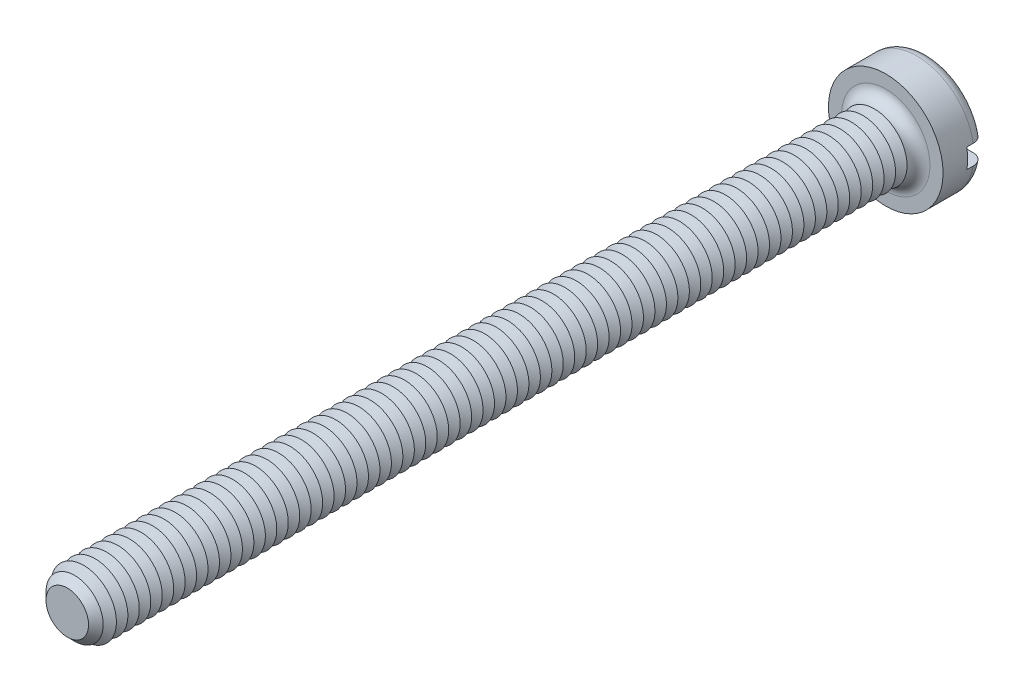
ISO-10303-21;
HEADER;
FILE_DESCRIPTION(('STEP AP214'),'2;1');
FILE_NAME('part.step','',(''),(''),'','','');
FILE_SCHEMA(('AUTOMOTIVE_DESIGN { 1 0 10303 214 1 1 1 1 }'));
ENDSEC;
DATA;
#1=APPLICATION_CONTEXT('core data for automotive mechanical design processes');
#2=APPLICATION_PROTOCOL_DEFINITION('international standard','automotive_design',2000,#1);
#3=PRODUCT_CONTEXT('',#1,'mechanical');
#4=PRODUCT('Part','Part','',(#3));
#5=PRODUCT_RELATED_PRODUCT_CATEGORY('part','',(#4));
#6=PRODUCT_DEFINITION_FORMATION('','',#4);
#7=PRODUCT_DEFINITION_CONTEXT('part definition',#1,'design');
#8=PRODUCT_DEFINITION('design','',#6,#7);
#9=PRODUCT_DEFINITION_SHAPE('','',#8);
#10=(LENGTH_UNIT() NAMED_UNIT(*) SI_UNIT(.MILLI.,.METRE.));
#11=(NAMED_UNIT(*) PLANE_ANGLE_UNIT() SI_UNIT($,.RADIAN.));
#12=(NAMED_UNIT(*) SI_UNIT($,.STERADIAN.) SOLID_ANGLE_UNIT());
#13=UNCERTAINTY_MEASURE_WITH_UNIT(LENGTH_MEASURE(1.E-05),#10,'distance_accuracy_value','');
#14=(GEOMETRIC_REPRESENTATION_CONTEXT(3) GLOBAL_UNCERTAINTY_ASSIGNED_CONTEXT((#13)) GLOBAL_UNIT_ASSIGNED_CONTEXT((#10,
#11,#12)) REPRESENTATION_CONTEXT('',''));
#15=CARTESIAN_POINT('',(0.,0.,0.));
#16=DIRECTION('',(0.,0.,1.));
#17=DIRECTION('',(1.,0.,0.));
#18=AXIS2_PLACEMENT_3D('',#15,#16,#17);
#19=CARTESIAN_POINT('',(0.,0.,-2.6));
#20=DIRECTION('',(0.,0.,1.));
#21=DIRECTION('',(1.,0.,0.));
#22=AXIS2_PLACEMENT_3D('',#19,#20,#21);
#23=PLANE('',#22);
#24=CARTESIAN_POINT('',(0.,0.,-2.6));
#25=DIRECTION('',(0.,0.,1.));
#26=DIRECTION('',(1.,0.,0.));
#27=AXIS2_PLACEMENT_3D('',#24,#25,#26);
#28=CIRCLE('',#27,2.8);
#29=CARTESIAN_POINT('',(-2.73495886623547,0.6,-2.6));
#30=VERTEX_POINT('',#29);
#31=CARTESIAN_POINT('',(2.73495886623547,0.6,-2.6));
#32=VERTEX_POINT('',#31);
#33=EDGE_CURVE('E116',#30,#32,#28,.F.);
#34=ORIENTED_EDGE('',*,*,#33,.T.);
#35=DIRECTION('',(1.,0.,0.));
#36=VECTOR('',#35,1.);
#37=CARTESIAN_POINT('',(-3.5,0.600000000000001,-2.6));
#38=LINE('',#37,#36);
#39=EDGE_CURVE('E111',#30,#32,#38,.T.);
#40=ORIENTED_EDGE('',*,*,#39,.F.);
#41=EDGE_LOOP('',(#34,#40));
#42=FACE_BOUND('',#41,.T.);
#43=ADVANCED_FACE('F39',(#42),#23,.F.);
#44=CARTESIAN_POINT('',(0.,0.,-1.9));
#45=DIRECTION('',(0.,0.,1.));
#46=DIRECTION('',(1.,0.,0.));
#47=AXIS2_PLACEMENT_3D('',#44,#45,#46);
#48=TOROIDAL_SURFACE('',#47,2.8,0.7);
#49=CARTESIAN_POINT('',(-3.24550494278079,0.600000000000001,-2.38938679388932));
#50=CARTESIAN_POINT('',(-3.21724139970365,0.600000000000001,-2.41780774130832));
#51=CARTESIAN_POINT('',(-3.18652103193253,0.600000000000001,-2.44383169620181));
#52=CARTESIAN_POINT('',(-3.12110229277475,0.600000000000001,-2.49034599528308));
#53=CARTESIAN_POINT('',(-3.08639834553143,0.6,-2.51082844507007));
#54=CARTESIAN_POINT('',(-3.01410013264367,0.6,-2.54568075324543));
#55=CARTESIAN_POINT('',(-2.97650963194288,0.6,-2.56005841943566));
#56=CARTESIAN_POINT('',(-2.89948250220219,0.6,-2.58239238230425));
#57=CARTESIAN_POINT('',(-2.86004633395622,0.6,-2.59035027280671));
#58=CARTESIAN_POINT('',(-2.77983715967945,0.6,-2.5997577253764));
#59=CARTESIAN_POINT('',(-2.73905311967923,0.6,-2.60111317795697));
#60=CARTESIAN_POINT('',(-2.65781876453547,0.6,-2.59706866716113));
#61=CARTESIAN_POINT('',(-2.61736849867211,0.6,-2.59166772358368));
#62=CARTESIAN_POINT('',(-2.53729983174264,0.6,-2.57414594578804));
#63=CARTESIAN_POINT('',(-2.49770360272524,0.6,-2.56192363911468));
#64=CARTESIAN_POINT('',(-2.421111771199,0.6,-2.5310238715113));
#65=CARTESIAN_POINT('',(-2.38411632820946,0.6,-2.51234601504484));
#66=CARTESIAN_POINT('',(-2.31371213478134,0.6,-2.46896762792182));
#67=CARTESIAN_POINT('',(-2.28031240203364,0.6,-2.44425244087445));
#68=CARTESIAN_POINT('',(-2.21823311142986,0.6,-2.38946667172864));
#69=CARTESIAN_POINT('',(-2.18955321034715,0.6,-2.35939647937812));
#70=CARTESIAN_POINT('',(-2.13836074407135,0.6,-2.29532787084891));
#71=CARTESIAN_POINT('',(-2.11574147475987,0.6,-2.26141482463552));
#72=CARTESIAN_POINT('',(-2.07677080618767,0.6,-2.19015935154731));
#73=CARTESIAN_POINT('',(-2.06041784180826,0.6,-2.15281778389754));
#74=CARTESIAN_POINT('',(-2.03508596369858,0.6,-2.07723332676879));
#75=CARTESIAN_POINT('',(-2.02585871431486,0.6,-2.03907365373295));
#76=CARTESIAN_POINT('',(-2.01416722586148,0.6,-1.96173417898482));
#77=CARTESIAN_POINT('',(-2.01170151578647,0.6,-1.92255460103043));
#78=CARTESIAN_POINT('',(-2.01359934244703,0.6,-1.84555709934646));
#79=CARTESIAN_POINT('',(-2.01775787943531,0.6,-1.80773393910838));
#80=CARTESIAN_POINT('',(-2.03236373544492,0.6,-1.73332511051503));
#81=CARTESIAN_POINT('',(-2.04281097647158,0.6,-1.69673942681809));
#82=CARTESIAN_POINT('',(-2.06962963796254,0.6,-1.62577336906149));
#83=CARTESIAN_POINT('',(-2.08600685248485,0.6,-1.59139519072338));
#84=CARTESIAN_POINT('',(-2.12413495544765,0.6,-1.52576356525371));
#85=CARTESIAN_POINT('',(-2.14588657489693,0.6,-1.49451054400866));
#86=CARTESIAN_POINT('',(-2.19483541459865,0.6,-1.43498643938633));
#87=CARTESIAN_POINT('',(-2.22217844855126,0.6,-1.40683532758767));
#88=CARTESIAN_POINT('',(-2.28105616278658,0.6,-1.35532544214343));
#89=CARTESIAN_POINT('',(-2.3125916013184,0.6,-1.33196753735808));
#90=CARTESIAN_POINT('',(-2.38018779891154,0.6,-1.28984356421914));
#91=CARTESIAN_POINT('',(-2.41637068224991,0.6,-1.27127330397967));
#92=CARTESIAN_POINT('',(-2.49129688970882,0.6,-1.24032971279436));
#93=CARTESIAN_POINT('',(-2.53004053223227,0.6,-1.22795715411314));
#94=CARTESIAN_POINT('',(-2.6098393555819,0.6,-1.2095515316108));
#95=CARTESIAN_POINT('',(-2.65092550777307,0.6,-1.20365237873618));
#96=CARTESIAN_POINT('',(-2.7335069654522,0.6,-1.1988380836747));
#97=CARTESIAN_POINT('',(-2.7750022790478,0.6,-1.19992308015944));
#98=CARTESIAN_POINT('',(-2.85718851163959,0.6,-1.20909046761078));
#99=CARTESIAN_POINT('',(-2.8978799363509,0.6,-1.21716830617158));
#100=CARTESIAN_POINT('',(-2.97729176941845,0.6,-1.24014327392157));
#101=CARTESIAN_POINT('',(-3.01601231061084,0.6,-1.25503994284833));
#102=CARTESIAN_POINT('',(-3.08976822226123,0.6,-1.29101066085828));
#103=CARTESIAN_POINT('',(-3.12484927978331,0.600000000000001,-1.31199098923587));
#104=CARTESIAN_POINT('',(-3.19090022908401,0.600000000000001,-1.35965144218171));
#105=CARTESIAN_POINT('',(-3.22187053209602,0.600000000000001,-1.38633099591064));
#106=CARTESIAN_POINT('',(-3.2781946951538,0.600000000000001,-1.44408564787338));
#107=CARTESIAN_POINT('',(-3.3036441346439,0.600000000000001,-1.47506754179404));
#108=CARTESIAN_POINT('',(-3.34887649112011,0.600000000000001,-1.54092398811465));
#109=CARTESIAN_POINT('',(-3.36865993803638,0.600000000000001,-1.57579817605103));
#110=CARTESIAN_POINT('',(-3.40166738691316,0.600000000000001,-1.64783067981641));
#111=CARTESIAN_POINT('',(-3.41499360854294,0.600000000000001,-1.68494217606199));
#112=CARTESIAN_POINT('',(-3.43515375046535,0.600000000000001,-1.76088675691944));
#113=CARTESIAN_POINT('',(-3.44198836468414,0.600000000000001,-1.79971965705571));
#114=CARTESIAN_POINT('',(-3.44891916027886,0.600000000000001,-1.87757893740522));
#115=CARTESIAN_POINT('',(-3.44908375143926,0.600000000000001,-1.91659924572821));
#116=CARTESIAN_POINT('',(-3.44284111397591,0.600000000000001,-1.99412088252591));
#117=CARTESIAN_POINT('',(-3.43643236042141,0.600000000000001,-2.03262208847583));
#118=CARTESIAN_POINT('',(-3.41725803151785,0.600000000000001,-2.10792315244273));
#119=CARTESIAN_POINT('',(-3.40450469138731,0.600000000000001,-2.14472613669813));
#120=CARTESIAN_POINT('',(-3.3730385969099,0.600000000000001,-2.21565060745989));
#121=CARTESIAN_POINT('',(-3.35433321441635,0.600000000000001,-2.24977534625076));
#122=CARTESIAN_POINT('',(-3.3201892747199,0.600000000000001,-2.30136364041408));
#123=CARTESIAN_POINT('',(-3.30647805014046,0.600000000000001,-2.31999402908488));
#124=CARTESIAN_POINT('',(-3.27728518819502,0.600000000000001,-2.35581090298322));
#125=CARTESIAN_POINT('',(-3.26180356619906,0.600000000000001,-2.37299740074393));
#126=CARTESIAN_POINT('',(-3.24550494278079,0.600000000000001,-2.38938679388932));
#127=B_SPLINE_CURVE_WITH_KNOTS('',3,(#49,#50,#51,#52,#53,#54,#55,#56,#57,#58,#59,#60,#61,#62,
#63,#64,#65,#66,#67,#68,#69,#70,#71,#72,#73,#74,#75,#76,#77,#78,#79,#80,#81,#82,#83,#84,#85,#86,
#87,#88,#89,#90,#91,#92,#93,#94,#95,#96,#97,#98,#99,#100,#101,#102,#103,#104,#105,#106,#107,
#108,#109,#110,#111,#112,#113,#114,#115,#116,#117,#118,#119,#120,#121,#122,#123,#124,#125,#126),
.UNSPECIFIED.,.T.,.F.,(4,2,2,2,2,2,2,2,2,2,2,2,2,2,2,2,2,2,2,2,2,2,2,2,2,2,2,2,2,2,2,2,2,2,2,2,
2,2,4),(0.,0.120160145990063,0.240490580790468,0.36066665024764,0.480812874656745,
0.602666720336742,0.724538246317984,0.848272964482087,0.972015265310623,1.09606100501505,
1.2200977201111,1.34178071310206,1.46343329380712,1.58062647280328,1.6977941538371,
1.81140573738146,1.92501591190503,2.03873739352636,2.15247435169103,2.26967910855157,
2.38690509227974,2.50835551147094,2.62982106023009,2.75375450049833,2.87769040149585,
3.00154567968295,3.12539259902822,3.24742469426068,3.36944457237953,3.48914477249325,
3.60883377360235,3.72656056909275,3.84427477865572,3.96078136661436,4.07731498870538,
4.19362474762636,4.3097910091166,4.37908387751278,4.44837614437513),.UNSPECIFIED.);
#128=CARTESIAN_POINT('',(-3.44818792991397,0.600000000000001,-1.8999999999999));
#129=VERTEX_POINT('',#128);
#130=EDGE_CURVE('E745',#129,#30,#127,.T.);
#131=ORIENTED_EDGE('',*,*,#130,.F.);
#132=CARTESIAN_POINT('',(0.,0.,-1.9));
#133=DIRECTION('',(0.,0.,1.));
#134=DIRECTION('',(1.,0.,0.));
#135=AXIS2_PLACEMENT_3D('',#132,#133,#134);
#136=CIRCLE('',#135,3.5);
#137=CARTESIAN_POINT('',(3.44818792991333,0.6,-1.9));
#138=VERTEX_POINT('',#137);
#139=EDGE_CURVE('E125',#138,#129,#136,.T.);
#140=ORIENTED_EDGE('',*,*,#139,.F.);
#141=CARTESIAN_POINT('',(2.1414268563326,0.6,-2.29762171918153));
#142=CARTESIAN_POINT('',(2.16505443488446,0.6,-2.33058245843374));
#143=CARTESIAN_POINT('',(2.19155609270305,0.6,-2.36152717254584));
#144=CARTESIAN_POINT('',(2.24942944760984,0.6,-2.41852964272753));
#145=CARTESIAN_POINT('',(2.28080921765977,0.6,-2.44457913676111));
#146=CARTESIAN_POINT('',(2.34741203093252,0.6,-2.49105381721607));
#147=CARTESIAN_POINT('',(2.38262862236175,0.6,-2.51148824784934));
#148=CARTESIAN_POINT('',(2.45593176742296,0.6,-2.54626881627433));
#149=CARTESIAN_POINT('',(2.49401741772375,0.6,-2.56061686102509));
#150=CARTESIAN_POINT('',(2.57272605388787,0.6,-2.58306429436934));
#151=CARTESIAN_POINT('',(2.6133821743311,0.6,-2.59104769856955));
#152=CARTESIAN_POINT('',(2.6954618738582,0.6,-2.60009608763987));
#153=CARTESIAN_POINT('',(2.73688552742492,0.6,-2.60116039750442));
#154=CARTESIAN_POINT('',(2.81941950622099,0.6,-2.5962925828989));
#155=CARTESIAN_POINT('',(2.86052888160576,0.6,-2.59034422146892));
#156=CARTESIAN_POINT('',(2.94113709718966,0.6,-2.57153687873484));
#157=CARTESIAN_POINT('',(2.98063603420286,0.6,-2.55867831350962));
#158=CARTESIAN_POINT('',(3.05633735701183,0.6,-2.52657771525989));
#159=CARTESIAN_POINT('',(3.09257627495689,0.6,-2.50742188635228));
#160=CARTESIAN_POINT('',(3.16123898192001,0.6,-2.46318606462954));
#161=CARTESIAN_POINT('',(3.19366316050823,0.6,-2.4381066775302));
#162=CARTESIAN_POINT('',(3.25312278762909,0.6,-2.38324481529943));
#163=CARTESIAN_POINT('',(3.28024842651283,0.6,-2.35356008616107));
#164=CARTESIAN_POINT('',(3.32902587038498,0.6,-2.28998971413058));
#165=CARTESIAN_POINT('',(3.35067820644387,0.6,-2.25610447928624));
#166=CARTESIAN_POINT('',(3.38751207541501,0.6,-2.18572286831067));
#167=CARTESIAN_POINT('',(3.40279804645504,0.6,-2.14928112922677));
#168=CARTESIAN_POINT('',(3.42695590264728,0.6,-2.07433042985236));
#169=CARTESIAN_POINT('',(3.43582824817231,0.6,-2.03582161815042));
#170=CARTESIAN_POINT('',(3.44682113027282,0.6,-1.95829536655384));
#171=CARTESIAN_POINT('',(3.44901648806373,0.6,-1.91928851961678));
#172=CARTESIAN_POINT('',(3.44680085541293,0.6,-1.84146366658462));
#173=CARTESIAN_POINT('',(3.44239008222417,0.6,-1.80264565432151));
#174=CARTESIAN_POINT('',(3.42712544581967,0.6,-1.72644634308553));
#175=CARTESIAN_POINT('',(3.41629508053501,0.6,-1.6890603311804));
#176=CARTESIAN_POINT('',(3.38853757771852,0.6,-1.61662604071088));
#177=CARTESIAN_POINT('',(3.37161039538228,0.6,-1.58157777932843));
#178=CARTESIAN_POINT('',(3.33207798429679,0.6,-1.51464178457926));
#179=CARTESIAN_POINT('',(3.30944854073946,0.6,-1.48276835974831));
#180=CARTESIAN_POINT('',(3.2592165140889,0.6,-1.42321861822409));
#181=CARTESIAN_POINT('',(3.23161370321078,0.6,-1.3955424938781));
#182=CARTESIAN_POINT('',(3.17188519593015,0.6,-1.34481834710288));
#183=CARTESIAN_POINT('',(3.13971065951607,0.6,-1.32182785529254));
#184=CARTESIAN_POINT('',(3.07201123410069,0.6,-1.28147003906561));
#185=CARTESIAN_POINT('',(3.03648608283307,0.6,-1.26410315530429));
#186=CARTESIAN_POINT('',(2.962449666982,0.6,-1.2351645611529));
#187=CARTESIAN_POINT('',(2.92389781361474,0.6,-1.22369671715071));
#188=CARTESIAN_POINT('',(2.84543273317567,0.6,-1.20726565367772));
#189=CARTESIAN_POINT('',(2.80551936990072,0.6,-1.20230308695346));
#190=CARTESIAN_POINT('',(2.72467191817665,0.6,-1.1989357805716));
#191=CARTESIAN_POINT('',(2.68373266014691,0.6,-1.20065484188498));
#192=CARTESIAN_POINT('',(2.60270222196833,0.6,-1.21084560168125));
#193=CARTESIAN_POINT('',(2.56261112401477,0.6,-1.21931795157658));
#194=CARTESIAN_POINT('',(2.48385954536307,0.6,-1.24292934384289));
#195=CARTESIAN_POINT('',(2.44522508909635,0.6,-1.25815531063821));
#196=CARTESIAN_POINT('',(2.37106165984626,0.6,-1.29488663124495));
#197=CARTESIAN_POINT('',(2.33553282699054,0.6,-1.31639226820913));
#198=CARTESIAN_POINT('',(2.2686996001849,0.6,-1.36507949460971));
#199=CARTESIAN_POINT('',(2.23738745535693,0.6,-1.39225042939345));
#200=CARTESIAN_POINT('',(2.17990424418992,0.6,-1.45157941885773));
#201=CARTESIAN_POINT('',(2.15373259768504,0.6,-1.48373691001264));
#202=CARTESIAN_POINT('',(2.10799355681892,0.6,-1.551327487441));
#203=CARTESIAN_POINT('',(2.08828258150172,0.6,-1.58666329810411));
#204=CARTESIAN_POINT('',(2.05534440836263,0.6,-1.66023600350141));
#205=CARTESIAN_POINT('',(2.042115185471,0.6,-1.6984719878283));
#206=CARTESIAN_POINT('',(2.02303126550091,0.6,-1.77519783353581));
#207=CARTESIAN_POINT('',(2.01691541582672,0.6,-1.8136228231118));
#208=CARTESIAN_POINT('',(2.01140375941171,0.6,-1.89096056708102));
#209=CARTESIAN_POINT('',(2.01200856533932,0.6,-1.92987336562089));
#210=CARTESIAN_POINT('',(2.01981617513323,0.6,-2.006065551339));
#211=CARTESIAN_POINT('',(2.02685835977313,0.6,-2.04336165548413));
#212=CARTESIAN_POINT('',(2.0470502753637,0.6,-2.1162250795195));
#213=CARTESIAN_POINT('',(2.06019252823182,0.6,-2.15179445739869));
#214=CARTESIAN_POINT('',(2.08525738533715,0.6,-2.20558874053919));
#215=CARTESIAN_POINT('',(2.09529161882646,0.6,-2.22471751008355));
#216=CARTESIAN_POINT('',(2.11708813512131,0.6,-2.26196179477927));
#217=CARTESIAN_POINT('',(2.12885034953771,0.6,-2.28007734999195));
#218=CARTESIAN_POINT('',(2.1414268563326,0.6,-2.29762171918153));
#219=B_SPLINE_CURVE_WITH_KNOTS('',3,(#141,#142,#143,#144,#145,#146,#147,#148,#149,#150,#151,
#152,#153,#154,#155,#156,#157,#158,#159,#160,#161,#162,#163,#164,#165,#166,#167,#168,#169,#170,
#171,#172,#173,#174,#175,#176,#177,#178,#179,#180,#181,#182,#183,#184,#185,#186,#187,#188,#189,
#190,#191,#192,#193,#194,#195,#196,#197,#198,#199,#200,#201,#202,#203,#204,#205,#206,#207,#208,
#209,#210,#211,#212,#213,#214,#215,#216,#217,#218),.UNSPECIFIED.,.T.,.F.,(4,2,2,2,2,2,2,2,2,2,2,
2,2,2,2,2,2,2,2,2,2,2,2,2,2,2,2,2,2,2,2,2,2,2,2,2,2,2,4),(0.,0.121582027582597,
0.243367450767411,0.364951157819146,0.486496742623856,0.610209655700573,0.733934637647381,
0.857946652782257,0.981951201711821,1.1043243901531,1.22668507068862,1.34673532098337,
1.46677391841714,1.58475736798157,1.70273234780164,1.81938035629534,1.93602452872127,
2.05224435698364,2.168465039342,2.28518782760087,2.40191596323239,2.52000081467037,
2.63809491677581,2.75820270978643,2.87832255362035,3.00067856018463,3.1230463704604,
3.24703703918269,3.37103329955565,3.49479843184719,3.6185495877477,3.73932715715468,
3.86006696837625,3.9762182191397,4.09238005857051,4.2057203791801,4.31892212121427,
4.38364046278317,4.44835624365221),.UNSPECIFIED.);
#220=EDGE_CURVE('E747',#32,#138,#219,.T.);
#221=ORIENTED_EDGE('',*,*,#220,.F.);
#222=ORIENTED_EDGE('',*,*,#33,.F.);
#223=EDGE_LOOP('',(#131,#140,#221,#222));
#224=FACE_BOUND('',#223,.T.);
#225=ADVANCED_FACE('F729',(#224),#48,.T.);
#226=CARTESIAN_POINT('',(0.,0.,-2.6));
#227=DIRECTION('',(0.,0.,1.));
#228=DIRECTION('',(1.,0.,0.));
#229=AXIS2_PLACEMENT_3D('',#226,#227,#228);
#230=CYLINDRICAL_SURFACE('',#229,3.5);
#231=DIRECTION('',(0.,0.,1.));
#232=VECTOR('',#231,1.);
#233=CARTESIAN_POINT('',(3.44818792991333,0.6,-2.6));
#234=LINE('',#233,#232);
#235=CARTESIAN_POINT('',(3.44818792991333,0.6,-1.5));
#236=VERTEX_POINT('',#235);
#237=EDGE_CURVE('E762',#138,#236,#234,.T.);
#238=ORIENTED_EDGE('',*,*,#237,.F.);
#239=ORIENTED_EDGE('',*,*,#139,.T.);
#240=DIRECTION('',(0.,0.,1.));
#241=VECTOR('',#240,1.);
#242=CARTESIAN_POINT('',(-3.44818792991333,0.600000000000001,-2.6));
#243=LINE('',#242,#241);
#244=CARTESIAN_POINT('',(-3.44818792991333,0.600000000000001,-1.5));
#245=VERTEX_POINT('',#244);
#246=EDGE_CURVE('E63',#245,#129,#243,.F.);
#247=ORIENTED_EDGE('',*,*,#246,.F.);
#248=CARTESIAN_POINT('',(0.,0.,-1.5));
#249=DIRECTION('',(0.,0.,-1.));
#250=DIRECTION('',(-1.,0.,0.));
#251=AXIS2_PLACEMENT_3D('',#248,#249,#250);
#252=CIRCLE('',#251,3.5);
#253=CARTESIAN_POINT('',(-3.44818792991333,-0.599999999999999,-1.5));
#254=VERTEX_POINT('',#253);
#255=EDGE_CURVE('E43',#245,#254,#252,.F.);
#256=ORIENTED_EDGE('',*,*,#255,.T.);
#257=DIRECTION('',(0.,0.,1.));
#258=VECTOR('',#257,1.);
#259=CARTESIAN_POINT('',(-3.44818792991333,-0.599999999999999,-2.6));
#260=LINE('',#259,#258);
#261=CARTESIAN_POINT('',(-3.44818792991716,-0.599999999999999,-1.90000000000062));
#262=VERTEX_POINT('',#261);
#263=EDGE_CURVE('E759',#262,#254,#260,.T.);
#264=ORIENTED_EDGE('',*,*,#263,.F.);
#265=CARTESIAN_POINT('',(3.44818792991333,-0.6,-1.9));
#266=VERTEX_POINT('',#265);
#267=EDGE_CURVE('E127',#262,#266,#136,.T.);
#268=ORIENTED_EDGE('',*,*,#267,.T.);
#269=DIRECTION('',(0.,0.,1.));
#270=VECTOR('',#269,1.);
#271=CARTESIAN_POINT('',(3.44818792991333,-0.6,-2.6));
#272=LINE('',#271,#270);
#273=CARTESIAN_POINT('',(3.44818792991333,-0.6,-1.5));
#274=VERTEX_POINT('',#273);
#275=EDGE_CURVE('E55',#274,#266,#272,.F.);
#276=ORIENTED_EDGE('',*,*,#275,.F.);
#277=EDGE_CURVE('E11',#274,#236,#252,.F.);
#278=ORIENTED_EDGE('',*,*,#277,.T.);
#279=EDGE_LOOP('',(#238,#239,#247,#256,#264,#268,#276,#278));
#280=FACE_BOUND('',#279,.T.);
#281=CARTESIAN_POINT('',(0.,0.,0.));
#282=DIRECTION('',(0.,0.,1.));
#283=DIRECTION('',(1.,0.,0.));
#284=AXIS2_PLACEMENT_3D('',#281,#282,#283);
#285=CIRCLE('',#284,3.5);
#286=CARTESIAN_POINT('',(3.5,0.,0.));
#287=VERTEX_POINT('',#286);
#288=EDGE_CURVE('E765',#287,#287,#285,.T.);
#289=ORIENTED_EDGE('',*,*,#288,.F.);
#290=EDGE_LOOP('',(#289));
#291=FACE_BOUND('',#290,.T.);
#292=ADVANCED_FACE('F725',(#280,#291),#230,.T.);
#293=CARTESIAN_POINT('',(2.73495886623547,-0.6,-2.6));
#294=VERTEX_POINT('',#293);
#295=CARTESIAN_POINT('',(-2.73495886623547,-0.6,-2.6));
#296=VERTEX_POINT('',#295);
#297=EDGE_CURVE('E109',#294,#296,#28,.F.);
#298=ORIENTED_EDGE('',*,*,#297,.T.);
#299=DIRECTION('',(-1.,0.,0.));
#300=VECTOR('',#299,1.);
#301=CARTESIAN_POINT('',(-3.5,-0.599999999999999,-2.6));
#302=LINE('',#301,#300);
#303=EDGE_CURVE('E96',#294,#296,#302,.T.);
#304=ORIENTED_EDGE('',*,*,#303,.F.);
#305=EDGE_LOOP('',(#298,#304));
#306=FACE_BOUND('',#305,.T.);
#307=ADVANCED_FACE('F108',(#306),#23,.F.);
#308=CARTESIAN_POINT('',(0.,0.,0.));
#309=DIRECTION('',(0.,0.,1.));
#310=DIRECTION('',(1.,0.,0.));
#311=AXIS2_PLACEMENT_3D('',#308,#309,#310);
#312=PLANE('',#311);
#313=CARTESIAN_POINT('',(0.,0.,0.));
#314=DIRECTION('',(0.,0.,1.));
#315=DIRECTION('',(1.,0.,0.));
#316=AXIS2_PLACEMENT_3D('',#313,#314,#315);
#317=CIRCLE('',#316,2.7);
#318=CARTESIAN_POINT('',(2.7,0.,0.));
#319=VERTEX_POINT('',#318);
#320=EDGE_CURVE('E115',#319,#319,#317,.F.);
#321=ORIENTED_EDGE('',*,*,#320,.T.);
#322=EDGE_LOOP('',(#321));
#323=FACE_BOUND('',#322,.T.);
#324=ORIENTED_EDGE('',*,*,#288,.T.);
#325=EDGE_LOOP('',(#324));
#326=FACE_BOUND('',#325,.T.);
#327=ADVANCED_FACE('F724',(#323,#326),#312,.T.);
#328=CARTESIAN_POINT('',(-3.24550494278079,-0.599999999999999,-2.38938679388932));
#329=CARTESIAN_POINT('',(-3.27309693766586,-0.599999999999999,-2.36163611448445));
#330=CARTESIAN_POINT('',(-3.29838741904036,-0.599999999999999,-2.3315608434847));
#331=CARTESIAN_POINT('',(-3.34359429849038,-0.599999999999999,-2.26757659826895));
#332=CARTESIAN_POINT('',(-3.36350518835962,-0.599999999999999,-2.23366374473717));
#333=CARTESIAN_POINT('',(-3.39733065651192,-0.599999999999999,-2.16296274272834));
#334=CARTESIAN_POINT('',(-3.4112451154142,-0.599999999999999,-2.12617453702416));
#335=CARTESIAN_POINT('',(-3.43264462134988,-0.599999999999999,-2.05078178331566));
#336=CARTESIAN_POINT('',(-3.44013114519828,-0.599999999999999,-2.01217765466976));
#337=CARTESIAN_POINT('',(-3.44841975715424,-0.599999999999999,-1.9345391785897));
#338=CARTESIAN_POINT('',(-3.44926944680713,-0.599999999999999,-1.89550990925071));
#339=CARTESIAN_POINT('',(-3.44438358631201,-0.599999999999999,-1.81786552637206));
#340=CARTESIAN_POINT('',(-3.43864801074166,-0.599999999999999,-1.77925041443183));
#341=CARTESIAN_POINT('',(-3.42079221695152,-0.599999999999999,-1.70364264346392));
#342=CARTESIAN_POINT('',(-3.40869011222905,-0.599999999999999,-1.66664570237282));
#343=CARTESIAN_POINT('',(-3.37847692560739,-0.599999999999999,-1.59519424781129));
#344=CARTESIAN_POINT('',(-3.3603657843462,-0.599999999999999,-1.56073975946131));
#345=CARTESIAN_POINT('',(-3.31856549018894,-0.599999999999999,-1.4951524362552));
#346=CARTESIAN_POINT('',(-3.29484830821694,-0.599999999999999,-1.46403747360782));
#347=CARTESIAN_POINT('',(-3.24258489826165,-0.599999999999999,-1.40617131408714));
#348=CARTESIAN_POINT('',(-3.21403843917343,-0.599999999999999,-1.37942032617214));
#349=CARTESIAN_POINT('',(-3.15256084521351,-0.599999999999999,-1.33067963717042));
#350=CARTESIAN_POINT('',(-3.11958015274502,-0.599999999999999,-1.30875246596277));
#351=CARTESIAN_POINT('',(-3.0504559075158,-0.599999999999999,-1.27063718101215));
#352=CARTESIAN_POINT('',(-3.01431209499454,-0.6,-1.25444953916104));
#353=CARTESIAN_POINT('',(-2.93921710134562,-0.6,-1.22796796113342));
#354=CARTESIAN_POINT('',(-2.90022796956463,-0.6,-1.217781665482));
#355=CARTESIAN_POINT('',(-2.82110512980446,-0.6,-1.20396915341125));
#356=CARTESIAN_POINT('',(-2.7809713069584,-0.6,-1.2003435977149));
#357=CARTESIAN_POINT('',(-2.69990924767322,-0.6,-1.19969717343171));
#358=CARTESIAN_POINT('',(-2.65898001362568,-0.6,-1.20279937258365));
#359=CARTESIAN_POINT('',(-2.57819986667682,-0.6,-1.21574287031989));
#360=CARTESIAN_POINT('',(-2.53834905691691,-0.6,-1.22558481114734));
#361=CARTESIAN_POINT('',(-2.46035232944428,-0.6,-1.25189361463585));
#362=CARTESIAN_POINT('',(-2.42223314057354,-0.6,-1.2684398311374));
#363=CARTESIAN_POINT('',(-2.34932316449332,-0.6,-1.30771928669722));
#364=CARTESIAN_POINT('',(-2.31453248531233,-0.6,-1.33045272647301));
#365=CARTESIAN_POINT('',(-2.24945577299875,-0.6,-1.38141543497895));
#366=CARTESIAN_POINT('',(-2.21915255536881,-0.6,-1.40962272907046));
#367=CARTESIAN_POINT('',(-2.16386461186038,-0.6,-1.47084552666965));
#368=CARTESIAN_POINT('',(-2.13887916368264,-0.6,-1.50386037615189));
#369=CARTESIAN_POINT('',(-2.09568071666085,-0.6,-1.57285917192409));
#370=CARTESIAN_POINT('',(-2.07730739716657,-0.6,-1.60874263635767));
#371=CARTESIAN_POINT('',(-2.04712019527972,-0.6,-1.68316975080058));
#372=CARTESIAN_POINT('',(-2.03530452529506,-0.6,-1.72171267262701));
#373=CARTESIAN_POINT('',(-2.01901751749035,-0.6,-1.79878952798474));
#374=CARTESIAN_POINT('',(-2.01428434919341,-0.6,-1.8372682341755));
#375=CARTESIAN_POINT('',(-2.01150652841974,-0.6,-1.91446369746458));
#376=CARTESIAN_POINT('',(-2.01346084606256,-0.6,-1.95318041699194));
#377=CARTESIAN_POINT('',(-2.02386268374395,-0.6,-2.0288619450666));
#378=CARTESIAN_POINT('',(-2.03216724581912,-0.6,-2.06584654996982));
#379=CARTESIAN_POINT('',(-2.05479337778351,-0.6,-2.13792373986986));
#380=CARTESIAN_POINT('',(-2.06911522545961,-0.6,-2.1730162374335));
#381=CARTESIAN_POINT('',(-2.10349906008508,-0.6,-2.24081034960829));
#382=CARTESIAN_POINT('',(-2.12363007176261,-0.6,-2.27347689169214));
#383=CARTESIAN_POINT('',(-2.16891308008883,-0.6,-2.33511902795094));
#384=CARTESIAN_POINT('',(-2.19406590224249,-0.6,-2.36409401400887));
#385=CARTESIAN_POINT('',(-2.24962389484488,-0.6,-2.41861972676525));
#386=CARTESIAN_POINT('',(-2.28018314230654,-0.6,-2.44401345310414));
#387=CARTESIAN_POINT('',(-2.34501720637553,-0.6,-2.48950558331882));
#388=CARTESIAN_POINT('',(-2.37929266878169,-0.6,-2.50960306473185));
#389=CARTESIAN_POINT('',(-2.45179417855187,-0.6,-2.54458276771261));
#390=CARTESIAN_POINT('',(-2.49011248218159,-0.6,-2.55927401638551));
#391=CARTESIAN_POINT('',(-2.56865227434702,-0.6,-2.58211133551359));
#392=CARTESIAN_POINT('',(-2.60887386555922,-0.6,-2.59025705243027));
#393=CARTESIAN_POINT('',(-2.69064746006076,-0.6,-2.59982905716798));
#394=CARTESIAN_POINT('',(-2.73220999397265,-0.6,-2.60116580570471));
#395=CARTESIAN_POINT('',(-2.81497658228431,-0.6,-2.59679700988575));
#396=CARTESIAN_POINT('',(-2.85618055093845,-0.6,-2.59108982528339));
#397=CARTESIAN_POINT('',(-2.93677683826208,-0.6,-2.57279487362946));
#398=CARTESIAN_POINT('',(-2.97617834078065,-0.6,-2.56024753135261));
#399=CARTESIAN_POINT('',(-3.05222242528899,-0.6,-2.52860709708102));
#400=CARTESIAN_POINT('',(-3.08886850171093,-0.599999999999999,-2.50952247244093));
#401=CARTESIAN_POINT('',(-3.14562501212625,-0.599999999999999,-2.47340693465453));
#402=CARTESIAN_POINT('',(-3.16689358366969,-0.599999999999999,-2.45816337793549));
#403=CARTESIAN_POINT('',(-3.20761866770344,-0.599999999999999,-2.42542115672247));
#404=CARTESIAN_POINT('',(-3.22707520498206,-0.599999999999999,-2.40792252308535));
#405=CARTESIAN_POINT('',(-3.24550494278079,-0.599999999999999,-2.38938679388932));
#406=B_SPLINE_CURVE_WITH_KNOTS('',3,(#328,#329,#330,#331,#332,#333,#334,#335,#336,#337,#338,
#339,#340,#341,#342,#343,#344,#345,#346,#347,#348,#349,#350,#351,#352,#353,#354,#355,#356,#357,
#358,#359,#360,#361,#362,#363,#364,#365,#366,#367,#368,#369,#370,#371,#372,#373,#374,#375,#376,
#377,#378,#379,#380,#381,#382,#383,#384,#385,#386,#387,#388,#389,#390,#391,#392,#393,#394,#395,
#396,#397,#398,#399,#400,#401,#402,#403,#404,#405),.UNSPECIFIED.,.T.,.F.,(4,2,2,2,2,2,2,2,2,2,2,
2,2,2,2,2,2,2,2,2,2,2,2,2,2,2,2,2,2,2,2,2,2,2,2,2,2,2,4),(0.,0.117306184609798,
0.234732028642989,0.352160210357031,0.469561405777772,0.586119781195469,0.702678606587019,
0.818907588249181,0.935137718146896,1.05196174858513,1.1687913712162,1.2870562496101,
1.40533084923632,1.52566688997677,1.64601504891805,1.76858322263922,1.89116307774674,
2.01523830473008,2.13931755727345,2.26290863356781,2.38648291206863,2.50681878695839,
2.62712184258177,2.74285697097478,2.85857427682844,2.97176054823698,3.08495204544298,
3.19954814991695,3.31416310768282,3.43282436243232,3.55150627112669,3.67404987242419,
3.79660009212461,3.92075778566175,4.04494439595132,4.16840490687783,4.29170610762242,
4.3700604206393,4.44841366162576),.UNSPECIFIED.);
#407=EDGE_CURVE('E103',#296,#262,#406,.T.);
#408=ORIENTED_EDGE('',*,*,#407,.F.);
#409=ORIENTED_EDGE('',*,*,#297,.F.);
#410=CARTESIAN_POINT('',(2.1414268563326,-0.6,-2.29762171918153));
#411=CARTESIAN_POINT('',(2.11900044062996,-0.6,-2.26633119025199));
#412=CARTESIAN_POINT('',(2.09913154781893,-0.6,-2.23318080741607));
#413=CARTESIAN_POINT('',(2.06517900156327,-0.6,-2.16401111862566));
#414=CARTESIAN_POINT('',(2.05109968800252,-0.6,-2.12798968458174));
#415=CARTESIAN_POINT('',(2.02923593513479,-0.6,-2.05404277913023));
#416=CARTESIAN_POINT('',(2.02145692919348,-0.6,-2.01611569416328));
#417=CARTESIAN_POINT('',(2.01251710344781,-0.6,-1.93949649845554));
#418=CARTESIAN_POINT('',(2.01135461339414,-0.6,-1.90080458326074));
#419=CARTESIAN_POINT('',(2.01564803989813,-0.6,-1.82450508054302));
#420=CARTESIAN_POINT('',(2.02098305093,-0.6,-1.78689061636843));
#421=CARTESIAN_POINT('',(2.03786826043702,-0.6,-1.71308589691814));
#422=CARTESIAN_POINT('',(2.04941870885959,-0.6,-1.67689569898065));
#423=CARTESIAN_POINT('',(2.07838664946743,-0.6,-1.60676639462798));
#424=CARTESIAN_POINT('',(2.09582944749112,-0.6,-1.57283776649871));
#425=CARTESIAN_POINT('',(2.1359925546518,-0.6,-1.50826612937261));
#426=CARTESIAN_POINT('',(2.15871360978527,-0.6,-1.47762358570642));
#427=CARTESIAN_POINT('',(2.20955413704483,-0.6,-1.41943384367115));
#428=CARTESIAN_POINT('',(2.23782364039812,-0.6,-1.39201777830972));
#429=CARTESIAN_POINT('',(2.29842612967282,-0.6,-1.34212199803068));
#430=CARTESIAN_POINT('',(2.33075984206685,-0.6,-1.31964316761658));
#431=CARTESIAN_POINT('',(2.399806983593,-0.6,-1.27945238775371));
#432=CARTESIAN_POINT('',(2.43663466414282,-0.6,-1.26193653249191));
#433=CARTESIAN_POINT('',(2.51267241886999,-0.6,-1.23320660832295));
#434=CARTESIAN_POINT('',(2.55188277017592,-0.6,-1.22199327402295));
#435=CARTESIAN_POINT('',(2.63235000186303,-0.6,-1.20602688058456));
#436=CARTESIAN_POINT('',(2.673631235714,-0.6,-1.20139617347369));
#437=CARTESIAN_POINT('',(2.7563863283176,-0.6,-1.19914622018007));
#438=CARTESIAN_POINT('',(2.79786018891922,-0.6,-1.20152704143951));
#439=CARTESIAN_POINT('',(2.87971192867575,-0.6,-1.21326884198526));
#440=CARTESIAN_POINT('',(2.92009214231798,-0.6,-1.22261349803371));
#441=CARTESIAN_POINT('',(2.99866777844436,-0.6,-1.24805614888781));
#442=CARTESIAN_POINT('',(3.03686335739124,-0.6,-1.26415365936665));
#443=CARTESIAN_POINT('',(3.10934738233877,-0.6,-1.3023912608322));
#444=CARTESIAN_POINT('',(3.14368704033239,-0.6,-1.32443423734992));
#445=CARTESIAN_POINT('',(3.20808395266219,-0.6,-1.37407725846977));
#446=CARTESIAN_POINT('',(3.23814164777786,-0.6,-1.40167673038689));
#447=CARTESIAN_POINT('',(3.29251534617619,-0.6,-1.46108303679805));
#448=CARTESIAN_POINT('',(3.3169296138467,-0.6,-1.49279994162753));
#449=CARTESIAN_POINT('',(3.35998418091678,-0.6,-1.55993706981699));
#450=CARTESIAN_POINT('',(3.37862502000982,-0.6,-1.59535694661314));
#451=CARTESIAN_POINT('',(3.40930212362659,-0.6,-1.668283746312));
#452=CARTESIAN_POINT('',(3.42143897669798,-0.6,-1.70574837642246));
#453=CARTESIAN_POINT('',(3.43918305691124,-0.6,-1.78219297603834));
#454=CARTESIAN_POINT('',(3.44479069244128,-0.6,-1.82117285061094));
#455=CARTESIAN_POINT('',(3.44928173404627,-0.6,-1.89914596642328));
#456=CARTESIAN_POINT('',(3.44822835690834,-0.6,-1.93813558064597));
#457=CARTESIAN_POINT('',(3.43957811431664,-0.6,-2.0153811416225));
#458=CARTESIAN_POINT('',(3.43198139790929,-0.6,-2.05363710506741));
#459=CARTESIAN_POINT('',(3.41049386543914,-0.6,-2.12826741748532));
#460=CARTESIAN_POINT('',(3.39661362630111,-0.6,-2.16464481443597));
#461=CARTESIAN_POINT('',(3.36297924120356,-0.6,-2.23457274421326));
#462=CARTESIAN_POINT('',(3.34322499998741,-0.6,-2.26812323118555));
#463=CARTESIAN_POINT('',(3.29828706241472,-0.6,-2.33167864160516));
#464=CARTESIAN_POINT('',(3.27307040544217,-0.6,-2.36166024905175));
#465=CARTESIAN_POINT('',(3.21802069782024,-0.6,-2.41703165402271));
#466=CARTESIAN_POINT('',(3.18818738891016,-0.6,-2.44242119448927));
#467=CARTESIAN_POINT('',(3.12433871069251,-0.6,-2.48825551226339));
#468=CARTESIAN_POINT('',(3.09027338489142,-0.6,-2.50863067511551));
#469=CARTESIAN_POINT('',(3.01925175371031,-0.6,-2.54348754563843));
#470=CARTESIAN_POINT('',(2.982295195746,-0.6,-2.55796873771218));
#471=CARTESIAN_POINT('',(2.90583499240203,-0.6,-2.58090526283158));
#472=CARTESIAN_POINT('',(2.86629758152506,-0.6,-2.58924801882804));
#473=CARTESIAN_POINT('',(2.78639041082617,-0.6,-2.59930573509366));
#474=CARTESIAN_POINT('',(2.7460205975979,-0.6,-2.60102026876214));
#475=CARTESIAN_POINT('',(2.66482039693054,-0.6,-2.59779078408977));
#476=CARTESIAN_POINT('',(2.62399477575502,-0.6,-2.59272651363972));
#477=CARTESIAN_POINT('',(2.54373809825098,-0.6,-2.57588976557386));
#478=CARTESIAN_POINT('',(2.50430750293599,-0.6,-2.56411509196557));
#479=CARTESIAN_POINT('',(2.42753167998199,-0.6,-2.53401488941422));
#480=CARTESIAN_POINT('',(2.39021407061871,-0.6,-2.51561892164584));
#481=CARTESIAN_POINT('',(2.31925431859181,-0.6,-2.4727929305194));
#482=CARTESIAN_POINT('',(2.28560806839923,-0.6,-2.44836975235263));
#483=CARTESIAN_POINT('',(2.23316677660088,-0.6,-2.40295212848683));
#484=CARTESIAN_POINT('',(2.21309339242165,-0.6,-2.38341311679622));
#485=CARTESIAN_POINT('',(2.17537212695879,-0.6,-2.34211733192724));
#486=CARTESIAN_POINT('',(2.1577241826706,-0.6,-2.32036061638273));
#487=CARTESIAN_POINT('',(2.1414268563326,-0.6,-2.29762171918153));
#488=B_SPLINE_CURVE_WITH_KNOTS('',3,(#410,#411,#412,#413,#414,#415,#416,#417,#418,#419,#420,
#421,#422,#423,#424,#425,#426,#427,#428,#429,#430,#431,#432,#433,#434,#435,#436,#437,#438,#439,
#440,#441,#442,#443,#444,#445,#446,#447,#448,#449,#450,#451,#452,#453,#454,#455,#456,#457,#458,
#459,#460,#461,#462,#463,#464,#465,#466,#467,#468,#469,#470,#471,#472,#473,#474,#475,#476,#477,
#478,#479,#480,#481,#482,#483,#484,#485,#486,#487),.UNSPECIFIED.,.T.,.F.,(4,2,2,2,2,2,2,2,2,2,2,
2,2,2,2,2,2,2,2,2,2,2,2,2,2,2,2,2,2,2,2,2,2,2,2,2,2,2,4),(0.,0.115394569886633,
0.230875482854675,0.346455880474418,0.462007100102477,0.575440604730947,0.688878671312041,
0.802810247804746,0.91675793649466,1.03436780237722,1.15199872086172,1.27377854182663,
1.39557255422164,1.51960202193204,1.64363268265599,1.76737352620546,1.89110549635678,
2.01292743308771,2.13473682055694,2.25423121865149,2.37371444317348,2.49129215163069,
2.60886250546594,2.72531873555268,2.8417723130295,2.95803059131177,3.07429075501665,
3.19127301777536,3.30826182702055,3.42679321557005,3.54533497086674,3.66599996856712,
3.78667273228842,3.90951478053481,4.03239705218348,4.15662720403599,4.28071691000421,
4.36457658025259,4.44843407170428),.UNSPECIFIED.);
#489=EDGE_CURVE('E92',#266,#294,#488,.T.);
#490=ORIENTED_EDGE('',*,*,#489,.F.);
#491=ORIENTED_EDGE('',*,*,#267,.F.);
#492=EDGE_LOOP('',(#408,#409,#490,#491));
#493=FACE_BOUND('',#492,.T.);
#494=ADVANCED_FACE('F113',(#493),#48,.T.);
#495=CARTESIAN_POINT('',(0.,0.,0.699999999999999));
#496=DIRECTION('',(0.,0.,1.));
#497=DIRECTION('',(1.,0.,0.));
#498=AXIS2_PLACEMENT_3D('',#495,#496,#497);
#499=TOROIDAL_SURFACE('',#498,2.7,0.7);
#500=ORIENTED_EDGE('',*,*,#320,.F.);
#501=EDGE_LOOP('',(#500));
#502=FACE_BOUND('',#501,.T.);
#503=CARTESIAN_POINT('',(0.,0.,0.700000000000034));
#504=DIRECTION('',(0.,0.,-1.));
#505=DIRECTION('',(-1.,0.,0.));
#506=AXIS2_PLACEMENT_3D('',#503,#504,#505);
#507=CIRCLE('',#506,2.);
#508=CARTESIAN_POINT('',(-2.,0.,0.700000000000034));
#509=VERTEX_POINT('',#508);
#510=EDGE_CURVE('E771',#509,#509,#507,.T.);
#511=ORIENTED_EDGE('',*,*,#510,.T.);
#512=EDGE_LOOP('',(#511));
#513=FACE_BOUND('',#512,.T.);
#514=ADVANCED_FACE('F717',(#502,#513),#499,.F.);
#515=CARTESIAN_POINT('',(0.,0.,1.05000000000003));
#516=DIRECTION('',(0.,0.,-1.));
#517=DIRECTION('',(-1.,0.,0.));
#518=AXIS2_PLACEMENT_3D('',#515,#516,#517);
#519=CONICAL_SURFACE('',#518,1.39378221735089,1.0471975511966);
#520=ORIENTED_EDGE('',*,*,#510,.F.);
#521=EDGE_LOOP('',(#520));
#522=FACE_BOUND('',#521,.T.);
#523=CARTESIAN_POINT('',(0.,0.,1.05000000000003));
#524=DIRECTION('',(0.,0.,-1.));
#525=DIRECTION('',(-1.,0.,0.));
#526=AXIS2_PLACEMENT_3D('',#523,#524,#525);
#527=CIRCLE('',#526,1.39378221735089);
#528=CARTESIAN_POINT('',(-1.39378221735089,0.,1.05000000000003));
#529=VERTEX_POINT('',#528);
#530=EDGE_CURVE('E777',#529,#529,#527,.T.);
#531=ORIENTED_EDGE('',*,*,#530,.T.);
#532=EDGE_LOOP('',(#531));
#533=FACE_BOUND('',#532,.T.);
#534=ADVANCED_FACE('F713',(#522,#533),#519,.T.);
#535=CARTESIAN_POINT('',(0.,0.,1.40000000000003));
#536=DIRECTION('',(0.,0.,1.));
#537=DIRECTION('',(1.,0.,0.));
#538=AXIS2_PLACEMENT_3D('',#535,#536,#537);
#539=CONICAL_SURFACE('',#538,2.,1.0471975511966);
#540=ORIENTED_EDGE('',*,*,#530,.F.);
#541=EDGE_LOOP('',(#540));
#542=FACE_BOUND('',#541,.T.);
#543=CARTESIAN_POINT('',(0.,0.,1.40000000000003));
#544=DIRECTION('',(0.,0.,-1.));
#545=DIRECTION('',(-1.,0.,0.));
#546=AXIS2_PLACEMENT_3D('',#543,#544,#545);
#547=CIRCLE('',#546,2.);
#548=CARTESIAN_POINT('',(-2.,0.,1.40000000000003));
#549=VERTEX_POINT('',#548);
#550=EDGE_CURVE('E783',#549,#549,#547,.T.);
#551=ORIENTED_EDGE('',*,*,#550,.T.);
#552=EDGE_LOOP('',(#551));
#553=FACE_BOUND('',#552,.T.);
#554=ADVANCED_FACE('F709',(#542,#553),#539,.T.);
#555=CARTESIAN_POINT('',(0.,0.,1.75000000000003));
#556=DIRECTION('',(0.,0.,-1.));
#557=DIRECTION('',(-1.,0.,0.));
#558=AXIS2_PLACEMENT_3D('',#555,#556,#557);
#559=CONICAL_SURFACE('',#558,1.39378221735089,1.0471975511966);
#560=ORIENTED_EDGE('',*,*,#550,.F.);
#561=EDGE_LOOP('',(#560));
#562=FACE_BOUND('',#561,.T.);
#563=CARTESIAN_POINT('',(0.,0.,1.75000000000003));
#564=DIRECTION('',(0.,0.,-1.));
#565=DIRECTION('',(-1.,0.,0.));
#566=AXIS2_PLACEMENT_3D('',#563,#564,#565);
#567=CIRCLE('',#566,1.39378221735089);
#568=CARTESIAN_POINT('',(-1.39378221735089,0.,1.75000000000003));
#569=VERTEX_POINT('',#568);
#570=EDGE_CURVE('E787',#569,#569,#567,.T.);
#571=ORIENTED_EDGE('',*,*,#570,.T.);
#572=EDGE_LOOP('',(#571));
#573=FACE_BOUND('',#572,.T.);
#574=ADVANCED_FACE('F705',(#562,#573),#559,.T.);
#575=CARTESIAN_POINT('',(0.,0.,2.10000000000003));
#576=DIRECTION('',(0.,0.,1.));
#577=DIRECTION('',(1.,0.,0.));
#578=AXIS2_PLACEMENT_3D('',#575,#576,#577);
#579=CONICAL_SURFACE('',#578,2.,1.0471975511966);
#580=ORIENTED_EDGE('',*,*,#570,.F.);
#581=EDGE_LOOP('',(#580));
#582=FACE_BOUND('',#581,.T.);
#583=CARTESIAN_POINT('',(0.,0.,2.10000000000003));
#584=DIRECTION('',(0.,0.,-1.));
#585=DIRECTION('',(-1.,0.,0.));
#586=AXIS2_PLACEMENT_3D('',#583,#584,#585);
#587=CIRCLE('',#586,2.);
#588=CARTESIAN_POINT('',(-2.,0.,2.10000000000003));
#589=VERTEX_POINT('',#588);
#590=EDGE_CURVE('E791',#589,#589,#587,.T.);
#591=ORIENTED_EDGE('',*,*,#590,.T.);
#592=EDGE_LOOP('',(#591));
#593=FACE_BOUND('',#592,.T.);
#594=ADVANCED_FACE('F701',(#582,#593),#579,.T.);
#595=CARTESIAN_POINT('',(0.,0.,2.45000000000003));
#596=DIRECTION('',(0.,0.,-1.));
#597=DIRECTION('',(-1.,0.,0.));
#598=AXIS2_PLACEMENT_3D('',#595,#596,#597);
#599=CONICAL_SURFACE('',#598,1.39378221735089,1.0471975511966);
#600=ORIENTED_EDGE('',*,*,#590,.F.);
#601=EDGE_LOOP('',(#600));
#602=FACE_BOUND('',#601,.T.);
#603=CARTESIAN_POINT('',(0.,0.,2.45000000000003));
#604=DIRECTION('',(0.,0.,-1.));
#605=DIRECTION('',(-1.,0.,0.));
#606=AXIS2_PLACEMENT_3D('',#603,#604,#605);
#607=CIRCLE('',#606,1.39378221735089);
#608=CARTESIAN_POINT('',(-1.39378221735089,0.,2.45000000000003));
#609=VERTEX_POINT('',#608);
#610=EDGE_CURVE('E795',#609,#609,#607,.T.);
#611=ORIENTED_EDGE('',*,*,#610,.T.);
#612=EDGE_LOOP('',(#611));
#613=FACE_BOUND('',#612,.T.);
#614=ADVANCED_FACE('F697',(#602,#613),#599,.T.);
#615=CARTESIAN_POINT('',(0.,0.,2.80000000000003));
#616=DIRECTION('',(0.,0.,1.));
#617=DIRECTION('',(1.,0.,0.));
#618=AXIS2_PLACEMENT_3D('',#615,#616,#617);
#619=CONICAL_SURFACE('',#618,2.,1.0471975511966);
#620=ORIENTED_EDGE('',*,*,#610,.F.);
#621=EDGE_LOOP('',(#620));
#622=FACE_BOUND('',#621,.T.);
#623=CARTESIAN_POINT('',(0.,0.,2.80000000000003));
#624=DIRECTION('',(0.,0.,-1.));
#625=DIRECTION('',(-1.,0.,0.));
#626=AXIS2_PLACEMENT_3D('',#623,#624,#625);
#627=CIRCLE('',#626,2.);
#628=CARTESIAN_POINT('',(-2.,0.,2.80000000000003));
#629=VERTEX_POINT('',#628);
#630=EDGE_CURVE('E799',#629,#629,#627,.T.);
#631=ORIENTED_EDGE('',*,*,#630,.T.);
#632=EDGE_LOOP('',(#631));
#633=FACE_BOUND('',#632,.T.);
#634=ADVANCED_FACE('F693',(#622,#633),#619,.T.);
#635=CARTESIAN_POINT('',(0.,0.,3.15000000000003));
#636=DIRECTION('',(0.,0.,-1.));
#637=DIRECTION('',(-1.,0.,0.));
#638=AXIS2_PLACEMENT_3D('',#635,#636,#637);
#639=CONICAL_SURFACE('',#638,1.39378221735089,1.0471975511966);
#640=ORIENTED_EDGE('',*,*,#630,.F.);
#641=EDGE_LOOP('',(#640));
#642=FACE_BOUND('',#641,.T.);
#643=CARTESIAN_POINT('',(0.,0.,3.15000000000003));
#644=DIRECTION('',(0.,0.,-1.));
#645=DIRECTION('',(-1.,0.,0.));
#646=AXIS2_PLACEMENT_3D('',#643,#644,#645);
#647=CIRCLE('',#646,1.39378221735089);
#648=CARTESIAN_POINT('',(-1.39378221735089,0.,3.15000000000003));
#649=VERTEX_POINT('',#648);
#650=EDGE_CURVE('E803',#649,#649,#647,.T.);
#651=ORIENTED_EDGE('',*,*,#650,.T.);
#652=EDGE_LOOP('',(#651));
#653=FACE_BOUND('',#652,.T.);
#654=ADVANCED_FACE('F689',(#642,#653),#639,.T.);
#655=CARTESIAN_POINT('',(0.,0.,3.50000000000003));
#656=DIRECTION('',(0.,0.,1.));
#657=DIRECTION('',(1.,0.,0.));
#658=AXIS2_PLACEMENT_3D('',#655,#656,#657);
#659=CONICAL_SURFACE('',#658,2.,1.0471975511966);
#660=ORIENTED_EDGE('',*,*,#650,.F.);
#661=EDGE_LOOP('',(#660));
#662=FACE_BOUND('',#661,.T.);
#663=CARTESIAN_POINT('',(0.,0.,3.50000000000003));
#664=DIRECTION('',(0.,0.,-1.));
#665=DIRECTION('',(-1.,0.,0.));
#666=AXIS2_PLACEMENT_3D('',#663,#664,#665);
#667=CIRCLE('',#666,2.);
#668=CARTESIAN_POINT('',(-2.,0.,3.50000000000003));
#669=VERTEX_POINT('',#668);
#670=EDGE_CURVE('E806',#669,#669,#667,.T.);
#671=ORIENTED_EDGE('',*,*,#670,.T.);
#672=EDGE_LOOP('',(#671));
#673=FACE_BOUND('',#672,.T.);
#674=ADVANCED_FACE('F685',(#662,#673),#659,.T.);
#675=CARTESIAN_POINT('',(0.,0.,3.85000000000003));
#676=DIRECTION('',(0.,0.,-1.));
#677=DIRECTION('',(-1.,0.,0.));
#678=AXIS2_PLACEMENT_3D('',#675,#676,#677);
#679=CONICAL_SURFACE('',#678,1.39378221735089,1.0471975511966);
#680=ORIENTED_EDGE('',*,*,#670,.F.);
#681=EDGE_LOOP('',(#680));
#682=FACE_BOUND('',#681,.T.);
#683=CARTESIAN_POINT('',(0.,0.,3.85000000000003));
#684=DIRECTION('',(0.,0.,-1.));
#685=DIRECTION('',(-1.,0.,0.));
#686=AXIS2_PLACEMENT_3D('',#683,#684,#685);
#687=CIRCLE('',#686,1.39378221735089);
#688=CARTESIAN_POINT('',(-1.39378221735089,0.,3.85000000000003));
#689=VERTEX_POINT('',#688);
#690=EDGE_CURVE('E810',#689,#689,#687,.T.);
#691=ORIENTED_EDGE('',*,*,#690,.T.);
#692=EDGE_LOOP('',(#691));
#693=FACE_BOUND('',#692,.T.);
#694=ADVANCED_FACE('F681',(#682,#693),#679,.T.);
#695=CARTESIAN_POINT('',(0.,0.,4.20000000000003));
#696=DIRECTION('',(0.,0.,1.));
#697=DIRECTION('',(1.,0.,0.));
#698=AXIS2_PLACEMENT_3D('',#695,#696,#697);
#699=CONICAL_SURFACE('',#698,2.,1.0471975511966);
#700=ORIENTED_EDGE('',*,*,#690,.F.);
#701=EDGE_LOOP('',(#700));
#702=FACE_BOUND('',#701,.T.);
#703=CARTESIAN_POINT('',(0.,0.,4.20000000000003));
#704=DIRECTION('',(0.,0.,-1.));
#705=DIRECTION('',(-1.,0.,0.));
#706=AXIS2_PLACEMENT_3D('',#703,#704,#705);
#707=CIRCLE('',#706,2.);
#708=CARTESIAN_POINT('',(-2.,0.,4.20000000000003));
#709=VERTEX_POINT('',#708);
#710=EDGE_CURVE('E814',#709,#709,#707,.T.);
#711=ORIENTED_EDGE('',*,*,#710,.T.);
#712=EDGE_LOOP('',(#711));
#713=FACE_BOUND('',#712,.T.);
#714=ADVANCED_FACE('F677',(#702,#713),#699,.T.);
#715=CARTESIAN_POINT('',(0.,0.,4.55000000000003));
#716=DIRECTION('',(0.,0.,-1.));
#717=DIRECTION('',(-1.,0.,0.));
#718=AXIS2_PLACEMENT_3D('',#715,#716,#717);
#719=CONICAL_SURFACE('',#718,1.39378221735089,1.0471975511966);
#720=ORIENTED_EDGE('',*,*,#710,.F.);
#721=EDGE_LOOP('',(#720));
#722=FACE_BOUND('',#721,.T.);
#723=CARTESIAN_POINT('',(0.,0.,4.55000000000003));
#724=DIRECTION('',(0.,0.,-1.));
#725=DIRECTION('',(-1.,0.,0.));
#726=AXIS2_PLACEMENT_3D('',#723,#724,#725);
#727=CIRCLE('',#726,1.39378221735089);
#728=CARTESIAN_POINT('',(-1.39378221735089,0.,4.55000000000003));
#729=VERTEX_POINT('',#728);
#730=EDGE_CURVE('E818',#729,#729,#727,.T.);
#731=ORIENTED_EDGE('',*,*,#730,.T.);
#732=EDGE_LOOP('',(#731));
#733=FACE_BOUND('',#732,.T.);
#734=ADVANCED_FACE('F673',(#722,#733),#719,.T.);
#735=CARTESIAN_POINT('',(0.,0.,4.90000000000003));
#736=DIRECTION('',(0.,0.,1.));
#737=DIRECTION('',(1.,0.,0.));
#738=AXIS2_PLACEMENT_3D('',#735,#736,#737);
#739=CONICAL_SURFACE('',#738,2.,1.0471975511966);
#740=ORIENTED_EDGE('',*,*,#730,.F.);
#741=EDGE_LOOP('',(#740));
#742=FACE_BOUND('',#741,.T.);
#743=CARTESIAN_POINT('',(0.,0.,4.90000000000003));
#744=DIRECTION('',(0.,0.,-1.));
#745=DIRECTION('',(-1.,0.,0.));
#746=AXIS2_PLACEMENT_3D('',#743,#744,#745);
#747=CIRCLE('',#746,2.);
#748=CARTESIAN_POINT('',(-2.,0.,4.90000000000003));
#749=VERTEX_POINT('',#748);
#750=EDGE_CURVE('E822',#749,#749,#747,.T.);
#751=ORIENTED_EDGE('',*,*,#750,.T.);
#752=EDGE_LOOP('',(#751));
#753=FACE_BOUND('',#752,.T.);
#754=ADVANCED_FACE('F669',(#742,#753),#739,.T.);
#755=CARTESIAN_POINT('',(0.,0.,5.25000000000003));
#756=DIRECTION('',(0.,0.,-1.));
#757=DIRECTION('',(-1.,0.,0.));
#758=AXIS2_PLACEMENT_3D('',#755,#756,#757);
#759=CONICAL_SURFACE('',#758,1.39378221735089,1.0471975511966);
#760=ORIENTED_EDGE('',*,*,#750,.F.);
#761=EDGE_LOOP('',(#760));
#762=FACE_BOUND('',#761,.T.);
#763=CARTESIAN_POINT('',(0.,0.,5.25000000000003));
#764=DIRECTION('',(0.,0.,-1.));
#765=DIRECTION('',(-1.,0.,0.));
#766=AXIS2_PLACEMENT_3D('',#763,#764,#765);
#767=CIRCLE('',#766,1.39378221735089);
#768=CARTESIAN_POINT('',(-1.39378221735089,0.,5.25000000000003));
#769=VERTEX_POINT('',#768);
#770=EDGE_CURVE('E826',#769,#769,#767,.T.);
#771=ORIENTED_EDGE('',*,*,#770,.T.);
#772=EDGE_LOOP('',(#771));
#773=FACE_BOUND('',#772,.T.);
#774=ADVANCED_FACE('F665',(#762,#773),#759,.T.);
#775=CARTESIAN_POINT('',(0.,0.,5.60000000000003));
#776=DIRECTION('',(0.,0.,1.));
#777=DIRECTION('',(1.,0.,0.));
#778=AXIS2_PLACEMENT_3D('',#775,#776,#777);
#779=CONICAL_SURFACE('',#778,2.,1.0471975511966);
#780=ORIENTED_EDGE('',*,*,#770,.F.);
#781=EDGE_LOOP('',(#780));
#782=FACE_BOUND('',#781,.T.);
#783=CARTESIAN_POINT('',(0.,0.,5.60000000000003));
#784=DIRECTION('',(0.,0.,-1.));
#785=DIRECTION('',(-1.,0.,0.));
#786=AXIS2_PLACEMENT_3D('',#783,#784,#785);
#787=CIRCLE('',#786,2.);
#788=CARTESIAN_POINT('',(-2.,0.,5.60000000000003));
#789=VERTEX_POINT('',#788);
#790=EDGE_CURVE('E830',#789,#789,#787,.T.);
#791=ORIENTED_EDGE('',*,*,#790,.T.);
#792=EDGE_LOOP('',(#791));
#793=FACE_BOUND('',#792,.T.);
#794=ADVANCED_FACE('F661',(#782,#793),#779,.T.);
#795=CARTESIAN_POINT('',(0.,0.,5.95000000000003));
#796=DIRECTION('',(0.,0.,-1.));
#797=DIRECTION('',(-1.,0.,0.));
#798=AXIS2_PLACEMENT_3D('',#795,#796,#797);
#799=CONICAL_SURFACE('',#798,1.39378221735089,1.0471975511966);
#800=ORIENTED_EDGE('',*,*,#790,.F.);
#801=EDGE_LOOP('',(#800));
#802=FACE_BOUND('',#801,.T.);
#803=CARTESIAN_POINT('',(0.,0.,5.95000000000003));
#804=DIRECTION('',(0.,0.,-1.));
#805=DIRECTION('',(-1.,0.,0.));
#806=AXIS2_PLACEMENT_3D('',#803,#804,#805);
#807=CIRCLE('',#806,1.39378221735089);
#808=CARTESIAN_POINT('',(-1.39378221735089,0.,5.95000000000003));
#809=VERTEX_POINT('',#808);
#810=EDGE_CURVE('E833',#809,#809,#807,.T.);
#811=ORIENTED_EDGE('',*,*,#810,.T.);
#812=EDGE_LOOP('',(#811));
#813=FACE_BOUND('',#812,.T.);
#814=ADVANCED_FACE('F657',(#802,#813),#799,.T.);
#815=CARTESIAN_POINT('',(0.,0.,6.30000000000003));
#816=DIRECTION('',(0.,0.,1.));
#817=DIRECTION('',(1.,0.,0.));
#818=AXIS2_PLACEMENT_3D('',#815,#816,#817);
#819=CONICAL_SURFACE('',#818,2.,1.0471975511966);
#820=ORIENTED_EDGE('',*,*,#810,.F.);
#821=EDGE_LOOP('',(#820));
#822=FACE_BOUND('',#821,.T.);
#823=CARTESIAN_POINT('',(0.,0.,6.30000000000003));
#824=DIRECTION('',(0.,0.,-1.));
#825=DIRECTION('',(-1.,0.,0.));
#826=AXIS2_PLACEMENT_3D('',#823,#824,#825);
#827=CIRCLE('',#826,2.);
#828=CARTESIAN_POINT('',(-2.,0.,6.30000000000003));
#829=VERTEX_POINT('',#828);
#830=EDGE_CURVE('E837',#829,#829,#827,.T.);
#831=ORIENTED_EDGE('',*,*,#830,.T.);
#832=EDGE_LOOP('',(#831));
#833=FACE_BOUND('',#832,.T.);
#834=ADVANCED_FACE('F653',(#822,#833),#819,.T.);
#835=CARTESIAN_POINT('',(0.,0.,6.65000000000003));
#836=DIRECTION('',(0.,0.,-1.));
#837=DIRECTION('',(-1.,0.,0.));
#838=AXIS2_PLACEMENT_3D('',#835,#836,#837);
#839=CONICAL_SURFACE('',#838,1.39378221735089,1.0471975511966);
#840=ORIENTED_EDGE('',*,*,#830,.F.);
#841=EDGE_LOOP('',(#840));
#842=FACE_BOUND('',#841,.T.);
#843=CARTESIAN_POINT('',(0.,0.,6.65000000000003));
#844=DIRECTION('',(0.,0.,-1.));
#845=DIRECTION('',(-1.,0.,0.));
#846=AXIS2_PLACEMENT_3D('',#843,#844,#845);
#847=CIRCLE('',#846,1.39378221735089);
#848=CARTESIAN_POINT('',(-1.39378221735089,0.,6.65000000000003));
#849=VERTEX_POINT('',#848);
#850=EDGE_CURVE('E841',#849,#849,#847,.T.);
#851=ORIENTED_EDGE('',*,*,#850,.T.);
#852=EDGE_LOOP('',(#851));
#853=FACE_BOUND('',#852,.T.);
#854=ADVANCED_FACE('F649',(#842,#853),#839,.T.);
#855=CARTESIAN_POINT('',(0.,0.,7.00000000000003));
#856=DIRECTION('',(0.,0.,1.));
#857=DIRECTION('',(1.,0.,0.));
#858=AXIS2_PLACEMENT_3D('',#855,#856,#857);
#859=CONICAL_SURFACE('',#858,2.,1.0471975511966);
#860=ORIENTED_EDGE('',*,*,#850,.F.);
#861=EDGE_LOOP('',(#860));
#862=FACE_BOUND('',#861,.T.);
#863=CARTESIAN_POINT('',(0.,0.,7.00000000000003));
#864=DIRECTION('',(0.,0.,-1.));
#865=DIRECTION('',(-1.,0.,0.));
#866=AXIS2_PLACEMENT_3D('',#863,#864,#865);
#867=CIRCLE('',#866,2.);
#868=CARTESIAN_POINT('',(-2.,0.,7.00000000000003));
#869=VERTEX_POINT('',#868);
#870=EDGE_CURVE('E845',#869,#869,#867,.T.);
#871=ORIENTED_EDGE('',*,*,#870,.T.);
#872=EDGE_LOOP('',(#871));
#873=FACE_BOUND('',#872,.T.);
#874=ADVANCED_FACE('F645',(#862,#873),#859,.T.);
#875=CARTESIAN_POINT('',(0.,0.,7.35000000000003));
#876=DIRECTION('',(0.,0.,-1.));
#877=DIRECTION('',(-1.,0.,0.));
#878=AXIS2_PLACEMENT_3D('',#875,#876,#877);
#879=CONICAL_SURFACE('',#878,1.39378221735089,1.0471975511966);
#880=ORIENTED_EDGE('',*,*,#870,.F.);
#881=EDGE_LOOP('',(#880));
#882=FACE_BOUND('',#881,.T.);
#883=CARTESIAN_POINT('',(0.,0.,7.35000000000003));
#884=DIRECTION('',(0.,0.,-1.));
#885=DIRECTION('',(-1.,0.,0.));
#886=AXIS2_PLACEMENT_3D('',#883,#884,#885);
#887=CIRCLE('',#886,1.39378221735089);
#888=CARTESIAN_POINT('',(-1.39378221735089,0.,7.35000000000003));
#889=VERTEX_POINT('',#888);
#890=EDGE_CURVE('E849',#889,#889,#887,.T.);
#891=ORIENTED_EDGE('',*,*,#890,.T.);
#892=EDGE_LOOP('',(#891));
#893=FACE_BOUND('',#892,.T.);
#894=ADVANCED_FACE('F641',(#882,#893),#879,.T.);
#895=CARTESIAN_POINT('',(0.,0.,7.70000000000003));
#896=DIRECTION('',(0.,0.,1.));
#897=DIRECTION('',(1.,0.,0.));
#898=AXIS2_PLACEMENT_3D('',#895,#896,#897);
#899=CONICAL_SURFACE('',#898,2.,1.0471975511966);
#900=ORIENTED_EDGE('',*,*,#890,.F.);
#901=EDGE_LOOP('',(#900));
#902=FACE_BOUND('',#901,.T.);
#903=CARTESIAN_POINT('',(0.,0.,7.70000000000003));
#904=DIRECTION('',(0.,0.,-1.));
#905=DIRECTION('',(-1.,0.,0.));
#906=AXIS2_PLACEMENT_3D('',#903,#904,#905);
#907=CIRCLE('',#906,2.);
#908=CARTESIAN_POINT('',(-2.,0.,7.70000000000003));
#909=VERTEX_POINT('',#908);
#910=EDGE_CURVE('E852',#909,#909,#907,.T.);
#911=ORIENTED_EDGE('',*,*,#910,.T.);
#912=EDGE_LOOP('',(#911));
#913=FACE_BOUND('',#912,.T.);
#914=ADVANCED_FACE('F637',(#902,#913),#899,.T.);
#915=CARTESIAN_POINT('',(0.,0.,8.05000000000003));
#916=DIRECTION('',(0.,0.,-1.));
#917=DIRECTION('',(-1.,0.,0.));
#918=AXIS2_PLACEMENT_3D('',#915,#916,#917);
#919=CONICAL_SURFACE('',#918,1.39378221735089,1.0471975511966);
#920=ORIENTED_EDGE('',*,*,#910,.F.);
#921=EDGE_LOOP('',(#920));
#922=FACE_BOUND('',#921,.T.);
#923=CARTESIAN_POINT('',(0.,0.,8.05000000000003));
#924=DIRECTION('',(0.,0.,-1.));
#925=DIRECTION('',(-1.,0.,0.));
#926=AXIS2_PLACEMENT_3D('',#923,#924,#925);
#927=CIRCLE('',#926,1.39378221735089);
#928=CARTESIAN_POINT('',(-1.39378221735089,0.,8.05000000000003));
#929=VERTEX_POINT('',#928);
#930=EDGE_CURVE('E856',#929,#929,#927,.T.);
#931=ORIENTED_EDGE('',*,*,#930,.T.);
#932=EDGE_LOOP('',(#931));
#933=FACE_BOUND('',#932,.T.);
#934=ADVANCED_FACE('F633',(#922,#933),#919,.T.);
#935=CARTESIAN_POINT('',(0.,0.,8.40000000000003));
#936=DIRECTION('',(0.,0.,1.));
#937=DIRECTION('',(1.,0.,0.));
#938=AXIS2_PLACEMENT_3D('',#935,#936,#937);
#939=CONICAL_SURFACE('',#938,2.,1.0471975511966);
#940=ORIENTED_EDGE('',*,*,#930,.F.);
#941=EDGE_LOOP('',(#940));
#942=FACE_BOUND('',#941,.T.);
#943=CARTESIAN_POINT('',(0.,0.,8.40000000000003));
#944=DIRECTION('',(0.,0.,-1.));
#945=DIRECTION('',(-1.,0.,0.));
#946=AXIS2_PLACEMENT_3D('',#943,#944,#945);
#947=CIRCLE('',#946,2.);
#948=CARTESIAN_POINT('',(-2.,0.,8.40000000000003));
#949=VERTEX_POINT('',#948);
#950=EDGE_CURVE('E860',#949,#949,#947,.T.);
#951=ORIENTED_EDGE('',*,*,#950,.T.);
#952=EDGE_LOOP('',(#951));
#953=FACE_BOUND('',#952,.T.);
#954=ADVANCED_FACE('F629',(#942,#953),#939,.T.);
#955=CARTESIAN_POINT('',(0.,0.,8.75000000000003));
#956=DIRECTION('',(0.,0.,-1.));
#957=DIRECTION('',(-1.,0.,0.));
#958=AXIS2_PLACEMENT_3D('',#955,#956,#957);
#959=CONICAL_SURFACE('',#958,1.39378221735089,1.0471975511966);
#960=ORIENTED_EDGE('',*,*,#950,.F.);
#961=EDGE_LOOP('',(#960));
#962=FACE_BOUND('',#961,.T.);
#963=CARTESIAN_POINT('',(0.,0.,8.75000000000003));
#964=DIRECTION('',(0.,0.,-1.));
#965=DIRECTION('',(-1.,0.,0.));
#966=AXIS2_PLACEMENT_3D('',#963,#964,#965);
#967=CIRCLE('',#966,1.39378221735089);
#968=CARTESIAN_POINT('',(-1.39378221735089,0.,8.75000000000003));
#969=VERTEX_POINT('',#968);
#970=EDGE_CURVE('E864',#969,#969,#967,.T.);
#971=ORIENTED_EDGE('',*,*,#970,.T.);
#972=EDGE_LOOP('',(#971));
#973=FACE_BOUND('',#972,.T.);
#974=ADVANCED_FACE('F625',(#962,#973),#959,.T.);
#975=CARTESIAN_POINT('',(0.,0.,9.10000000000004));
#976=DIRECTION('',(0.,0.,1.));
#977=DIRECTION('',(1.,0.,0.));
#978=AXIS2_PLACEMENT_3D('',#975,#976,#977);
#979=CONICAL_SURFACE('',#978,2.,1.0471975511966);
#980=ORIENTED_EDGE('',*,*,#970,.F.);
#981=EDGE_LOOP('',(#980));
#982=FACE_BOUND('',#981,.T.);
#983=CARTESIAN_POINT('',(0.,0.,9.10000000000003));
#984=DIRECTION('',(0.,0.,-1.));
#985=DIRECTION('',(-1.,0.,0.));
#986=AXIS2_PLACEMENT_3D('',#983,#984,#985);
#987=CIRCLE('',#986,2.);
#988=CARTESIAN_POINT('',(-2.,0.,9.10000000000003));
#989=VERTEX_POINT('',#988);
#990=EDGE_CURVE('E868',#989,#989,#987,.T.);
#991=ORIENTED_EDGE('',*,*,#990,.T.);
#992=EDGE_LOOP('',(#991));
#993=FACE_BOUND('',#992,.T.);
#994=ADVANCED_FACE('F621',(#982,#993),#979,.T.);
#995=CARTESIAN_POINT('',(0.,0.,9.45000000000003));
#996=DIRECTION('',(0.,0.,-1.));
#997=DIRECTION('',(-1.,0.,0.));
#998=AXIS2_PLACEMENT_3D('',#995,#996,#997);
#999=CONICAL_SURFACE('',#998,1.39378221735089,1.0471975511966);
#1000=ORIENTED_EDGE('',*,*,#990,.F.);
#1001=EDGE_LOOP('',(#1000));
#1002=FACE_BOUND('',#1001,.T.);
#1003=CARTESIAN_POINT('',(0.,0.,9.45000000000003));
#1004=DIRECTION('',(0.,0.,-1.));
#1005=DIRECTION('',(-1.,0.,0.));
#1006=AXIS2_PLACEMENT_3D('',#1003,#1004,#1005);
#1007=CIRCLE('',#1006,1.39378221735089);
#1008=CARTESIAN_POINT('',(-1.39378221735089,0.,9.45000000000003));
#1009=VERTEX_POINT('',#1008);
#1010=EDGE_CURVE('E872',#1009,#1009,#1007,.T.);
#1011=ORIENTED_EDGE('',*,*,#1010,.T.);
#1012=EDGE_LOOP('',(#1011));
#1013=FACE_BOUND('',#1012,.T.);
#1014=ADVANCED_FACE('F617',(#1002,#1013),#999,.T.);
#1015=CARTESIAN_POINT('',(0.,0.,9.80000000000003));
#1016=DIRECTION('',(0.,0.,1.));
#1017=DIRECTION('',(1.,0.,0.));
#1018=AXIS2_PLACEMENT_3D('',#1015,#1016,#1017);
#1019=CONICAL_SURFACE('',#1018,2.,1.0471975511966);
#1020=ORIENTED_EDGE('',*,*,#1010,.F.);
#1021=EDGE_LOOP('',(#1020));
#1022=FACE_BOUND('',#1021,.T.);
#1023=CARTESIAN_POINT('',(0.,0.,9.80000000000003));
#1024=DIRECTION('',(0.,0.,-1.));
#1025=DIRECTION('',(-1.,0.,0.));
#1026=AXIS2_PLACEMENT_3D('',#1023,#1024,#1025);
#1027=CIRCLE('',#1026,2.);
#1028=CARTESIAN_POINT('',(-2.,0.,9.80000000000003));
#1029=VERTEX_POINT('',#1028);
#1030=EDGE_CURVE('E876',#1029,#1029,#1027,.T.);
#1031=ORIENTED_EDGE('',*,*,#1030,.T.);
#1032=EDGE_LOOP('',(#1031));
#1033=FACE_BOUND('',#1032,.T.);
#1034=ADVANCED_FACE('F613',(#1022,#1033),#1019,.T.);
#1035=CARTESIAN_POINT('',(0.,0.,10.15));
#1036=DIRECTION('',(0.,0.,-1.));
#1037=DIRECTION('',(-1.,0.,0.));
#1038=AXIS2_PLACEMENT_3D('',#1035,#1036,#1037);
#1039=CONICAL_SURFACE('',#1038,1.39378221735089,1.0471975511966);
#1040=ORIENTED_EDGE('',*,*,#1030,.F.);
#1041=EDGE_LOOP('',(#1040));
#1042=FACE_BOUND('',#1041,.T.);
#1043=CARTESIAN_POINT('',(0.,0.,10.15));
#1044=DIRECTION('',(0.,0.,-1.));
#1045=DIRECTION('',(-1.,0.,0.));
#1046=AXIS2_PLACEMENT_3D('',#1043,#1044,#1045);
#1047=CIRCLE('',#1046,1.39378221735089);
#1048=CARTESIAN_POINT('',(-1.39378221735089,0.,10.15));
#1049=VERTEX_POINT('',#1048);
#1050=EDGE_CURVE('E880',#1049,#1049,#1047,.T.);
#1051=ORIENTED_EDGE('',*,*,#1050,.T.);
#1052=EDGE_LOOP('',(#1051));
#1053=FACE_BOUND('',#1052,.T.);
#1054=ADVANCED_FACE('F609',(#1042,#1053),#1039,.T.);
#1055=CARTESIAN_POINT('',(0.,0.,10.5));
#1056=DIRECTION('',(0.,0.,1.));
#1057=DIRECTION('',(1.,0.,0.));
#1058=AXIS2_PLACEMENT_3D('',#1055,#1056,#1057);
#1059=CONICAL_SURFACE('',#1058,2.,1.0471975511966);
#1060=ORIENTED_EDGE('',*,*,#1050,.F.);
#1061=EDGE_LOOP('',(#1060));
#1062=FACE_BOUND('',#1061,.T.);
#1063=CARTESIAN_POINT('',(0.,0.,10.5));
#1064=DIRECTION('',(0.,0.,-1.));
#1065=DIRECTION('',(-1.,0.,0.));
#1066=AXIS2_PLACEMENT_3D('',#1063,#1064,#1065);
#1067=CIRCLE('',#1066,2.);
#1068=CARTESIAN_POINT('',(-2.,0.,10.5));
#1069=VERTEX_POINT('',#1068);
#1070=EDGE_CURVE('E884',#1069,#1069,#1067,.T.);
#1071=ORIENTED_EDGE('',*,*,#1070,.T.);
#1072=EDGE_LOOP('',(#1071));
#1073=FACE_BOUND('',#1072,.T.);
#1074=ADVANCED_FACE('F605',(#1062,#1073),#1059,.T.);
#1075=CARTESIAN_POINT('',(0.,0.,10.85));
#1076=DIRECTION('',(0.,0.,-1.));
#1077=DIRECTION('',(-1.,0.,0.));
#1078=AXIS2_PLACEMENT_3D('',#1075,#1076,#1077);
#1079=CONICAL_SURFACE('',#1078,1.39378221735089,1.0471975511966);
#1080=ORIENTED_EDGE('',*,*,#1070,.F.);
#1081=EDGE_LOOP('',(#1080));
#1082=FACE_BOUND('',#1081,.T.);
#1083=CARTESIAN_POINT('',(0.,0.,10.85));
#1084=DIRECTION('',(0.,0.,-1.));
#1085=DIRECTION('',(-1.,0.,0.));
#1086=AXIS2_PLACEMENT_3D('',#1083,#1084,#1085);
#1087=CIRCLE('',#1086,1.39378221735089);
#1088=CARTESIAN_POINT('',(-1.39378221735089,0.,10.85));
#1089=VERTEX_POINT('',#1088);
#1090=EDGE_CURVE('E888',#1089,#1089,#1087,.T.);
#1091=ORIENTED_EDGE('',*,*,#1090,.T.);
#1092=EDGE_LOOP('',(#1091));
#1093=FACE_BOUND('',#1092,.T.);
#1094=ADVANCED_FACE('F601',(#1082,#1093),#1079,.T.);
#1095=CARTESIAN_POINT('',(0.,0.,11.2));
#1096=DIRECTION('',(0.,0.,1.));
#1097=DIRECTION('',(1.,0.,0.));
#1098=AXIS2_PLACEMENT_3D('',#1095,#1096,#1097);
#1099=CONICAL_SURFACE('',#1098,2.,1.0471975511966);
#1100=ORIENTED_EDGE('',*,*,#1090,.F.);
#1101=EDGE_LOOP('',(#1100));
#1102=FACE_BOUND('',#1101,.T.);
#1103=CARTESIAN_POINT('',(0.,0.,11.2));
#1104=DIRECTION('',(0.,0.,-1.));
#1105=DIRECTION('',(-1.,0.,0.));
#1106=AXIS2_PLACEMENT_3D('',#1103,#1104,#1105);
#1107=CIRCLE('',#1106,2.);
#1108=CARTESIAN_POINT('',(-2.,0.,11.2));
#1109=VERTEX_POINT('',#1108);
#1110=EDGE_CURVE('E892',#1109,#1109,#1107,.T.);
#1111=ORIENTED_EDGE('',*,*,#1110,.T.);
#1112=EDGE_LOOP('',(#1111));
#1113=FACE_BOUND('',#1112,.T.);
#1114=ADVANCED_FACE('F597',(#1102,#1113),#1099,.T.);
#1115=CARTESIAN_POINT('',(0.,0.,11.55));
#1116=DIRECTION('',(0.,0.,-1.));
#1117=DIRECTION('',(-1.,0.,0.));
#1118=AXIS2_PLACEMENT_3D('',#1115,#1116,#1117);
#1119=CONICAL_SURFACE('',#1118,1.39378221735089,1.0471975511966);
#1120=ORIENTED_EDGE('',*,*,#1110,.F.);
#1121=EDGE_LOOP('',(#1120));
#1122=FACE_BOUND('',#1121,.T.);
#1123=CARTESIAN_POINT('',(0.,0.,11.55));
#1124=DIRECTION('',(0.,0.,-1.));
#1125=DIRECTION('',(-1.,0.,0.));
#1126=AXIS2_PLACEMENT_3D('',#1123,#1124,#1125);
#1127=CIRCLE('',#1126,1.39378221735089);
#1128=CARTESIAN_POINT('',(-1.39378221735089,0.,11.55));
#1129=VERTEX_POINT('',#1128);
#1130=EDGE_CURVE('E896',#1129,#1129,#1127,.T.);
#1131=ORIENTED_EDGE('',*,*,#1130,.T.);
#1132=EDGE_LOOP('',(#1131));
#1133=FACE_BOUND('',#1132,.T.);
#1134=ADVANCED_FACE('F593',(#1122,#1133),#1119,.T.);
#1135=CARTESIAN_POINT('',(0.,0.,11.9));
#1136=DIRECTION('',(0.,0.,1.));
#1137=DIRECTION('',(1.,0.,0.));
#1138=AXIS2_PLACEMENT_3D('',#1135,#1136,#1137);
#1139=CONICAL_SURFACE('',#1138,2.,1.0471975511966);
#1140=ORIENTED_EDGE('',*,*,#1130,.F.);
#1141=EDGE_LOOP('',(#1140));
#1142=FACE_BOUND('',#1141,.T.);
#1143=CARTESIAN_POINT('',(0.,0.,11.9));
#1144=DIRECTION('',(0.,0.,-1.));
#1145=DIRECTION('',(-1.,0.,0.));
#1146=AXIS2_PLACEMENT_3D('',#1143,#1144,#1145);
#1147=CIRCLE('',#1146,2.);
#1148=CARTESIAN_POINT('',(-2.,0.,11.9));
#1149=VERTEX_POINT('',#1148);
#1150=EDGE_CURVE('E900',#1149,#1149,#1147,.T.);
#1151=ORIENTED_EDGE('',*,*,#1150,.T.);
#1152=EDGE_LOOP('',(#1151));
#1153=FACE_BOUND('',#1152,.T.);
#1154=ADVANCED_FACE('F589',(#1142,#1153),#1139,.T.);
#1155=CARTESIAN_POINT('',(0.,0.,12.25));
#1156=DIRECTION('',(0.,0.,-1.));
#1157=DIRECTION('',(-1.,0.,0.));
#1158=AXIS2_PLACEMENT_3D('',#1155,#1156,#1157);
#1159=CONICAL_SURFACE('',#1158,1.39378221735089,1.0471975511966);
#1160=ORIENTED_EDGE('',*,*,#1150,.F.);
#1161=EDGE_LOOP('',(#1160));
#1162=FACE_BOUND('',#1161,.T.);
#1163=CARTESIAN_POINT('',(0.,0.,12.25));
#1164=DIRECTION('',(0.,0.,-1.));
#1165=DIRECTION('',(-1.,0.,0.));
#1166=AXIS2_PLACEMENT_3D('',#1163,#1164,#1165);
#1167=CIRCLE('',#1166,1.39378221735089);
#1168=CARTESIAN_POINT('',(-1.39378221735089,0.,12.25));
#1169=VERTEX_POINT('',#1168);
#1170=EDGE_CURVE('E904',#1169,#1169,#1167,.T.);
#1171=ORIENTED_EDGE('',*,*,#1170,.T.);
#1172=EDGE_LOOP('',(#1171));
#1173=FACE_BOUND('',#1172,.T.);
#1174=ADVANCED_FACE('F585',(#1162,#1173),#1159,.T.);
#1175=CARTESIAN_POINT('',(0.,0.,12.6));
#1176=DIRECTION('',(0.,0.,1.));
#1177=DIRECTION('',(1.,0.,0.));
#1178=AXIS2_PLACEMENT_3D('',#1175,#1176,#1177);
#1179=CONICAL_SURFACE('',#1178,2.,1.0471975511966);
#1180=ORIENTED_EDGE('',*,*,#1170,.F.);
#1181=EDGE_LOOP('',(#1180));
#1182=FACE_BOUND('',#1181,.T.);
#1183=CARTESIAN_POINT('',(0.,0.,12.6));
#1184=DIRECTION('',(0.,0.,-1.));
#1185=DIRECTION('',(-1.,0.,0.));
#1186=AXIS2_PLACEMENT_3D('',#1183,#1184,#1185);
#1187=CIRCLE('',#1186,2.);
#1188=CARTESIAN_POINT('',(-2.,0.,12.6));
#1189=VERTEX_POINT('',#1188);
#1190=EDGE_CURVE('E908',#1189,#1189,#1187,.T.);
#1191=ORIENTED_EDGE('',*,*,#1190,.T.);
#1192=EDGE_LOOP('',(#1191));
#1193=FACE_BOUND('',#1192,.T.);
#1194=ADVANCED_FACE('F581',(#1182,#1193),#1179,.T.);
#1195=CARTESIAN_POINT('',(0.,0.,12.95));
#1196=DIRECTION('',(0.,0.,-1.));
#1197=DIRECTION('',(-1.,0.,0.));
#1198=AXIS2_PLACEMENT_3D('',#1195,#1196,#1197);
#1199=CONICAL_SURFACE('',#1198,1.39378221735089,1.0471975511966);
#1200=ORIENTED_EDGE('',*,*,#1190,.F.);
#1201=EDGE_LOOP('',(#1200));
#1202=FACE_BOUND('',#1201,.T.);
#1203=CARTESIAN_POINT('',(0.,0.,12.95));
#1204=DIRECTION('',(0.,0.,-1.));
#1205=DIRECTION('',(-1.,0.,0.));
#1206=AXIS2_PLACEMENT_3D('',#1203,#1204,#1205);
#1207=CIRCLE('',#1206,1.39378221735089);
#1208=CARTESIAN_POINT('',(-1.39378221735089,0.,12.95));
#1209=VERTEX_POINT('',#1208);
#1210=EDGE_CURVE('E912',#1209,#1209,#1207,.T.);
#1211=ORIENTED_EDGE('',*,*,#1210,.T.);
#1212=EDGE_LOOP('',(#1211));
#1213=FACE_BOUND('',#1212,.T.);
#1214=ADVANCED_FACE('F577',(#1202,#1213),#1199,.T.);
#1215=CARTESIAN_POINT('',(0.,0.,13.3));
#1216=DIRECTION('',(0.,0.,1.));
#1217=DIRECTION('',(1.,0.,0.));
#1218=AXIS2_PLACEMENT_3D('',#1215,#1216,#1217);
#1219=CONICAL_SURFACE('',#1218,2.,1.0471975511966);
#1220=ORIENTED_EDGE('',*,*,#1210,.F.);
#1221=EDGE_LOOP('',(#1220));
#1222=FACE_BOUND('',#1221,.T.);
#1223=CARTESIAN_POINT('',(0.,0.,13.3));
#1224=DIRECTION('',(0.,0.,-1.));
#1225=DIRECTION('',(-1.,0.,0.));
#1226=AXIS2_PLACEMENT_3D('',#1223,#1224,#1225);
#1227=CIRCLE('',#1226,2.);
#1228=CARTESIAN_POINT('',(-2.,0.,13.3));
#1229=VERTEX_POINT('',#1228);
#1230=EDGE_CURVE('E916',#1229,#1229,#1227,.T.);
#1231=ORIENTED_EDGE('',*,*,#1230,.T.);
#1232=EDGE_LOOP('',(#1231));
#1233=FACE_BOUND('',#1232,.T.);
#1234=ADVANCED_FACE('F573',(#1222,#1233),#1219,.T.);
#1235=CARTESIAN_POINT('',(0.,0.,13.65));
#1236=DIRECTION('',(0.,0.,-1.));
#1237=DIRECTION('',(-1.,0.,0.));
#1238=AXIS2_PLACEMENT_3D('',#1235,#1236,#1237);
#1239=CONICAL_SURFACE('',#1238,1.39378221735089,1.0471975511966);
#1240=ORIENTED_EDGE('',*,*,#1230,.F.);
#1241=EDGE_LOOP('',(#1240));
#1242=FACE_BOUND('',#1241,.T.);
#1243=CARTESIAN_POINT('',(0.,0.,13.65));
#1244=DIRECTION('',(0.,0.,-1.));
#1245=DIRECTION('',(-1.,0.,0.));
#1246=AXIS2_PLACEMENT_3D('',#1243,#1244,#1245);
#1247=CIRCLE('',#1246,1.39378221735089);
#1248=CARTESIAN_POINT('',(-1.39378221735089,0.,13.65));
#1249=VERTEX_POINT('',#1248);
#1250=EDGE_CURVE('E920',#1249,#1249,#1247,.T.);
#1251=ORIENTED_EDGE('',*,*,#1250,.T.);
#1252=EDGE_LOOP('',(#1251));
#1253=FACE_BOUND('',#1252,.T.);
#1254=ADVANCED_FACE('F569',(#1242,#1253),#1239,.T.);
#1255=CARTESIAN_POINT('',(0.,0.,14.));
#1256=DIRECTION('',(0.,0.,1.));
#1257=DIRECTION('',(1.,0.,0.));
#1258=AXIS2_PLACEMENT_3D('',#1255,#1256,#1257);
#1259=CONICAL_SURFACE('',#1258,2.,1.0471975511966);
#1260=ORIENTED_EDGE('',*,*,#1250,.F.);
#1261=EDGE_LOOP('',(#1260));
#1262=FACE_BOUND('',#1261,.T.);
#1263=CARTESIAN_POINT('',(0.,0.,14.));
#1264=DIRECTION('',(0.,0.,-1.));
#1265=DIRECTION('',(-1.,0.,0.));
#1266=AXIS2_PLACEMENT_3D('',#1263,#1264,#1265);
#1267=CIRCLE('',#1266,2.);
#1268=CARTESIAN_POINT('',(-2.,0.,14.));
#1269=VERTEX_POINT('',#1268);
#1270=EDGE_CURVE('E924',#1269,#1269,#1267,.T.);
#1271=ORIENTED_EDGE('',*,*,#1270,.T.);
#1272=EDGE_LOOP('',(#1271));
#1273=FACE_BOUND('',#1272,.T.);
#1274=ADVANCED_FACE('F565',(#1262,#1273),#1259,.T.);
#1275=CARTESIAN_POINT('',(0.,0.,14.35));
#1276=DIRECTION('',(0.,0.,-1.));
#1277=DIRECTION('',(-1.,0.,0.));
#1278=AXIS2_PLACEMENT_3D('',#1275,#1276,#1277);
#1279=CONICAL_SURFACE('',#1278,1.39378221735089,1.0471975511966);
#1280=ORIENTED_EDGE('',*,*,#1270,.F.);
#1281=EDGE_LOOP('',(#1280));
#1282=FACE_BOUND('',#1281,.T.);
#1283=CARTESIAN_POINT('',(0.,0.,14.35));
#1284=DIRECTION('',(0.,0.,-1.));
#1285=DIRECTION('',(-1.,0.,0.));
#1286=AXIS2_PLACEMENT_3D('',#1283,#1284,#1285);
#1287=CIRCLE('',#1286,1.39378221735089);
#1288=CARTESIAN_POINT('',(-1.39378221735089,0.,14.35));
#1289=VERTEX_POINT('',#1288);
#1290=EDGE_CURVE('E928',#1289,#1289,#1287,.T.);
#1291=ORIENTED_EDGE('',*,*,#1290,.T.);
#1292=EDGE_LOOP('',(#1291));
#1293=FACE_BOUND('',#1292,.T.);
#1294=ADVANCED_FACE('F561',(#1282,#1293),#1279,.T.);
#1295=CARTESIAN_POINT('',(0.,0.,14.7));
#1296=DIRECTION('',(0.,0.,1.));
#1297=DIRECTION('',(1.,0.,0.));
#1298=AXIS2_PLACEMENT_3D('',#1295,#1296,#1297);
#1299=CONICAL_SURFACE('',#1298,2.,1.0471975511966);
#1300=ORIENTED_EDGE('',*,*,#1290,.F.);
#1301=EDGE_LOOP('',(#1300));
#1302=FACE_BOUND('',#1301,.T.);
#1303=CARTESIAN_POINT('',(0.,0.,14.7));
#1304=DIRECTION('',(0.,0.,-1.));
#1305=DIRECTION('',(-1.,0.,0.));
#1306=AXIS2_PLACEMENT_3D('',#1303,#1304,#1305);
#1307=CIRCLE('',#1306,2.);
#1308=CARTESIAN_POINT('',(-2.,0.,14.7));
#1309=VERTEX_POINT('',#1308);
#1310=EDGE_CURVE('E932',#1309,#1309,#1307,.T.);
#1311=ORIENTED_EDGE('',*,*,#1310,.T.);
#1312=EDGE_LOOP('',(#1311));
#1313=FACE_BOUND('',#1312,.T.);
#1314=ADVANCED_FACE('F557',(#1302,#1313),#1299,.T.);
#1315=CARTESIAN_POINT('',(0.,0.,15.05));
#1316=DIRECTION('',(0.,0.,-1.));
#1317=DIRECTION('',(-1.,0.,0.));
#1318=AXIS2_PLACEMENT_3D('',#1315,#1316,#1317);
#1319=CONICAL_SURFACE('',#1318,1.39378221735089,1.0471975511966);
#1320=ORIENTED_EDGE('',*,*,#1310,.F.);
#1321=EDGE_LOOP('',(#1320));
#1322=FACE_BOUND('',#1321,.T.);
#1323=CARTESIAN_POINT('',(0.,0.,15.05));
#1324=DIRECTION('',(0.,0.,-1.));
#1325=DIRECTION('',(-1.,0.,0.));
#1326=AXIS2_PLACEMENT_3D('',#1323,#1324,#1325);
#1327=CIRCLE('',#1326,1.39378221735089);
#1328=CARTESIAN_POINT('',(-1.39378221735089,0.,15.05));
#1329=VERTEX_POINT('',#1328);
#1330=EDGE_CURVE('E936',#1329,#1329,#1327,.T.);
#1331=ORIENTED_EDGE('',*,*,#1330,.T.);
#1332=EDGE_LOOP('',(#1331));
#1333=FACE_BOUND('',#1332,.T.);
#1334=ADVANCED_FACE('F553',(#1322,#1333),#1319,.T.);
#1335=CARTESIAN_POINT('',(0.,0.,15.4));
#1336=DIRECTION('',(0.,0.,1.));
#1337=DIRECTION('',(1.,0.,0.));
#1338=AXIS2_PLACEMENT_3D('',#1335,#1336,#1337);
#1339=CONICAL_SURFACE('',#1338,2.,1.0471975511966);
#1340=ORIENTED_EDGE('',*,*,#1330,.F.);
#1341=EDGE_LOOP('',(#1340));
#1342=FACE_BOUND('',#1341,.T.);
#1343=CARTESIAN_POINT('',(0.,0.,15.4));
#1344=DIRECTION('',(0.,0.,-1.));
#1345=DIRECTION('',(-1.,0.,0.));
#1346=AXIS2_PLACEMENT_3D('',#1343,#1344,#1345);
#1347=CIRCLE('',#1346,2.);
#1348=CARTESIAN_POINT('',(-2.,0.,15.4));
#1349=VERTEX_POINT('',#1348);
#1350=EDGE_CURVE('E940',#1349,#1349,#1347,.T.);
#1351=ORIENTED_EDGE('',*,*,#1350,.T.);
#1352=EDGE_LOOP('',(#1351));
#1353=FACE_BOUND('',#1352,.T.);
#1354=ADVANCED_FACE('F549',(#1342,#1353),#1339,.T.);
#1355=CARTESIAN_POINT('',(0.,0.,15.75));
#1356=DIRECTION('',(0.,0.,-1.));
#1357=DIRECTION('',(-1.,0.,0.));
#1358=AXIS2_PLACEMENT_3D('',#1355,#1356,#1357);
#1359=CONICAL_SURFACE('',#1358,1.39378221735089,1.0471975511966);
#1360=ORIENTED_EDGE('',*,*,#1350,.F.);
#1361=EDGE_LOOP('',(#1360));
#1362=FACE_BOUND('',#1361,.T.);
#1363=CARTESIAN_POINT('',(0.,0.,15.75));
#1364=DIRECTION('',(0.,0.,-1.));
#1365=DIRECTION('',(-1.,0.,0.));
#1366=AXIS2_PLACEMENT_3D('',#1363,#1364,#1365);
#1367=CIRCLE('',#1366,1.39378221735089);
#1368=CARTESIAN_POINT('',(-1.39378221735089,0.,15.75));
#1369=VERTEX_POINT('',#1368);
#1370=EDGE_CURVE('E944',#1369,#1369,#1367,.T.);
#1371=ORIENTED_EDGE('',*,*,#1370,.T.);
#1372=EDGE_LOOP('',(#1371));
#1373=FACE_BOUND('',#1372,.T.);
#1374=ADVANCED_FACE('F545',(#1362,#1373),#1359,.T.);
#1375=CARTESIAN_POINT('',(0.,0.,16.1));
#1376=DIRECTION('',(0.,0.,1.));
#1377=DIRECTION('',(1.,0.,0.));
#1378=AXIS2_PLACEMENT_3D('',#1375,#1376,#1377);
#1379=CONICAL_SURFACE('',#1378,2.,1.0471975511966);
#1380=ORIENTED_EDGE('',*,*,#1370,.F.);
#1381=EDGE_LOOP('',(#1380));
#1382=FACE_BOUND('',#1381,.T.);
#1383=CARTESIAN_POINT('',(0.,0.,16.1));
#1384=DIRECTION('',(0.,0.,-1.));
#1385=DIRECTION('',(-1.,0.,0.));
#1386=AXIS2_PLACEMENT_3D('',#1383,#1384,#1385);
#1387=CIRCLE('',#1386,2.);
#1388=CARTESIAN_POINT('',(-2.,0.,16.1));
#1389=VERTEX_POINT('',#1388);
#1390=EDGE_CURVE('E948',#1389,#1389,#1387,.T.);
#1391=ORIENTED_EDGE('',*,*,#1390,.T.);
#1392=EDGE_LOOP('',(#1391));
#1393=FACE_BOUND('',#1392,.T.);
#1394=ADVANCED_FACE('F541',(#1382,#1393),#1379,.T.);
#1395=CARTESIAN_POINT('',(0.,0.,16.45));
#1396=DIRECTION('',(0.,0.,-1.));
#1397=DIRECTION('',(-1.,0.,0.));
#1398=AXIS2_PLACEMENT_3D('',#1395,#1396,#1397);
#1399=CONICAL_SURFACE('',#1398,1.39378221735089,1.0471975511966);
#1400=ORIENTED_EDGE('',*,*,#1390,.F.);
#1401=EDGE_LOOP('',(#1400));
#1402=FACE_BOUND('',#1401,.T.);
#1403=CARTESIAN_POINT('',(0.,0.,16.45));
#1404=DIRECTION('',(0.,0.,-1.));
#1405=DIRECTION('',(-1.,0.,0.));
#1406=AXIS2_PLACEMENT_3D('',#1403,#1404,#1405);
#1407=CIRCLE('',#1406,1.39378221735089);
#1408=CARTESIAN_POINT('',(-1.39378221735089,0.,16.45));
#1409=VERTEX_POINT('',#1408);
#1410=EDGE_CURVE('E952',#1409,#1409,#1407,.T.);
#1411=ORIENTED_EDGE('',*,*,#1410,.T.);
#1412=EDGE_LOOP('',(#1411));
#1413=FACE_BOUND('',#1412,.T.);
#1414=ADVANCED_FACE('F537',(#1402,#1413),#1399,.T.);
#1415=CARTESIAN_POINT('',(0.,0.,16.8));
#1416=DIRECTION('',(0.,0.,1.));
#1417=DIRECTION('',(1.,0.,0.));
#1418=AXIS2_PLACEMENT_3D('',#1415,#1416,#1417);
#1419=CONICAL_SURFACE('',#1418,2.,1.0471975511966);
#1420=ORIENTED_EDGE('',*,*,#1410,.F.);
#1421=EDGE_LOOP('',(#1420));
#1422=FACE_BOUND('',#1421,.T.);
#1423=CARTESIAN_POINT('',(0.,0.,16.8));
#1424=DIRECTION('',(0.,0.,-1.));
#1425=DIRECTION('',(-1.,0.,0.));
#1426=AXIS2_PLACEMENT_3D('',#1423,#1424,#1425);
#1427=CIRCLE('',#1426,2.);
#1428=CARTESIAN_POINT('',(-2.,0.,16.8));
#1429=VERTEX_POINT('',#1428);
#1430=EDGE_CURVE('E956',#1429,#1429,#1427,.T.);
#1431=ORIENTED_EDGE('',*,*,#1430,.T.);
#1432=EDGE_LOOP('',(#1431));
#1433=FACE_BOUND('',#1432,.T.);
#1434=ADVANCED_FACE('F533',(#1422,#1433),#1419,.T.);
#1435=CARTESIAN_POINT('',(0.,0.,17.15));
#1436=DIRECTION('',(0.,0.,-1.));
#1437=DIRECTION('',(-1.,0.,0.));
#1438=AXIS2_PLACEMENT_3D('',#1435,#1436,#1437);
#1439=CONICAL_SURFACE('',#1438,1.39378221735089,1.0471975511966);
#1440=ORIENTED_EDGE('',*,*,#1430,.F.);
#1441=EDGE_LOOP('',(#1440));
#1442=FACE_BOUND('',#1441,.T.);
#1443=CARTESIAN_POINT('',(0.,0.,17.15));
#1444=DIRECTION('',(0.,0.,-1.));
#1445=DIRECTION('',(-1.,0.,0.));
#1446=AXIS2_PLACEMENT_3D('',#1443,#1444,#1445);
#1447=CIRCLE('',#1446,1.39378221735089);
#1448=CARTESIAN_POINT('',(-1.39378221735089,0.,17.15));
#1449=VERTEX_POINT('',#1448);
#1450=EDGE_CURVE('E960',#1449,#1449,#1447,.T.);
#1451=ORIENTED_EDGE('',*,*,#1450,.T.);
#1452=EDGE_LOOP('',(#1451));
#1453=FACE_BOUND('',#1452,.T.);
#1454=ADVANCED_FACE('F529',(#1442,#1453),#1439,.T.);
#1455=CARTESIAN_POINT('',(0.,0.,17.5));
#1456=DIRECTION('',(0.,0.,1.));
#1457=DIRECTION('',(1.,0.,0.));
#1458=AXIS2_PLACEMENT_3D('',#1455,#1456,#1457);
#1459=CONICAL_SURFACE('',#1458,2.,1.0471975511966);
#1460=ORIENTED_EDGE('',*,*,#1450,.F.);
#1461=EDGE_LOOP('',(#1460));
#1462=FACE_BOUND('',#1461,.T.);
#1463=CARTESIAN_POINT('',(0.,0.,17.5));
#1464=DIRECTION('',(0.,0.,-1.));
#1465=DIRECTION('',(-1.,0.,0.));
#1466=AXIS2_PLACEMENT_3D('',#1463,#1464,#1465);
#1467=CIRCLE('',#1466,2.);
#1468=CARTESIAN_POINT('',(-2.,0.,17.5));
#1469=VERTEX_POINT('',#1468);
#1470=EDGE_CURVE('E964',#1469,#1469,#1467,.T.);
#1471=ORIENTED_EDGE('',*,*,#1470,.T.);
#1472=EDGE_LOOP('',(#1471));
#1473=FACE_BOUND('',#1472,.T.);
#1474=ADVANCED_FACE('F525',(#1462,#1473),#1459,.T.);
#1475=CARTESIAN_POINT('',(0.,0.,17.85));
#1476=DIRECTION('',(0.,0.,-1.));
#1477=DIRECTION('',(-1.,0.,0.));
#1478=AXIS2_PLACEMENT_3D('',#1475,#1476,#1477);
#1479=CONICAL_SURFACE('',#1478,1.39378221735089,1.0471975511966);
#1480=ORIENTED_EDGE('',*,*,#1470,.F.);
#1481=EDGE_LOOP('',(#1480));
#1482=FACE_BOUND('',#1481,.T.);
#1483=CARTESIAN_POINT('',(0.,0.,17.85));
#1484=DIRECTION('',(0.,0.,-1.));
#1485=DIRECTION('',(-1.,0.,0.));
#1486=AXIS2_PLACEMENT_3D('',#1483,#1484,#1485);
#1487=CIRCLE('',#1486,1.39378221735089);
#1488=CARTESIAN_POINT('',(-1.39378221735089,0.,17.85));
#1489=VERTEX_POINT('',#1488);
#1490=EDGE_CURVE('E968',#1489,#1489,#1487,.T.);
#1491=ORIENTED_EDGE('',*,*,#1490,.T.);
#1492=EDGE_LOOP('',(#1491));
#1493=FACE_BOUND('',#1492,.T.);
#1494=ADVANCED_FACE('F521',(#1482,#1493),#1479,.T.);
#1495=CARTESIAN_POINT('',(0.,0.,18.2));
#1496=DIRECTION('',(0.,0.,1.));
#1497=DIRECTION('',(1.,0.,0.));
#1498=AXIS2_PLACEMENT_3D('',#1495,#1496,#1497);
#1499=CONICAL_SURFACE('',#1498,2.,1.0471975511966);
#1500=ORIENTED_EDGE('',*,*,#1490,.F.);
#1501=EDGE_LOOP('',(#1500));
#1502=FACE_BOUND('',#1501,.T.);
#1503=CARTESIAN_POINT('',(0.,0.,18.2));
#1504=DIRECTION('',(0.,0.,-1.));
#1505=DIRECTION('',(-1.,0.,0.));
#1506=AXIS2_PLACEMENT_3D('',#1503,#1504,#1505);
#1507=CIRCLE('',#1506,2.);
#1508=CARTESIAN_POINT('',(-2.,0.,18.2));
#1509=VERTEX_POINT('',#1508);
#1510=EDGE_CURVE('E972',#1509,#1509,#1507,.T.);
#1511=ORIENTED_EDGE('',*,*,#1510,.T.);
#1512=EDGE_LOOP('',(#1511));
#1513=FACE_BOUND('',#1512,.T.);
#1514=ADVANCED_FACE('F517',(#1502,#1513),#1499,.T.);
#1515=CARTESIAN_POINT('',(0.,0.,18.55));
#1516=DIRECTION('',(0.,0.,-1.));
#1517=DIRECTION('',(-1.,0.,0.));
#1518=AXIS2_PLACEMENT_3D('',#1515,#1516,#1517);
#1519=CONICAL_SURFACE('',#1518,1.39378221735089,1.0471975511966);
#1520=ORIENTED_EDGE('',*,*,#1510,.F.);
#1521=EDGE_LOOP('',(#1520));
#1522=FACE_BOUND('',#1521,.T.);
#1523=CARTESIAN_POINT('',(0.,0.,18.55));
#1524=DIRECTION('',(0.,0.,-1.));
#1525=DIRECTION('',(-1.,0.,0.));
#1526=AXIS2_PLACEMENT_3D('',#1523,#1524,#1525);
#1527=CIRCLE('',#1526,1.39378221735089);
#1528=CARTESIAN_POINT('',(-1.39378221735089,0.,18.55));
#1529=VERTEX_POINT('',#1528);
#1530=EDGE_CURVE('E976',#1529,#1529,#1527,.T.);
#1531=ORIENTED_EDGE('',*,*,#1530,.T.);
#1532=EDGE_LOOP('',(#1531));
#1533=FACE_BOUND('',#1532,.T.);
#1534=ADVANCED_FACE('F513',(#1522,#1533),#1519,.T.);
#1535=CARTESIAN_POINT('',(0.,0.,18.9));
#1536=DIRECTION('',(0.,0.,1.));
#1537=DIRECTION('',(1.,0.,0.));
#1538=AXIS2_PLACEMENT_3D('',#1535,#1536,#1537);
#1539=CONICAL_SURFACE('',#1538,2.,1.0471975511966);
#1540=ORIENTED_EDGE('',*,*,#1530,.F.);
#1541=EDGE_LOOP('',(#1540));
#1542=FACE_BOUND('',#1541,.T.);
#1543=CARTESIAN_POINT('',(0.,0.,18.9));
#1544=DIRECTION('',(0.,0.,-1.));
#1545=DIRECTION('',(-1.,0.,0.));
#1546=AXIS2_PLACEMENT_3D('',#1543,#1544,#1545);
#1547=CIRCLE('',#1546,2.);
#1548=CARTESIAN_POINT('',(-2.,0.,18.9));
#1549=VERTEX_POINT('',#1548);
#1550=EDGE_CURVE('E980',#1549,#1549,#1547,.T.);
#1551=ORIENTED_EDGE('',*,*,#1550,.T.);
#1552=EDGE_LOOP('',(#1551));
#1553=FACE_BOUND('',#1552,.T.);
#1554=ADVANCED_FACE('F509',(#1542,#1553),#1539,.T.);
#1555=CARTESIAN_POINT('',(0.,0.,19.25));
#1556=DIRECTION('',(0.,0.,-1.));
#1557=DIRECTION('',(-1.,0.,0.));
#1558=AXIS2_PLACEMENT_3D('',#1555,#1556,#1557);
#1559=CONICAL_SURFACE('',#1558,1.39378221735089,1.0471975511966);
#1560=ORIENTED_EDGE('',*,*,#1550,.F.);
#1561=EDGE_LOOP('',(#1560));
#1562=FACE_BOUND('',#1561,.T.);
#1563=CARTESIAN_POINT('',(0.,0.,19.25));
#1564=DIRECTION('',(0.,0.,-1.));
#1565=DIRECTION('',(-1.,0.,0.));
#1566=AXIS2_PLACEMENT_3D('',#1563,#1564,#1565);
#1567=CIRCLE('',#1566,1.39378221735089);
#1568=CARTESIAN_POINT('',(-1.39378221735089,0.,19.25));
#1569=VERTEX_POINT('',#1568);
#1570=EDGE_CURVE('E984',#1569,#1569,#1567,.T.);
#1571=ORIENTED_EDGE('',*,*,#1570,.T.);
#1572=EDGE_LOOP('',(#1571));
#1573=FACE_BOUND('',#1572,.T.);
#1574=ADVANCED_FACE('F505',(#1562,#1573),#1559,.T.);
#1575=CARTESIAN_POINT('',(0.,0.,19.6));
#1576=DIRECTION('',(0.,0.,1.));
#1577=DIRECTION('',(1.,0.,0.));
#1578=AXIS2_PLACEMENT_3D('',#1575,#1576,#1577);
#1579=CONICAL_SURFACE('',#1578,2.,1.0471975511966);
#1580=ORIENTED_EDGE('',*,*,#1570,.F.);
#1581=EDGE_LOOP('',(#1580));
#1582=FACE_BOUND('',#1581,.T.);
#1583=CARTESIAN_POINT('',(0.,0.,19.6));
#1584=DIRECTION('',(0.,0.,-1.));
#1585=DIRECTION('',(-1.,0.,0.));
#1586=AXIS2_PLACEMENT_3D('',#1583,#1584,#1585);
#1587=CIRCLE('',#1586,2.);
#1588=CARTESIAN_POINT('',(-2.,0.,19.6));
#1589=VERTEX_POINT('',#1588);
#1590=EDGE_CURVE('E988',#1589,#1589,#1587,.T.);
#1591=ORIENTED_EDGE('',*,*,#1590,.T.);
#1592=EDGE_LOOP('',(#1591));
#1593=FACE_BOUND('',#1592,.T.);
#1594=ADVANCED_FACE('F501',(#1582,#1593),#1579,.T.);
#1595=CARTESIAN_POINT('',(0.,0.,19.95));
#1596=DIRECTION('',(0.,0.,-1.));
#1597=DIRECTION('',(-1.,0.,0.));
#1598=AXIS2_PLACEMENT_3D('',#1595,#1596,#1597);
#1599=CONICAL_SURFACE('',#1598,1.39378221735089,1.0471975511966);
#1600=ORIENTED_EDGE('',*,*,#1590,.F.);
#1601=EDGE_LOOP('',(#1600));
#1602=FACE_BOUND('',#1601,.T.);
#1603=CARTESIAN_POINT('',(0.,0.,19.95));
#1604=DIRECTION('',(0.,0.,-1.));
#1605=DIRECTION('',(-1.,0.,0.));
#1606=AXIS2_PLACEMENT_3D('',#1603,#1604,#1605);
#1607=CIRCLE('',#1606,1.39378221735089);
#1608=CARTESIAN_POINT('',(-1.39378221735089,0.,19.95));
#1609=VERTEX_POINT('',#1608);
#1610=EDGE_CURVE('E992',#1609,#1609,#1607,.T.);
#1611=ORIENTED_EDGE('',*,*,#1610,.T.);
#1612=EDGE_LOOP('',(#1611));
#1613=FACE_BOUND('',#1612,.T.);
#1614=ADVANCED_FACE('F497',(#1602,#1613),#1599,.T.);
#1615=CARTESIAN_POINT('',(0.,0.,20.3));
#1616=DIRECTION('',(0.,0.,1.));
#1617=DIRECTION('',(1.,0.,0.));
#1618=AXIS2_PLACEMENT_3D('',#1615,#1616,#1617);
#1619=CONICAL_SURFACE('',#1618,2.,1.0471975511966);
#1620=ORIENTED_EDGE('',*,*,#1610,.F.);
#1621=EDGE_LOOP('',(#1620));
#1622=FACE_BOUND('',#1621,.T.);
#1623=CARTESIAN_POINT('',(0.,0.,20.3));
#1624=DIRECTION('',(0.,0.,-1.));
#1625=DIRECTION('',(-1.,0.,0.));
#1626=AXIS2_PLACEMENT_3D('',#1623,#1624,#1625);
#1627=CIRCLE('',#1626,2.);
#1628=CARTESIAN_POINT('',(-2.,0.,20.3));
#1629=VERTEX_POINT('',#1628);
#1630=EDGE_CURVE('E996',#1629,#1629,#1627,.T.);
#1631=ORIENTED_EDGE('',*,*,#1630,.T.);
#1632=EDGE_LOOP('',(#1631));
#1633=FACE_BOUND('',#1632,.T.);
#1634=ADVANCED_FACE('F493',(#1622,#1633),#1619,.T.);
#1635=CARTESIAN_POINT('',(0.,0.,20.65));
#1636=DIRECTION('',(0.,0.,-1.));
#1637=DIRECTION('',(-1.,0.,0.));
#1638=AXIS2_PLACEMENT_3D('',#1635,#1636,#1637);
#1639=CONICAL_SURFACE('',#1638,1.39378221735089,1.0471975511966);
#1640=ORIENTED_EDGE('',*,*,#1630,.F.);
#1641=EDGE_LOOP('',(#1640));
#1642=FACE_BOUND('',#1641,.T.);
#1643=CARTESIAN_POINT('',(0.,0.,20.65));
#1644=DIRECTION('',(0.,0.,-1.));
#1645=DIRECTION('',(-1.,0.,0.));
#1646=AXIS2_PLACEMENT_3D('',#1643,#1644,#1645);
#1647=CIRCLE('',#1646,1.39378221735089);
#1648=CARTESIAN_POINT('',(-1.39378221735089,0.,20.65));
#1649=VERTEX_POINT('',#1648);
#1650=EDGE_CURVE('E1000',#1649,#1649,#1647,.T.);
#1651=ORIENTED_EDGE('',*,*,#1650,.T.);
#1652=EDGE_LOOP('',(#1651));
#1653=FACE_BOUND('',#1652,.T.);
#1654=ADVANCED_FACE('F489',(#1642,#1653),#1639,.T.);
#1655=CARTESIAN_POINT('',(0.,0.,21.));
#1656=DIRECTION('',(0.,0.,1.));
#1657=DIRECTION('',(1.,0.,0.));
#1658=AXIS2_PLACEMENT_3D('',#1655,#1656,#1657);
#1659=CONICAL_SURFACE('',#1658,2.,1.0471975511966);
#1660=ORIENTED_EDGE('',*,*,#1650,.F.);
#1661=EDGE_LOOP('',(#1660));
#1662=FACE_BOUND('',#1661,.T.);
#1663=CARTESIAN_POINT('',(0.,0.,21.));
#1664=DIRECTION('',(0.,0.,-1.));
#1665=DIRECTION('',(-1.,0.,0.));
#1666=AXIS2_PLACEMENT_3D('',#1663,#1664,#1665);
#1667=CIRCLE('',#1666,2.);
#1668=CARTESIAN_POINT('',(-2.,0.,21.));
#1669=VERTEX_POINT('',#1668);
#1670=EDGE_CURVE('E1004',#1669,#1669,#1667,.T.);
#1671=ORIENTED_EDGE('',*,*,#1670,.T.);
#1672=EDGE_LOOP('',(#1671));
#1673=FACE_BOUND('',#1672,.T.);
#1674=ADVANCED_FACE('F485',(#1662,#1673),#1659,.T.);
#1675=CARTESIAN_POINT('',(0.,0.,21.35));
#1676=DIRECTION('',(0.,0.,-1.));
#1677=DIRECTION('',(-1.,0.,0.));
#1678=AXIS2_PLACEMENT_3D('',#1675,#1676,#1677);
#1679=CONICAL_SURFACE('',#1678,1.39378221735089,1.0471975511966);
#1680=ORIENTED_EDGE('',*,*,#1670,.F.);
#1681=EDGE_LOOP('',(#1680));
#1682=FACE_BOUND('',#1681,.T.);
#1683=CARTESIAN_POINT('',(0.,0.,21.35));
#1684=DIRECTION('',(0.,0.,-1.));
#1685=DIRECTION('',(-1.,0.,0.));
#1686=AXIS2_PLACEMENT_3D('',#1683,#1684,#1685);
#1687=CIRCLE('',#1686,1.39378221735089);
#1688=CARTESIAN_POINT('',(-1.39378221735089,0.,21.35));
#1689=VERTEX_POINT('',#1688);
#1690=EDGE_CURVE('E1008',#1689,#1689,#1687,.T.);
#1691=ORIENTED_EDGE('',*,*,#1690,.T.);
#1692=EDGE_LOOP('',(#1691));
#1693=FACE_BOUND('',#1692,.T.);
#1694=ADVANCED_FACE('F481',(#1682,#1693),#1679,.T.);
#1695=CARTESIAN_POINT('',(0.,0.,21.7));
#1696=DIRECTION('',(0.,0.,1.));
#1697=DIRECTION('',(1.,0.,0.));
#1698=AXIS2_PLACEMENT_3D('',#1695,#1696,#1697);
#1699=CONICAL_SURFACE('',#1698,2.,1.0471975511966);
#1700=ORIENTED_EDGE('',*,*,#1690,.F.);
#1701=EDGE_LOOP('',(#1700));
#1702=FACE_BOUND('',#1701,.T.);
#1703=CARTESIAN_POINT('',(0.,0.,21.7));
#1704=DIRECTION('',(0.,0.,-1.));
#1705=DIRECTION('',(-1.,0.,0.));
#1706=AXIS2_PLACEMENT_3D('',#1703,#1704,#1705);
#1707=CIRCLE('',#1706,2.);
#1708=CARTESIAN_POINT('',(-2.,0.,21.7));
#1709=VERTEX_POINT('',#1708);
#1710=EDGE_CURVE('E1012',#1709,#1709,#1707,.T.);
#1711=ORIENTED_EDGE('',*,*,#1710,.T.);
#1712=EDGE_LOOP('',(#1711));
#1713=FACE_BOUND('',#1712,.T.);
#1714=ADVANCED_FACE('F477',(#1702,#1713),#1699,.T.);
#1715=CARTESIAN_POINT('',(0.,0.,22.05));
#1716=DIRECTION('',(0.,0.,-1.));
#1717=DIRECTION('',(-1.,0.,0.));
#1718=AXIS2_PLACEMENT_3D('',#1715,#1716,#1717);
#1719=CONICAL_SURFACE('',#1718,1.39378221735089,1.0471975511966);
#1720=ORIENTED_EDGE('',*,*,#1710,.F.);
#1721=EDGE_LOOP('',(#1720));
#1722=FACE_BOUND('',#1721,.T.);
#1723=CARTESIAN_POINT('',(0.,0.,22.05));
#1724=DIRECTION('',(0.,0.,-1.));
#1725=DIRECTION('',(-1.,0.,0.));
#1726=AXIS2_PLACEMENT_3D('',#1723,#1724,#1725);
#1727=CIRCLE('',#1726,1.39378221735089);
#1728=CARTESIAN_POINT('',(-1.39378221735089,0.,22.05));
#1729=VERTEX_POINT('',#1728);
#1730=EDGE_CURVE('E1016',#1729,#1729,#1727,.T.);
#1731=ORIENTED_EDGE('',*,*,#1730,.T.);
#1732=EDGE_LOOP('',(#1731));
#1733=FACE_BOUND('',#1732,.T.);
#1734=ADVANCED_FACE('F473',(#1722,#1733),#1719,.T.);
#1735=CARTESIAN_POINT('',(0.,0.,22.4));
#1736=DIRECTION('',(0.,0.,1.));
#1737=DIRECTION('',(1.,0.,0.));
#1738=AXIS2_PLACEMENT_3D('',#1735,#1736,#1737);
#1739=CONICAL_SURFACE('',#1738,2.,1.0471975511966);
#1740=ORIENTED_EDGE('',*,*,#1730,.F.);
#1741=EDGE_LOOP('',(#1740));
#1742=FACE_BOUND('',#1741,.T.);
#1743=CARTESIAN_POINT('',(0.,0.,22.4));
#1744=DIRECTION('',(0.,0.,-1.));
#1745=DIRECTION('',(-1.,0.,0.));
#1746=AXIS2_PLACEMENT_3D('',#1743,#1744,#1745);
#1747=CIRCLE('',#1746,2.);
#1748=CARTESIAN_POINT('',(-2.,0.,22.4));
#1749=VERTEX_POINT('',#1748);
#1750=EDGE_CURVE('E1020',#1749,#1749,#1747,.T.);
#1751=ORIENTED_EDGE('',*,*,#1750,.T.);
#1752=EDGE_LOOP('',(#1751));
#1753=FACE_BOUND('',#1752,.T.);
#1754=ADVANCED_FACE('F469',(#1742,#1753),#1739,.T.);
#1755=CARTESIAN_POINT('',(0.,0.,22.75));
#1756=DIRECTION('',(0.,0.,-1.));
#1757=DIRECTION('',(-1.,0.,0.));
#1758=AXIS2_PLACEMENT_3D('',#1755,#1756,#1757);
#1759=CONICAL_SURFACE('',#1758,1.39378221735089,1.0471975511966);
#1760=ORIENTED_EDGE('',*,*,#1750,.F.);
#1761=EDGE_LOOP('',(#1760));
#1762=FACE_BOUND('',#1761,.T.);
#1763=CARTESIAN_POINT('',(0.,0.,22.75));
#1764=DIRECTION('',(0.,0.,-1.));
#1765=DIRECTION('',(-1.,0.,0.));
#1766=AXIS2_PLACEMENT_3D('',#1763,#1764,#1765);
#1767=CIRCLE('',#1766,1.39378221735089);
#1768=CARTESIAN_POINT('',(-1.39378221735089,0.,22.75));
#1769=VERTEX_POINT('',#1768);
#1770=EDGE_CURVE('E1024',#1769,#1769,#1767,.T.);
#1771=ORIENTED_EDGE('',*,*,#1770,.T.);
#1772=EDGE_LOOP('',(#1771));
#1773=FACE_BOUND('',#1772,.T.);
#1774=ADVANCED_FACE('F465',(#1762,#1773),#1759,.T.);
#1775=CARTESIAN_POINT('',(0.,0.,23.1));
#1776=DIRECTION('',(0.,0.,1.));
#1777=DIRECTION('',(1.,0.,0.));
#1778=AXIS2_PLACEMENT_3D('',#1775,#1776,#1777);
#1779=CONICAL_SURFACE('',#1778,2.,1.0471975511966);
#1780=ORIENTED_EDGE('',*,*,#1770,.F.);
#1781=EDGE_LOOP('',(#1780));
#1782=FACE_BOUND('',#1781,.T.);
#1783=CARTESIAN_POINT('',(0.,0.,23.1));
#1784=DIRECTION('',(0.,0.,-1.));
#1785=DIRECTION('',(-1.,0.,0.));
#1786=AXIS2_PLACEMENT_3D('',#1783,#1784,#1785);
#1787=CIRCLE('',#1786,2.);
#1788=CARTESIAN_POINT('',(-2.,0.,23.1));
#1789=VERTEX_POINT('',#1788);
#1790=EDGE_CURVE('E1028',#1789,#1789,#1787,.T.);
#1791=ORIENTED_EDGE('',*,*,#1790,.T.);
#1792=EDGE_LOOP('',(#1791));
#1793=FACE_BOUND('',#1792,.T.);
#1794=ADVANCED_FACE('F461',(#1782,#1793),#1779,.T.);
#1795=CARTESIAN_POINT('',(0.,0.,23.45));
#1796=DIRECTION('',(0.,0.,-1.));
#1797=DIRECTION('',(-1.,0.,0.));
#1798=AXIS2_PLACEMENT_3D('',#1795,#1796,#1797);
#1799=CONICAL_SURFACE('',#1798,1.39378221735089,1.0471975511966);
#1800=ORIENTED_EDGE('',*,*,#1790,.F.);
#1801=EDGE_LOOP('',(#1800));
#1802=FACE_BOUND('',#1801,.T.);
#1803=CARTESIAN_POINT('',(0.,0.,23.45));
#1804=DIRECTION('',(0.,0.,-1.));
#1805=DIRECTION('',(-1.,0.,0.));
#1806=AXIS2_PLACEMENT_3D('',#1803,#1804,#1805);
#1807=CIRCLE('',#1806,1.39378221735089);
#1808=CARTESIAN_POINT('',(-1.39378221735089,0.,23.45));
#1809=VERTEX_POINT('',#1808);
#1810=EDGE_CURVE('E1032',#1809,#1809,#1807,.T.);
#1811=ORIENTED_EDGE('',*,*,#1810,.T.);
#1812=EDGE_LOOP('',(#1811));
#1813=FACE_BOUND('',#1812,.T.);
#1814=ADVANCED_FACE('F457',(#1802,#1813),#1799,.T.);
#1815=CARTESIAN_POINT('',(0.,0.,23.8));
#1816=DIRECTION('',(0.,0.,1.));
#1817=DIRECTION('',(1.,0.,0.));
#1818=AXIS2_PLACEMENT_3D('',#1815,#1816,#1817);
#1819=CONICAL_SURFACE('',#1818,2.,1.0471975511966);
#1820=ORIENTED_EDGE('',*,*,#1810,.F.);
#1821=EDGE_LOOP('',(#1820));
#1822=FACE_BOUND('',#1821,.T.);
#1823=CARTESIAN_POINT('',(0.,0.,23.8));
#1824=DIRECTION('',(0.,0.,-1.));
#1825=DIRECTION('',(-1.,0.,0.));
#1826=AXIS2_PLACEMENT_3D('',#1823,#1824,#1825);
#1827=CIRCLE('',#1826,2.);
#1828=CARTESIAN_POINT('',(-2.,0.,23.8));
#1829=VERTEX_POINT('',#1828);
#1830=EDGE_CURVE('E1036',#1829,#1829,#1827,.T.);
#1831=ORIENTED_EDGE('',*,*,#1830,.T.);
#1832=EDGE_LOOP('',(#1831));
#1833=FACE_BOUND('',#1832,.T.);
#1834=ADVANCED_FACE('F453',(#1822,#1833),#1819,.T.);
#1835=CARTESIAN_POINT('',(0.,0.,24.15));
#1836=DIRECTION('',(0.,0.,-1.));
#1837=DIRECTION('',(-1.,0.,0.));
#1838=AXIS2_PLACEMENT_3D('',#1835,#1836,#1837);
#1839=CONICAL_SURFACE('',#1838,1.39378221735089,1.0471975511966);
#1840=ORIENTED_EDGE('',*,*,#1830,.F.);
#1841=EDGE_LOOP('',(#1840));
#1842=FACE_BOUND('',#1841,.T.);
#1843=CARTESIAN_POINT('',(0.,0.,24.15));
#1844=DIRECTION('',(0.,0.,-1.));
#1845=DIRECTION('',(-1.,0.,0.));
#1846=AXIS2_PLACEMENT_3D('',#1843,#1844,#1845);
#1847=CIRCLE('',#1846,1.39378221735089);
#1848=CARTESIAN_POINT('',(-1.39378221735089,0.,24.15));
#1849=VERTEX_POINT('',#1848);
#1850=EDGE_CURVE('E1040',#1849,#1849,#1847,.T.);
#1851=ORIENTED_EDGE('',*,*,#1850,.T.);
#1852=EDGE_LOOP('',(#1851));
#1853=FACE_BOUND('',#1852,.T.);
#1854=ADVANCED_FACE('F449',(#1842,#1853),#1839,.T.);
#1855=CARTESIAN_POINT('',(0.,0.,24.5));
#1856=DIRECTION('',(0.,0.,1.));
#1857=DIRECTION('',(1.,0.,0.));
#1858=AXIS2_PLACEMENT_3D('',#1855,#1856,#1857);
#1859=CONICAL_SURFACE('',#1858,2.,1.0471975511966);
#1860=ORIENTED_EDGE('',*,*,#1850,.F.);
#1861=EDGE_LOOP('',(#1860));
#1862=FACE_BOUND('',#1861,.T.);
#1863=CARTESIAN_POINT('',(0.,0.,24.5));
#1864=DIRECTION('',(0.,0.,-1.));
#1865=DIRECTION('',(-1.,0.,0.));
#1866=AXIS2_PLACEMENT_3D('',#1863,#1864,#1865);
#1867=CIRCLE('',#1866,2.);
#1868=CARTESIAN_POINT('',(-2.,0.,24.5));
#1869=VERTEX_POINT('',#1868);
#1870=EDGE_CURVE('E1044',#1869,#1869,#1867,.T.);
#1871=ORIENTED_EDGE('',*,*,#1870,.T.);
#1872=EDGE_LOOP('',(#1871));
#1873=FACE_BOUND('',#1872,.T.);
#1874=ADVANCED_FACE('F445',(#1862,#1873),#1859,.T.);
#1875=CARTESIAN_POINT('',(0.,0.,24.85));
#1876=DIRECTION('',(0.,0.,-1.));
#1877=DIRECTION('',(-1.,0.,0.));
#1878=AXIS2_PLACEMENT_3D('',#1875,#1876,#1877);
#1879=CONICAL_SURFACE('',#1878,1.39378221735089,1.0471975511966);
#1880=ORIENTED_EDGE('',*,*,#1870,.F.);
#1881=EDGE_LOOP('',(#1880));
#1882=FACE_BOUND('',#1881,.T.);
#1883=CARTESIAN_POINT('',(0.,0.,24.85));
#1884=DIRECTION('',(0.,0.,-1.));
#1885=DIRECTION('',(-1.,0.,0.));
#1886=AXIS2_PLACEMENT_3D('',#1883,#1884,#1885);
#1887=CIRCLE('',#1886,1.39378221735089);
#1888=CARTESIAN_POINT('',(-1.39378221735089,0.,24.85));
#1889=VERTEX_POINT('',#1888);
#1890=EDGE_CURVE('E1048',#1889,#1889,#1887,.T.);
#1891=ORIENTED_EDGE('',*,*,#1890,.T.);
#1892=EDGE_LOOP('',(#1891));
#1893=FACE_BOUND('',#1892,.T.);
#1894=ADVANCED_FACE('F441',(#1882,#1893),#1879,.T.);
#1895=CARTESIAN_POINT('',(0.,0.,25.2));
#1896=DIRECTION('',(0.,0.,1.));
#1897=DIRECTION('',(1.,0.,0.));
#1898=AXIS2_PLACEMENT_3D('',#1895,#1896,#1897);
#1899=CONICAL_SURFACE('',#1898,2.,1.0471975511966);
#1900=ORIENTED_EDGE('',*,*,#1890,.F.);
#1901=EDGE_LOOP('',(#1900));
#1902=FACE_BOUND('',#1901,.T.);
#1903=CARTESIAN_POINT('',(0.,0.,25.2));
#1904=DIRECTION('',(0.,0.,-1.));
#1905=DIRECTION('',(-1.,0.,0.));
#1906=AXIS2_PLACEMENT_3D('',#1903,#1904,#1905);
#1907=CIRCLE('',#1906,2.);
#1908=CARTESIAN_POINT('',(-2.,0.,25.2));
#1909=VERTEX_POINT('',#1908);
#1910=EDGE_CURVE('E1052',#1909,#1909,#1907,.T.);
#1911=ORIENTED_EDGE('',*,*,#1910,.T.);
#1912=EDGE_LOOP('',(#1911));
#1913=FACE_BOUND('',#1912,.T.);
#1914=ADVANCED_FACE('F437',(#1902,#1913),#1899,.T.);
#1915=CARTESIAN_POINT('',(0.,0.,25.55));
#1916=DIRECTION('',(0.,0.,-1.));
#1917=DIRECTION('',(-1.,0.,0.));
#1918=AXIS2_PLACEMENT_3D('',#1915,#1916,#1917);
#1919=CONICAL_SURFACE('',#1918,1.39378221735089,1.0471975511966);
#1920=ORIENTED_EDGE('',*,*,#1910,.F.);
#1921=EDGE_LOOP('',(#1920));
#1922=FACE_BOUND('',#1921,.T.);
#1923=CARTESIAN_POINT('',(0.,0.,25.55));
#1924=DIRECTION('',(0.,0.,-1.));
#1925=DIRECTION('',(-1.,0.,0.));
#1926=AXIS2_PLACEMENT_3D('',#1923,#1924,#1925);
#1927=CIRCLE('',#1926,1.39378221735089);
#1928=CARTESIAN_POINT('',(-1.39378221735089,0.,25.55));
#1929=VERTEX_POINT('',#1928);
#1930=EDGE_CURVE('E1056',#1929,#1929,#1927,.T.);
#1931=ORIENTED_EDGE('',*,*,#1930,.T.);
#1932=EDGE_LOOP('',(#1931));
#1933=FACE_BOUND('',#1932,.T.);
#1934=ADVANCED_FACE('F433',(#1922,#1933),#1919,.T.);
#1935=CARTESIAN_POINT('',(0.,0.,25.9));
#1936=DIRECTION('',(0.,0.,1.));
#1937=DIRECTION('',(1.,0.,0.));
#1938=AXIS2_PLACEMENT_3D('',#1935,#1936,#1937);
#1939=CONICAL_SURFACE('',#1938,2.,1.0471975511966);
#1940=ORIENTED_EDGE('',*,*,#1930,.F.);
#1941=EDGE_LOOP('',(#1940));
#1942=FACE_BOUND('',#1941,.T.);
#1943=CARTESIAN_POINT('',(0.,0.,25.9));
#1944=DIRECTION('',(0.,0.,-1.));
#1945=DIRECTION('',(-1.,0.,0.));
#1946=AXIS2_PLACEMENT_3D('',#1943,#1944,#1945);
#1947=CIRCLE('',#1946,2.);
#1948=CARTESIAN_POINT('',(-2.,0.,25.9));
#1949=VERTEX_POINT('',#1948);
#1950=EDGE_CURVE('E1060',#1949,#1949,#1947,.T.);
#1951=ORIENTED_EDGE('',*,*,#1950,.T.);
#1952=EDGE_LOOP('',(#1951));
#1953=FACE_BOUND('',#1952,.T.);
#1954=ADVANCED_FACE('F429',(#1942,#1953),#1939,.T.);
#1955=CARTESIAN_POINT('',(0.,0.,26.25));
#1956=DIRECTION('',(0.,0.,-1.));
#1957=DIRECTION('',(-1.,0.,0.));
#1958=AXIS2_PLACEMENT_3D('',#1955,#1956,#1957);
#1959=CONICAL_SURFACE('',#1958,1.39378221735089,1.0471975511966);
#1960=ORIENTED_EDGE('',*,*,#1950,.F.);
#1961=EDGE_LOOP('',(#1960));
#1962=FACE_BOUND('',#1961,.T.);
#1963=CARTESIAN_POINT('',(0.,0.,26.25));
#1964=DIRECTION('',(0.,0.,-1.));
#1965=DIRECTION('',(-1.,0.,0.));
#1966=AXIS2_PLACEMENT_3D('',#1963,#1964,#1965);
#1967=CIRCLE('',#1966,1.39378221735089);
#1968=CARTESIAN_POINT('',(-1.39378221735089,0.,26.25));
#1969=VERTEX_POINT('',#1968);
#1970=EDGE_CURVE('E1064',#1969,#1969,#1967,.T.);
#1971=ORIENTED_EDGE('',*,*,#1970,.T.);
#1972=EDGE_LOOP('',(#1971));
#1973=FACE_BOUND('',#1972,.T.);
#1974=ADVANCED_FACE('F425',(#1962,#1973),#1959,.T.);
#1975=CARTESIAN_POINT('',(0.,0.,26.6));
#1976=DIRECTION('',(0.,0.,1.));
#1977=DIRECTION('',(1.,0.,0.));
#1978=AXIS2_PLACEMENT_3D('',#1975,#1976,#1977);
#1979=CONICAL_SURFACE('',#1978,2.,1.0471975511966);
#1980=ORIENTED_EDGE('',*,*,#1970,.F.);
#1981=EDGE_LOOP('',(#1980));
#1982=FACE_BOUND('',#1981,.T.);
#1983=CARTESIAN_POINT('',(0.,0.,26.6));
#1984=DIRECTION('',(0.,0.,-1.));
#1985=DIRECTION('',(-1.,0.,0.));
#1986=AXIS2_PLACEMENT_3D('',#1983,#1984,#1985);
#1987=CIRCLE('',#1986,2.);
#1988=CARTESIAN_POINT('',(-2.,0.,26.6));
#1989=VERTEX_POINT('',#1988);
#1990=EDGE_CURVE('E1068',#1989,#1989,#1987,.T.);
#1991=ORIENTED_EDGE('',*,*,#1990,.T.);
#1992=EDGE_LOOP('',(#1991));
#1993=FACE_BOUND('',#1992,.T.);
#1994=ADVANCED_FACE('F421',(#1982,#1993),#1979,.T.);
#1995=CARTESIAN_POINT('',(0.,0.,26.95));
#1996=DIRECTION('',(0.,0.,-1.));
#1997=DIRECTION('',(-1.,0.,0.));
#1998=AXIS2_PLACEMENT_3D('',#1995,#1996,#1997);
#1999=CONICAL_SURFACE('',#1998,1.39378221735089,1.0471975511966);
#2000=ORIENTED_EDGE('',*,*,#1990,.F.);
#2001=EDGE_LOOP('',(#2000));
#2002=FACE_BOUND('',#2001,.T.);
#2003=CARTESIAN_POINT('',(0.,0.,26.95));
#2004=DIRECTION('',(0.,0.,-1.));
#2005=DIRECTION('',(-1.,0.,0.));
#2006=AXIS2_PLACEMENT_3D('',#2003,#2004,#2005);
#2007=CIRCLE('',#2006,1.39378221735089);
#2008=CARTESIAN_POINT('',(-1.39378221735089,0.,26.95));
#2009=VERTEX_POINT('',#2008);
#2010=EDGE_CURVE('E1072',#2009,#2009,#2007,.T.);
#2011=ORIENTED_EDGE('',*,*,#2010,.T.);
#2012=EDGE_LOOP('',(#2011));
#2013=FACE_BOUND('',#2012,.T.);
#2014=ADVANCED_FACE('F417',(#2002,#2013),#1999,.T.);
#2015=CARTESIAN_POINT('',(0.,0.,27.3));
#2016=DIRECTION('',(0.,0.,1.));
#2017=DIRECTION('',(1.,0.,0.));
#2018=AXIS2_PLACEMENT_3D('',#2015,#2016,#2017);
#2019=CONICAL_SURFACE('',#2018,2.,1.0471975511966);
#2020=ORIENTED_EDGE('',*,*,#2010,.F.);
#2021=EDGE_LOOP('',(#2020));
#2022=FACE_BOUND('',#2021,.T.);
#2023=CARTESIAN_POINT('',(0.,0.,27.3));
#2024=DIRECTION('',(0.,0.,-1.));
#2025=DIRECTION('',(-1.,0.,0.));
#2026=AXIS2_PLACEMENT_3D('',#2023,#2024,#2025);
#2027=CIRCLE('',#2026,2.);
#2028=CARTESIAN_POINT('',(-2.,0.,27.3));
#2029=VERTEX_POINT('',#2028);
#2030=EDGE_CURVE('E1076',#2029,#2029,#2027,.T.);
#2031=ORIENTED_EDGE('',*,*,#2030,.T.);
#2032=EDGE_LOOP('',(#2031));
#2033=FACE_BOUND('',#2032,.T.);
#2034=ADVANCED_FACE('F413',(#2022,#2033),#2019,.T.);
#2035=CARTESIAN_POINT('',(0.,0.,27.65));
#2036=DIRECTION('',(0.,0.,-1.));
#2037=DIRECTION('',(-1.,0.,0.));
#2038=AXIS2_PLACEMENT_3D('',#2035,#2036,#2037);
#2039=CONICAL_SURFACE('',#2038,1.39378221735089,1.0471975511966);
#2040=ORIENTED_EDGE('',*,*,#2030,.F.);
#2041=EDGE_LOOP('',(#2040));
#2042=FACE_BOUND('',#2041,.T.);
#2043=CARTESIAN_POINT('',(0.,0.,27.65));
#2044=DIRECTION('',(0.,0.,-1.));
#2045=DIRECTION('',(-1.,0.,0.));
#2046=AXIS2_PLACEMENT_3D('',#2043,#2044,#2045);
#2047=CIRCLE('',#2046,1.39378221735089);
#2048=CARTESIAN_POINT('',(-1.39378221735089,0.,27.65));
#2049=VERTEX_POINT('',#2048);
#2050=EDGE_CURVE('E1080',#2049,#2049,#2047,.T.);
#2051=ORIENTED_EDGE('',*,*,#2050,.T.);
#2052=EDGE_LOOP('',(#2051));
#2053=FACE_BOUND('',#2052,.T.);
#2054=ADVANCED_FACE('F409',(#2042,#2053),#2039,.T.);
#2055=CARTESIAN_POINT('',(0.,0.,28.));
#2056=DIRECTION('',(0.,0.,1.));
#2057=DIRECTION('',(1.,0.,0.));
#2058=AXIS2_PLACEMENT_3D('',#2055,#2056,#2057);
#2059=CONICAL_SURFACE('',#2058,2.,1.0471975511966);
#2060=ORIENTED_EDGE('',*,*,#2050,.F.);
#2061=EDGE_LOOP('',(#2060));
#2062=FACE_BOUND('',#2061,.T.);
#2063=CARTESIAN_POINT('',(0.,0.,28.));
#2064=DIRECTION('',(0.,0.,-1.));
#2065=DIRECTION('',(-1.,0.,0.));
#2066=AXIS2_PLACEMENT_3D('',#2063,#2064,#2065);
#2067=CIRCLE('',#2066,2.);
#2068=CARTESIAN_POINT('',(-2.,0.,28.));
#2069=VERTEX_POINT('',#2068);
#2070=EDGE_CURVE('E1084',#2069,#2069,#2067,.T.);
#2071=ORIENTED_EDGE('',*,*,#2070,.T.);
#2072=EDGE_LOOP('',(#2071));
#2073=FACE_BOUND('',#2072,.T.);
#2074=ADVANCED_FACE('F405',(#2062,#2073),#2059,.T.);
#2075=CARTESIAN_POINT('',(0.,0.,28.35));
#2076=DIRECTION('',(0.,0.,-1.));
#2077=DIRECTION('',(-1.,0.,0.));
#2078=AXIS2_PLACEMENT_3D('',#2075,#2076,#2077);
#2079=CONICAL_SURFACE('',#2078,1.39378221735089,1.0471975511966);
#2080=ORIENTED_EDGE('',*,*,#2070,.F.);
#2081=EDGE_LOOP('',(#2080));
#2082=FACE_BOUND('',#2081,.T.);
#2083=CARTESIAN_POINT('',(0.,0.,28.35));
#2084=DIRECTION('',(0.,0.,-1.));
#2085=DIRECTION('',(-1.,0.,0.));
#2086=AXIS2_PLACEMENT_3D('',#2083,#2084,#2085);
#2087=CIRCLE('',#2086,1.39378221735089);
#2088=CARTESIAN_POINT('',(-1.39378221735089,0.,28.35));
#2089=VERTEX_POINT('',#2088);
#2090=EDGE_CURVE('E1088',#2089,#2089,#2087,.T.);
#2091=ORIENTED_EDGE('',*,*,#2090,.T.);
#2092=EDGE_LOOP('',(#2091));
#2093=FACE_BOUND('',#2092,.T.);
#2094=ADVANCED_FACE('F401',(#2082,#2093),#2079,.T.);
#2095=CARTESIAN_POINT('',(0.,0.,28.7));
#2096=DIRECTION('',(0.,0.,1.));
#2097=DIRECTION('',(1.,0.,0.));
#2098=AXIS2_PLACEMENT_3D('',#2095,#2096,#2097);
#2099=CONICAL_SURFACE('',#2098,2.,1.0471975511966);
#2100=ORIENTED_EDGE('',*,*,#2090,.F.);
#2101=EDGE_LOOP('',(#2100));
#2102=FACE_BOUND('',#2101,.T.);
#2103=CARTESIAN_POINT('',(0.,0.,28.7));
#2104=DIRECTION('',(0.,0.,-1.));
#2105=DIRECTION('',(-1.,0.,0.));
#2106=AXIS2_PLACEMENT_3D('',#2103,#2104,#2105);
#2107=CIRCLE('',#2106,2.);
#2108=CARTESIAN_POINT('',(-2.,0.,28.7));
#2109=VERTEX_POINT('',#2108);
#2110=EDGE_CURVE('E1092',#2109,#2109,#2107,.T.);
#2111=ORIENTED_EDGE('',*,*,#2110,.T.);
#2112=EDGE_LOOP('',(#2111));
#2113=FACE_BOUND('',#2112,.T.);
#2114=ADVANCED_FACE('F397',(#2102,#2113),#2099,.T.);
#2115=CARTESIAN_POINT('',(0.,0.,29.05));
#2116=DIRECTION('',(0.,0.,-1.));
#2117=DIRECTION('',(-1.,0.,0.));
#2118=AXIS2_PLACEMENT_3D('',#2115,#2116,#2117);
#2119=CONICAL_SURFACE('',#2118,1.39378221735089,1.0471975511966);
#2120=ORIENTED_EDGE('',*,*,#2110,.F.);
#2121=EDGE_LOOP('',(#2120));
#2122=FACE_BOUND('',#2121,.T.);
#2123=CARTESIAN_POINT('',(0.,0.,29.05));
#2124=DIRECTION('',(0.,0.,-1.));
#2125=DIRECTION('',(-1.,0.,0.));
#2126=AXIS2_PLACEMENT_3D('',#2123,#2124,#2125);
#2127=CIRCLE('',#2126,1.39378221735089);
#2128=CARTESIAN_POINT('',(-1.39378221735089,0.,29.05));
#2129=VERTEX_POINT('',#2128);
#2130=EDGE_CURVE('E1096',#2129,#2129,#2127,.T.);
#2131=ORIENTED_EDGE('',*,*,#2130,.T.);
#2132=EDGE_LOOP('',(#2131));
#2133=FACE_BOUND('',#2132,.T.);
#2134=ADVANCED_FACE('F393',(#2122,#2133),#2119,.T.);
#2135=CARTESIAN_POINT('',(0.,0.,29.4));
#2136=DIRECTION('',(0.,0.,1.));
#2137=DIRECTION('',(1.,0.,0.));
#2138=AXIS2_PLACEMENT_3D('',#2135,#2136,#2137);
#2139=CONICAL_SURFACE('',#2138,2.,1.0471975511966);
#2140=ORIENTED_EDGE('',*,*,#2130,.F.);
#2141=EDGE_LOOP('',(#2140));
#2142=FACE_BOUND('',#2141,.T.);
#2143=CARTESIAN_POINT('',(0.,0.,29.4));
#2144=DIRECTION('',(0.,0.,-1.));
#2145=DIRECTION('',(-1.,0.,0.));
#2146=AXIS2_PLACEMENT_3D('',#2143,#2144,#2145);
#2147=CIRCLE('',#2146,2.);
#2148=CARTESIAN_POINT('',(-2.,0.,29.4));
#2149=VERTEX_POINT('',#2148);
#2150=EDGE_CURVE('E1100',#2149,#2149,#2147,.T.);
#2151=ORIENTED_EDGE('',*,*,#2150,.T.);
#2152=EDGE_LOOP('',(#2151));
#2153=FACE_BOUND('',#2152,.T.);
#2154=ADVANCED_FACE('F389',(#2142,#2153),#2139,.T.);
#2155=CARTESIAN_POINT('',(0.,0.,29.75));
#2156=DIRECTION('',(0.,0.,-1.));
#2157=DIRECTION('',(-1.,0.,0.));
#2158=AXIS2_PLACEMENT_3D('',#2155,#2156,#2157);
#2159=CONICAL_SURFACE('',#2158,1.39378221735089,1.0471975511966);
#2160=ORIENTED_EDGE('',*,*,#2150,.F.);
#2161=EDGE_LOOP('',(#2160));
#2162=FACE_BOUND('',#2161,.T.);
#2163=CARTESIAN_POINT('',(0.,0.,29.75));
#2164=DIRECTION('',(0.,0.,-1.));
#2165=DIRECTION('',(-1.,0.,0.));
#2166=AXIS2_PLACEMENT_3D('',#2163,#2164,#2165);
#2167=CIRCLE('',#2166,1.39378221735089);
#2168=CARTESIAN_POINT('',(-1.39378221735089,0.,29.75));
#2169=VERTEX_POINT('',#2168);
#2170=EDGE_CURVE('E1104',#2169,#2169,#2167,.T.);
#2171=ORIENTED_EDGE('',*,*,#2170,.T.);
#2172=EDGE_LOOP('',(#2171));
#2173=FACE_BOUND('',#2172,.T.);
#2174=ADVANCED_FACE('F385',(#2162,#2173),#2159,.T.);
#2175=CARTESIAN_POINT('',(0.,0.,30.1));
#2176=DIRECTION('',(0.,0.,1.));
#2177=DIRECTION('',(1.,0.,0.));
#2178=AXIS2_PLACEMENT_3D('',#2175,#2176,#2177);
#2179=CONICAL_SURFACE('',#2178,2.,1.0471975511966);
#2180=ORIENTED_EDGE('',*,*,#2170,.F.);
#2181=EDGE_LOOP('',(#2180));
#2182=FACE_BOUND('',#2181,.T.);
#2183=CARTESIAN_POINT('',(0.,0.,30.1));
#2184=DIRECTION('',(0.,0.,-1.));
#2185=DIRECTION('',(-1.,0.,0.));
#2186=AXIS2_PLACEMENT_3D('',#2183,#2184,#2185);
#2187=CIRCLE('',#2186,2.);
#2188=CARTESIAN_POINT('',(-2.,0.,30.1));
#2189=VERTEX_POINT('',#2188);
#2190=EDGE_CURVE('E1108',#2189,#2189,#2187,.T.);
#2191=ORIENTED_EDGE('',*,*,#2190,.T.);
#2192=EDGE_LOOP('',(#2191));
#2193=FACE_BOUND('',#2192,.T.);
#2194=ADVANCED_FACE('F381',(#2182,#2193),#2179,.T.);
#2195=CARTESIAN_POINT('',(0.,0.,30.45));
#2196=DIRECTION('',(0.,0.,-1.));
#2197=DIRECTION('',(-1.,0.,0.));
#2198=AXIS2_PLACEMENT_3D('',#2195,#2196,#2197);
#2199=CONICAL_SURFACE('',#2198,1.39378221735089,1.0471975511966);
#2200=ORIENTED_EDGE('',*,*,#2190,.F.);
#2201=EDGE_LOOP('',(#2200));
#2202=FACE_BOUND('',#2201,.T.);
#2203=CARTESIAN_POINT('',(0.,0.,30.45));
#2204=DIRECTION('',(0.,0.,-1.));
#2205=DIRECTION('',(-1.,0.,0.));
#2206=AXIS2_PLACEMENT_3D('',#2203,#2204,#2205);
#2207=CIRCLE('',#2206,1.39378221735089);
#2208=CARTESIAN_POINT('',(-1.39378221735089,0.,30.45));
#2209=VERTEX_POINT('',#2208);
#2210=EDGE_CURVE('E1112',#2209,#2209,#2207,.T.);
#2211=ORIENTED_EDGE('',*,*,#2210,.T.);
#2212=EDGE_LOOP('',(#2211));
#2213=FACE_BOUND('',#2212,.T.);
#2214=ADVANCED_FACE('F377',(#2202,#2213),#2199,.T.);
#2215=CARTESIAN_POINT('',(0.,0.,30.8));
#2216=DIRECTION('',(0.,0.,1.));
#2217=DIRECTION('',(1.,0.,0.));
#2218=AXIS2_PLACEMENT_3D('',#2215,#2216,#2217);
#2219=CONICAL_SURFACE('',#2218,2.,1.0471975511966);
#2220=ORIENTED_EDGE('',*,*,#2210,.F.);
#2221=EDGE_LOOP('',(#2220));
#2222=FACE_BOUND('',#2221,.T.);
#2223=CARTESIAN_POINT('',(0.,0.,30.8));
#2224=DIRECTION('',(0.,0.,-1.));
#2225=DIRECTION('',(-1.,0.,0.));
#2226=AXIS2_PLACEMENT_3D('',#2223,#2224,#2225);
#2227=CIRCLE('',#2226,2.);
#2228=CARTESIAN_POINT('',(-2.,0.,30.8));
#2229=VERTEX_POINT('',#2228);
#2230=EDGE_CURVE('E1116',#2229,#2229,#2227,.T.);
#2231=ORIENTED_EDGE('',*,*,#2230,.T.);
#2232=EDGE_LOOP('',(#2231));
#2233=FACE_BOUND('',#2232,.T.);
#2234=ADVANCED_FACE('F373',(#2222,#2233),#2219,.T.);
#2235=CARTESIAN_POINT('',(0.,0.,31.15));
#2236=DIRECTION('',(0.,0.,-1.));
#2237=DIRECTION('',(-1.,0.,0.));
#2238=AXIS2_PLACEMENT_3D('',#2235,#2236,#2237);
#2239=CONICAL_SURFACE('',#2238,1.39378221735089,1.0471975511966);
#2240=ORIENTED_EDGE('',*,*,#2230,.F.);
#2241=EDGE_LOOP('',(#2240));
#2242=FACE_BOUND('',#2241,.T.);
#2243=CARTESIAN_POINT('',(0.,0.,31.15));
#2244=DIRECTION('',(0.,0.,-1.));
#2245=DIRECTION('',(-1.,0.,0.));
#2246=AXIS2_PLACEMENT_3D('',#2243,#2244,#2245);
#2247=CIRCLE('',#2246,1.39378221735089);
#2248=CARTESIAN_POINT('',(-1.39378221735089,0.,31.15));
#2249=VERTEX_POINT('',#2248);
#2250=EDGE_CURVE('E1120',#2249,#2249,#2247,.T.);
#2251=ORIENTED_EDGE('',*,*,#2250,.T.);
#2252=EDGE_LOOP('',(#2251));
#2253=FACE_BOUND('',#2252,.T.);
#2254=ADVANCED_FACE('F369',(#2242,#2253),#2239,.T.);
#2255=CARTESIAN_POINT('',(0.,0.,31.5));
#2256=DIRECTION('',(0.,0.,1.));
#2257=DIRECTION('',(1.,0.,0.));
#2258=AXIS2_PLACEMENT_3D('',#2255,#2256,#2257);
#2259=CONICAL_SURFACE('',#2258,2.,1.0471975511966);
#2260=ORIENTED_EDGE('',*,*,#2250,.F.);
#2261=EDGE_LOOP('',(#2260));
#2262=FACE_BOUND('',#2261,.T.);
#2263=CARTESIAN_POINT('',(0.,0.,31.5));
#2264=DIRECTION('',(0.,0.,-1.));
#2265=DIRECTION('',(-1.,0.,0.));
#2266=AXIS2_PLACEMENT_3D('',#2263,#2264,#2265);
#2267=CIRCLE('',#2266,2.);
#2268=CARTESIAN_POINT('',(-2.,0.,31.5));
#2269=VERTEX_POINT('',#2268);
#2270=EDGE_CURVE('E1124',#2269,#2269,#2267,.T.);
#2271=ORIENTED_EDGE('',*,*,#2270,.T.);
#2272=EDGE_LOOP('',(#2271));
#2273=FACE_BOUND('',#2272,.T.);
#2274=ADVANCED_FACE('F365',(#2262,#2273),#2259,.T.);
#2275=CARTESIAN_POINT('',(0.,0.,31.85));
#2276=DIRECTION('',(0.,0.,-1.));
#2277=DIRECTION('',(-1.,0.,0.));
#2278=AXIS2_PLACEMENT_3D('',#2275,#2276,#2277);
#2279=CONICAL_SURFACE('',#2278,1.39378221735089,1.0471975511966);
#2280=ORIENTED_EDGE('',*,*,#2270,.F.);
#2281=EDGE_LOOP('',(#2280));
#2282=FACE_BOUND('',#2281,.T.);
#2283=CARTESIAN_POINT('',(0.,0.,31.85));
#2284=DIRECTION('',(0.,0.,-1.));
#2285=DIRECTION('',(-1.,0.,0.));
#2286=AXIS2_PLACEMENT_3D('',#2283,#2284,#2285);
#2287=CIRCLE('',#2286,1.39378221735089);
#2288=CARTESIAN_POINT('',(-1.39378221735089,0.,31.85));
#2289=VERTEX_POINT('',#2288);
#2290=EDGE_CURVE('E1128',#2289,#2289,#2287,.T.);
#2291=ORIENTED_EDGE('',*,*,#2290,.T.);
#2292=EDGE_LOOP('',(#2291));
#2293=FACE_BOUND('',#2292,.T.);
#2294=ADVANCED_FACE('F361',(#2282,#2293),#2279,.T.);
#2295=CARTESIAN_POINT('',(0.,0.,32.2));
#2296=DIRECTION('',(0.,0.,1.));
#2297=DIRECTION('',(1.,0.,0.));
#2298=AXIS2_PLACEMENT_3D('',#2295,#2296,#2297);
#2299=CONICAL_SURFACE('',#2298,2.,1.0471975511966);
#2300=ORIENTED_EDGE('',*,*,#2290,.F.);
#2301=EDGE_LOOP('',(#2300));
#2302=FACE_BOUND('',#2301,.T.);
#2303=CARTESIAN_POINT('',(0.,0.,32.2));
#2304=DIRECTION('',(0.,0.,-1.));
#2305=DIRECTION('',(-1.,0.,0.));
#2306=AXIS2_PLACEMENT_3D('',#2303,#2304,#2305);
#2307=CIRCLE('',#2306,2.);
#2308=CARTESIAN_POINT('',(-2.,0.,32.2));
#2309=VERTEX_POINT('',#2308);
#2310=EDGE_CURVE('E1132',#2309,#2309,#2307,.T.);
#2311=ORIENTED_EDGE('',*,*,#2310,.T.);
#2312=EDGE_LOOP('',(#2311));
#2313=FACE_BOUND('',#2312,.T.);
#2314=ADVANCED_FACE('F357',(#2302,#2313),#2299,.T.);
#2315=CARTESIAN_POINT('',(0.,0.,32.55));
#2316=DIRECTION('',(0.,0.,-1.));
#2317=DIRECTION('',(-1.,0.,0.));
#2318=AXIS2_PLACEMENT_3D('',#2315,#2316,#2317);
#2319=CONICAL_SURFACE('',#2318,1.39378221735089,1.0471975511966);
#2320=ORIENTED_EDGE('',*,*,#2310,.F.);
#2321=EDGE_LOOP('',(#2320));
#2322=FACE_BOUND('',#2321,.T.);
#2323=CARTESIAN_POINT('',(0.,0.,32.55));
#2324=DIRECTION('',(0.,0.,-1.));
#2325=DIRECTION('',(-1.,0.,0.));
#2326=AXIS2_PLACEMENT_3D('',#2323,#2324,#2325);
#2327=CIRCLE('',#2326,1.39378221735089);
#2328=CARTESIAN_POINT('',(-1.39378221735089,0.,32.55));
#2329=VERTEX_POINT('',#2328);
#2330=EDGE_CURVE('E1136',#2329,#2329,#2327,.T.);
#2331=ORIENTED_EDGE('',*,*,#2330,.T.);
#2332=EDGE_LOOP('',(#2331));
#2333=FACE_BOUND('',#2332,.T.);
#2334=ADVANCED_FACE('F353',(#2322,#2333),#2319,.T.);
#2335=CARTESIAN_POINT('',(0.,0.,32.9));
#2336=DIRECTION('',(0.,0.,1.));
#2337=DIRECTION('',(1.,0.,0.));
#2338=AXIS2_PLACEMENT_3D('',#2335,#2336,#2337);
#2339=CONICAL_SURFACE('',#2338,2.,1.0471975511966);
#2340=ORIENTED_EDGE('',*,*,#2330,.F.);
#2341=EDGE_LOOP('',(#2340));
#2342=FACE_BOUND('',#2341,.T.);
#2343=CARTESIAN_POINT('',(0.,0.,32.9));
#2344=DIRECTION('',(0.,0.,-1.));
#2345=DIRECTION('',(-1.,0.,0.));
#2346=AXIS2_PLACEMENT_3D('',#2343,#2344,#2345);
#2347=CIRCLE('',#2346,2.);
#2348=CARTESIAN_POINT('',(-2.,0.,32.9));
#2349=VERTEX_POINT('',#2348);
#2350=EDGE_CURVE('E1140',#2349,#2349,#2347,.T.);
#2351=ORIENTED_EDGE('',*,*,#2350,.T.);
#2352=EDGE_LOOP('',(#2351));
#2353=FACE_BOUND('',#2352,.T.);
#2354=ADVANCED_FACE('F349',(#2342,#2353),#2339,.T.);
#2355=CARTESIAN_POINT('',(0.,0.,33.25));
#2356=DIRECTION('',(0.,0.,-1.));
#2357=DIRECTION('',(-1.,0.,0.));
#2358=AXIS2_PLACEMENT_3D('',#2355,#2356,#2357);
#2359=CONICAL_SURFACE('',#2358,1.39378221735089,1.0471975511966);
#2360=ORIENTED_EDGE('',*,*,#2350,.F.);
#2361=EDGE_LOOP('',(#2360));
#2362=FACE_BOUND('',#2361,.T.);
#2363=CARTESIAN_POINT('',(0.,0.,33.25));
#2364=DIRECTION('',(0.,0.,-1.));
#2365=DIRECTION('',(-1.,0.,0.));
#2366=AXIS2_PLACEMENT_3D('',#2363,#2364,#2365);
#2367=CIRCLE('',#2366,1.39378221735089);
#2368=CARTESIAN_POINT('',(-1.39378221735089,0.,33.25));
#2369=VERTEX_POINT('',#2368);
#2370=EDGE_CURVE('E1144',#2369,#2369,#2367,.T.);
#2371=ORIENTED_EDGE('',*,*,#2370,.T.);
#2372=EDGE_LOOP('',(#2371));
#2373=FACE_BOUND('',#2372,.T.);
#2374=ADVANCED_FACE('F345',(#2362,#2373),#2359,.T.);
#2375=CARTESIAN_POINT('',(0.,0.,33.6));
#2376=DIRECTION('',(0.,0.,1.));
#2377=DIRECTION('',(1.,0.,0.));
#2378=AXIS2_PLACEMENT_3D('',#2375,#2376,#2377);
#2379=CONICAL_SURFACE('',#2378,2.,1.0471975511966);
#2380=ORIENTED_EDGE('',*,*,#2370,.F.);
#2381=EDGE_LOOP('',(#2380));
#2382=FACE_BOUND('',#2381,.T.);
#2383=CARTESIAN_POINT('',(0.,0.,33.6));
#2384=DIRECTION('',(0.,0.,-1.));
#2385=DIRECTION('',(-1.,0.,0.));
#2386=AXIS2_PLACEMENT_3D('',#2383,#2384,#2385);
#2387=CIRCLE('',#2386,2.);
#2388=CARTESIAN_POINT('',(-2.,0.,33.6));
#2389=VERTEX_POINT('',#2388);
#2390=EDGE_CURVE('E1148',#2389,#2389,#2387,.T.);
#2391=ORIENTED_EDGE('',*,*,#2390,.T.);
#2392=EDGE_LOOP('',(#2391));
#2393=FACE_BOUND('',#2392,.T.);
#2394=ADVANCED_FACE('F341',(#2382,#2393),#2379,.T.);
#2395=CARTESIAN_POINT('',(0.,0.,33.95));
#2396=DIRECTION('',(0.,0.,-1.));
#2397=DIRECTION('',(-1.,0.,0.));
#2398=AXIS2_PLACEMENT_3D('',#2395,#2396,#2397);
#2399=CONICAL_SURFACE('',#2398,1.39378221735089,1.0471975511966);
#2400=ORIENTED_EDGE('',*,*,#2390,.F.);
#2401=EDGE_LOOP('',(#2400));
#2402=FACE_BOUND('',#2401,.T.);
#2403=CARTESIAN_POINT('',(0.,0.,33.95));
#2404=DIRECTION('',(0.,0.,-1.));
#2405=DIRECTION('',(-1.,0.,0.));
#2406=AXIS2_PLACEMENT_3D('',#2403,#2404,#2405);
#2407=CIRCLE('',#2406,1.39378221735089);
#2408=CARTESIAN_POINT('',(-1.39378221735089,0.,33.95));
#2409=VERTEX_POINT('',#2408);
#2410=EDGE_CURVE('E1152',#2409,#2409,#2407,.T.);
#2411=ORIENTED_EDGE('',*,*,#2410,.T.);
#2412=EDGE_LOOP('',(#2411));
#2413=FACE_BOUND('',#2412,.T.);
#2414=ADVANCED_FACE('F337',(#2402,#2413),#2399,.T.);
#2415=CARTESIAN_POINT('',(0.,0.,34.3));
#2416=DIRECTION('',(0.,0.,1.));
#2417=DIRECTION('',(1.,0.,0.));
#2418=AXIS2_PLACEMENT_3D('',#2415,#2416,#2417);
#2419=CONICAL_SURFACE('',#2418,2.,1.0471975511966);
#2420=ORIENTED_EDGE('',*,*,#2410,.F.);
#2421=EDGE_LOOP('',(#2420));
#2422=FACE_BOUND('',#2421,.T.);
#2423=CARTESIAN_POINT('',(0.,0.,34.3));
#2424=DIRECTION('',(0.,0.,-1.));
#2425=DIRECTION('',(-1.,0.,0.));
#2426=AXIS2_PLACEMENT_3D('',#2423,#2424,#2425);
#2427=CIRCLE('',#2426,2.);
#2428=CARTESIAN_POINT('',(-2.,0.,34.3));
#2429=VERTEX_POINT('',#2428);
#2430=EDGE_CURVE('E1156',#2429,#2429,#2427,.T.);
#2431=ORIENTED_EDGE('',*,*,#2430,.T.);
#2432=EDGE_LOOP('',(#2431));
#2433=FACE_BOUND('',#2432,.T.);
#2434=ADVANCED_FACE('F333',(#2422,#2433),#2419,.T.);
#2435=CARTESIAN_POINT('',(0.,0.,34.65));
#2436=DIRECTION('',(0.,0.,-1.));
#2437=DIRECTION('',(-1.,0.,0.));
#2438=AXIS2_PLACEMENT_3D('',#2435,#2436,#2437);
#2439=CONICAL_SURFACE('',#2438,1.39378221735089,1.0471975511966);
#2440=ORIENTED_EDGE('',*,*,#2430,.F.);
#2441=EDGE_LOOP('',(#2440));
#2442=FACE_BOUND('',#2441,.T.);
#2443=CARTESIAN_POINT('',(0.,0.,34.65));
#2444=DIRECTION('',(0.,0.,-1.));
#2445=DIRECTION('',(-1.,0.,0.));
#2446=AXIS2_PLACEMENT_3D('',#2443,#2444,#2445);
#2447=CIRCLE('',#2446,1.39378221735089);
#2448=CARTESIAN_POINT('',(-1.39378221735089,0.,34.65));
#2449=VERTEX_POINT('',#2448);
#2450=EDGE_CURVE('E1160',#2449,#2449,#2447,.T.);
#2451=ORIENTED_EDGE('',*,*,#2450,.T.);
#2452=EDGE_LOOP('',(#2451));
#2453=FACE_BOUND('',#2452,.T.);
#2454=ADVANCED_FACE('F329',(#2442,#2453),#2439,.T.);
#2455=CARTESIAN_POINT('',(0.,0.,35.));
#2456=DIRECTION('',(0.,0.,1.));
#2457=DIRECTION('',(1.,0.,0.));
#2458=AXIS2_PLACEMENT_3D('',#2455,#2456,#2457);
#2459=CONICAL_SURFACE('',#2458,2.,1.0471975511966);
#2460=ORIENTED_EDGE('',*,*,#2450,.F.);
#2461=EDGE_LOOP('',(#2460));
#2462=FACE_BOUND('',#2461,.T.);
#2463=CARTESIAN_POINT('',(0.,0.,35.));
#2464=DIRECTION('',(0.,0.,-1.));
#2465=DIRECTION('',(-1.,0.,0.));
#2466=AXIS2_PLACEMENT_3D('',#2463,#2464,#2465);
#2467=CIRCLE('',#2466,2.);
#2468=CARTESIAN_POINT('',(-2.,0.,35.));
#2469=VERTEX_POINT('',#2468);
#2470=EDGE_CURVE('E1164',#2469,#2469,#2467,.T.);
#2471=ORIENTED_EDGE('',*,*,#2470,.T.);
#2472=EDGE_LOOP('',(#2471));
#2473=FACE_BOUND('',#2472,.T.);
#2474=ADVANCED_FACE('F325',(#2462,#2473),#2459,.T.);
#2475=CARTESIAN_POINT('',(0.,0.,35.35));
#2476=DIRECTION('',(0.,0.,-1.));
#2477=DIRECTION('',(-1.,0.,0.));
#2478=AXIS2_PLACEMENT_3D('',#2475,#2476,#2477);
#2479=CONICAL_SURFACE('',#2478,1.39378221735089,1.0471975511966);
#2480=ORIENTED_EDGE('',*,*,#2470,.F.);
#2481=EDGE_LOOP('',(#2480));
#2482=FACE_BOUND('',#2481,.T.);
#2483=CARTESIAN_POINT('',(0.,0.,35.35));
#2484=DIRECTION('',(0.,0.,-1.));
#2485=DIRECTION('',(-1.,0.,0.));
#2486=AXIS2_PLACEMENT_3D('',#2483,#2484,#2485);
#2487=CIRCLE('',#2486,1.39378221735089);
#2488=CARTESIAN_POINT('',(-1.39378221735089,0.,35.35));
#2489=VERTEX_POINT('',#2488);
#2490=EDGE_CURVE('E1168',#2489,#2489,#2487,.T.);
#2491=ORIENTED_EDGE('',*,*,#2490,.T.);
#2492=EDGE_LOOP('',(#2491));
#2493=FACE_BOUND('',#2492,.T.);
#2494=ADVANCED_FACE('F321',(#2482,#2493),#2479,.T.);
#2495=CARTESIAN_POINT('',(0.,0.,35.7));
#2496=DIRECTION('',(0.,0.,1.));
#2497=DIRECTION('',(1.,0.,0.));
#2498=AXIS2_PLACEMENT_3D('',#2495,#2496,#2497);
#2499=CONICAL_SURFACE('',#2498,2.,1.0471975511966);
#2500=ORIENTED_EDGE('',*,*,#2490,.F.);
#2501=EDGE_LOOP('',(#2500));
#2502=FACE_BOUND('',#2501,.T.);
#2503=CARTESIAN_POINT('',(0.,0.,35.7));
#2504=DIRECTION('',(0.,0.,-1.));
#2505=DIRECTION('',(-1.,0.,0.));
#2506=AXIS2_PLACEMENT_3D('',#2503,#2504,#2505);
#2507=CIRCLE('',#2506,2.);
#2508=CARTESIAN_POINT('',(-2.,0.,35.7));
#2509=VERTEX_POINT('',#2508);
#2510=EDGE_CURVE('E1172',#2509,#2509,#2507,.T.);
#2511=ORIENTED_EDGE('',*,*,#2510,.T.);
#2512=EDGE_LOOP('',(#2511));
#2513=FACE_BOUND('',#2512,.T.);
#2514=ADVANCED_FACE('F317',(#2502,#2513),#2499,.T.);
#2515=CARTESIAN_POINT('',(0.,0.,36.05));
#2516=DIRECTION('',(0.,0.,-1.));
#2517=DIRECTION('',(-1.,0.,0.));
#2518=AXIS2_PLACEMENT_3D('',#2515,#2516,#2517);
#2519=CONICAL_SURFACE('',#2518,1.39378221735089,1.0471975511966);
#2520=ORIENTED_EDGE('',*,*,#2510,.F.);
#2521=EDGE_LOOP('',(#2520));
#2522=FACE_BOUND('',#2521,.T.);
#2523=CARTESIAN_POINT('',(0.,0.,36.05));
#2524=DIRECTION('',(0.,0.,-1.));
#2525=DIRECTION('',(-1.,0.,0.));
#2526=AXIS2_PLACEMENT_3D('',#2523,#2524,#2525);
#2527=CIRCLE('',#2526,1.39378221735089);
#2528=CARTESIAN_POINT('',(-1.39378221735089,0.,36.05));
#2529=VERTEX_POINT('',#2528);
#2530=EDGE_CURVE('E1176',#2529,#2529,#2527,.T.);
#2531=ORIENTED_EDGE('',*,*,#2530,.T.);
#2532=EDGE_LOOP('',(#2531));
#2533=FACE_BOUND('',#2532,.T.);
#2534=ADVANCED_FACE('F313',(#2522,#2533),#2519,.T.);
#2535=CARTESIAN_POINT('',(0.,0.,36.4));
#2536=DIRECTION('',(0.,0.,1.));
#2537=DIRECTION('',(1.,0.,0.));
#2538=AXIS2_PLACEMENT_3D('',#2535,#2536,#2537);
#2539=CONICAL_SURFACE('',#2538,2.,1.0471975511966);
#2540=ORIENTED_EDGE('',*,*,#2530,.F.);
#2541=EDGE_LOOP('',(#2540));
#2542=FACE_BOUND('',#2541,.T.);
#2543=CARTESIAN_POINT('',(0.,0.,36.4));
#2544=DIRECTION('',(0.,0.,-1.));
#2545=DIRECTION('',(-1.,0.,0.));
#2546=AXIS2_PLACEMENT_3D('',#2543,#2544,#2545);
#2547=CIRCLE('',#2546,2.);
#2548=CARTESIAN_POINT('',(-2.,0.,36.4));
#2549=VERTEX_POINT('',#2548);
#2550=EDGE_CURVE('E1180',#2549,#2549,#2547,.T.);
#2551=ORIENTED_EDGE('',*,*,#2550,.T.);
#2552=EDGE_LOOP('',(#2551));
#2553=FACE_BOUND('',#2552,.T.);
#2554=ADVANCED_FACE('F309',(#2542,#2553),#2539,.T.);
#2555=CARTESIAN_POINT('',(0.,0.,36.75));
#2556=DIRECTION('',(0.,0.,-1.));
#2557=DIRECTION('',(-1.,0.,0.));
#2558=AXIS2_PLACEMENT_3D('',#2555,#2556,#2557);
#2559=CONICAL_SURFACE('',#2558,1.39378221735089,1.0471975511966);
#2560=ORIENTED_EDGE('',*,*,#2550,.F.);
#2561=EDGE_LOOP('',(#2560));
#2562=FACE_BOUND('',#2561,.T.);
#2563=CARTESIAN_POINT('',(0.,0.,36.75));
#2564=DIRECTION('',(0.,0.,-1.));
#2565=DIRECTION('',(-1.,0.,0.));
#2566=AXIS2_PLACEMENT_3D('',#2563,#2564,#2565);
#2567=CIRCLE('',#2566,1.39378221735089);
#2568=CARTESIAN_POINT('',(-1.39378221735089,0.,36.75));
#2569=VERTEX_POINT('',#2568);
#2570=EDGE_CURVE('E1184',#2569,#2569,#2567,.T.);
#2571=ORIENTED_EDGE('',*,*,#2570,.T.);
#2572=EDGE_LOOP('',(#2571));
#2573=FACE_BOUND('',#2572,.T.);
#2574=ADVANCED_FACE('F305',(#2562,#2573),#2559,.T.);
#2575=CARTESIAN_POINT('',(0.,0.,37.1));
#2576=DIRECTION('',(0.,0.,1.));
#2577=DIRECTION('',(1.,0.,0.));
#2578=AXIS2_PLACEMENT_3D('',#2575,#2576,#2577);
#2579=CONICAL_SURFACE('',#2578,2.,1.0471975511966);
#2580=ORIENTED_EDGE('',*,*,#2570,.F.);
#2581=EDGE_LOOP('',(#2580));
#2582=FACE_BOUND('',#2581,.T.);
#2583=CARTESIAN_POINT('',(0.,0.,37.1));
#2584=DIRECTION('',(0.,0.,-1.));
#2585=DIRECTION('',(-1.,0.,0.));
#2586=AXIS2_PLACEMENT_3D('',#2583,#2584,#2585);
#2587=CIRCLE('',#2586,2.);
#2588=CARTESIAN_POINT('',(-2.,0.,37.1));
#2589=VERTEX_POINT('',#2588);
#2590=EDGE_CURVE('E1188',#2589,#2589,#2587,.T.);
#2591=ORIENTED_EDGE('',*,*,#2590,.T.);
#2592=EDGE_LOOP('',(#2591));
#2593=FACE_BOUND('',#2592,.T.);
#2594=ADVANCED_FACE('F301',(#2582,#2593),#2579,.T.);
#2595=CARTESIAN_POINT('',(0.,0.,37.45));
#2596=DIRECTION('',(0.,0.,-1.));
#2597=DIRECTION('',(-1.,0.,0.));
#2598=AXIS2_PLACEMENT_3D('',#2595,#2596,#2597);
#2599=CONICAL_SURFACE('',#2598,1.39378221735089,1.0471975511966);
#2600=ORIENTED_EDGE('',*,*,#2590,.F.);
#2601=EDGE_LOOP('',(#2600));
#2602=FACE_BOUND('',#2601,.T.);
#2603=CARTESIAN_POINT('',(0.,0.,37.45));
#2604=DIRECTION('',(0.,0.,-1.));
#2605=DIRECTION('',(-1.,0.,0.));
#2606=AXIS2_PLACEMENT_3D('',#2603,#2604,#2605);
#2607=CIRCLE('',#2606,1.39378221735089);
#2608=CARTESIAN_POINT('',(-1.39378221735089,0.,37.45));
#2609=VERTEX_POINT('',#2608);
#2610=EDGE_CURVE('E1192',#2609,#2609,#2607,.T.);
#2611=ORIENTED_EDGE('',*,*,#2610,.T.);
#2612=EDGE_LOOP('',(#2611));
#2613=FACE_BOUND('',#2612,.T.);
#2614=ADVANCED_FACE('F297',(#2602,#2613),#2599,.T.);
#2615=CARTESIAN_POINT('',(0.,0.,37.8));
#2616=DIRECTION('',(0.,0.,1.));
#2617=DIRECTION('',(1.,0.,0.));
#2618=AXIS2_PLACEMENT_3D('',#2615,#2616,#2617);
#2619=CONICAL_SURFACE('',#2618,2.,1.0471975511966);
#2620=ORIENTED_EDGE('',*,*,#2610,.F.);
#2621=EDGE_LOOP('',(#2620));
#2622=FACE_BOUND('',#2621,.T.);
#2623=CARTESIAN_POINT('',(0.,0.,37.8));
#2624=DIRECTION('',(0.,0.,-1.));
#2625=DIRECTION('',(-1.,0.,0.));
#2626=AXIS2_PLACEMENT_3D('',#2623,#2624,#2625);
#2627=CIRCLE('',#2626,2.);
#2628=CARTESIAN_POINT('',(-2.,0.,37.8));
#2629=VERTEX_POINT('',#2628);
#2630=EDGE_CURVE('E1196',#2629,#2629,#2627,.T.);
#2631=ORIENTED_EDGE('',*,*,#2630,.T.);
#2632=EDGE_LOOP('',(#2631));
#2633=FACE_BOUND('',#2632,.T.);
#2634=ADVANCED_FACE('F293',(#2622,#2633),#2619,.T.);
#2635=CARTESIAN_POINT('',(0.,0.,38.15));
#2636=DIRECTION('',(0.,0.,-1.));
#2637=DIRECTION('',(-1.,0.,0.));
#2638=AXIS2_PLACEMENT_3D('',#2635,#2636,#2637);
#2639=CONICAL_SURFACE('',#2638,1.39378221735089,1.0471975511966);
#2640=ORIENTED_EDGE('',*,*,#2630,.F.);
#2641=EDGE_LOOP('',(#2640));
#2642=FACE_BOUND('',#2641,.T.);
#2643=CARTESIAN_POINT('',(0.,0.,38.15));
#2644=DIRECTION('',(0.,0.,-1.));
#2645=DIRECTION('',(-1.,0.,0.));
#2646=AXIS2_PLACEMENT_3D('',#2643,#2644,#2645);
#2647=CIRCLE('',#2646,1.39378221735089);
#2648=CARTESIAN_POINT('',(-1.39378221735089,0.,38.15));
#2649=VERTEX_POINT('',#2648);
#2650=EDGE_CURVE('E1200',#2649,#2649,#2647,.T.);
#2651=ORIENTED_EDGE('',*,*,#2650,.T.);
#2652=EDGE_LOOP('',(#2651));
#2653=FACE_BOUND('',#2652,.T.);
#2654=ADVANCED_FACE('F289',(#2642,#2653),#2639,.T.);
#2655=CARTESIAN_POINT('',(0.,0.,38.5));
#2656=DIRECTION('',(0.,0.,1.));
#2657=DIRECTION('',(1.,0.,0.));
#2658=AXIS2_PLACEMENT_3D('',#2655,#2656,#2657);
#2659=CONICAL_SURFACE('',#2658,2.,1.0471975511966);
#2660=ORIENTED_EDGE('',*,*,#2650,.F.);
#2661=EDGE_LOOP('',(#2660));
#2662=FACE_BOUND('',#2661,.T.);
#2663=CARTESIAN_POINT('',(0.,0.,38.5));
#2664=DIRECTION('',(0.,0.,-1.));
#2665=DIRECTION('',(-1.,0.,0.));
#2666=AXIS2_PLACEMENT_3D('',#2663,#2664,#2665);
#2667=CIRCLE('',#2666,2.);
#2668=CARTESIAN_POINT('',(-2.,0.,38.5));
#2669=VERTEX_POINT('',#2668);
#2670=EDGE_CURVE('E1204',#2669,#2669,#2667,.T.);
#2671=ORIENTED_EDGE('',*,*,#2670,.T.);
#2672=EDGE_LOOP('',(#2671));
#2673=FACE_BOUND('',#2672,.T.);
#2674=ADVANCED_FACE('F285',(#2662,#2673),#2659,.T.);
#2675=CARTESIAN_POINT('',(0.,0.,38.85));
#2676=DIRECTION('',(0.,0.,-1.));
#2677=DIRECTION('',(-1.,0.,0.));
#2678=AXIS2_PLACEMENT_3D('',#2675,#2676,#2677);
#2679=CONICAL_SURFACE('',#2678,1.39378221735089,1.0471975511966);
#2680=ORIENTED_EDGE('',*,*,#2670,.F.);
#2681=EDGE_LOOP('',(#2680));
#2682=FACE_BOUND('',#2681,.T.);
#2683=CARTESIAN_POINT('',(0.,0.,38.85));
#2684=DIRECTION('',(0.,0.,-1.));
#2685=DIRECTION('',(-1.,0.,0.));
#2686=AXIS2_PLACEMENT_3D('',#2683,#2684,#2685);
#2687=CIRCLE('',#2686,1.39378221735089);
#2688=CARTESIAN_POINT('',(-1.39378221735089,0.,38.85));
#2689=VERTEX_POINT('',#2688);
#2690=EDGE_CURVE('E1208',#2689,#2689,#2687,.T.);
#2691=ORIENTED_EDGE('',*,*,#2690,.T.);
#2692=EDGE_LOOP('',(#2691));
#2693=FACE_BOUND('',#2692,.T.);
#2694=ADVANCED_FACE('F281',(#2682,#2693),#2679,.T.);
#2695=CARTESIAN_POINT('',(0.,0.,39.2));
#2696=DIRECTION('',(0.,0.,1.));
#2697=DIRECTION('',(1.,0.,0.));
#2698=AXIS2_PLACEMENT_3D('',#2695,#2696,#2697);
#2699=CONICAL_SURFACE('',#2698,2.,1.0471975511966);
#2700=ORIENTED_EDGE('',*,*,#2690,.F.);
#2701=EDGE_LOOP('',(#2700));
#2702=FACE_BOUND('',#2701,.T.);
#2703=CARTESIAN_POINT('',(0.,0.,39.2));
#2704=DIRECTION('',(0.,0.,-1.));
#2705=DIRECTION('',(-1.,0.,0.));
#2706=AXIS2_PLACEMENT_3D('',#2703,#2704,#2705);
#2707=CIRCLE('',#2706,2.);
#2708=CARTESIAN_POINT('',(-2.,0.,39.2));
#2709=VERTEX_POINT('',#2708);
#2710=EDGE_CURVE('E1212',#2709,#2709,#2707,.T.);
#2711=ORIENTED_EDGE('',*,*,#2710,.T.);
#2712=EDGE_LOOP('',(#2711));
#2713=FACE_BOUND('',#2712,.T.);
#2714=ADVANCED_FACE('F277',(#2702,#2713),#2699,.T.);
#2715=CARTESIAN_POINT('',(0.,0.,39.55));
#2716=DIRECTION('',(0.,0.,-1.));
#2717=DIRECTION('',(-1.,0.,0.));
#2718=AXIS2_PLACEMENT_3D('',#2715,#2716,#2717);
#2719=CONICAL_SURFACE('',#2718,1.39378221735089,1.0471975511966);
#2720=ORIENTED_EDGE('',*,*,#2710,.F.);
#2721=EDGE_LOOP('',(#2720));
#2722=FACE_BOUND('',#2721,.T.);
#2723=CARTESIAN_POINT('',(0.,0.,39.55));
#2724=DIRECTION('',(0.,0.,-1.));
#2725=DIRECTION('',(-1.,0.,0.));
#2726=AXIS2_PLACEMENT_3D('',#2723,#2724,#2725);
#2727=CIRCLE('',#2726,1.39378221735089);
#2728=CARTESIAN_POINT('',(-1.39378221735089,0.,39.55));
#2729=VERTEX_POINT('',#2728);
#2730=EDGE_CURVE('E1216',#2729,#2729,#2727,.T.);
#2731=ORIENTED_EDGE('',*,*,#2730,.T.);
#2732=EDGE_LOOP('',(#2731));
#2733=FACE_BOUND('',#2732,.T.);
#2734=ADVANCED_FACE('F273',(#2722,#2733),#2719,.T.);
#2735=CARTESIAN_POINT('',(0.,0.,39.9));
#2736=DIRECTION('',(0.,0.,1.));
#2737=DIRECTION('',(1.,0.,0.));
#2738=AXIS2_PLACEMENT_3D('',#2735,#2736,#2737);
#2739=CONICAL_SURFACE('',#2738,2.,1.0471975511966);
#2740=ORIENTED_EDGE('',*,*,#2730,.F.);
#2741=EDGE_LOOP('',(#2740));
#2742=FACE_BOUND('',#2741,.T.);
#2743=CARTESIAN_POINT('',(0.,0.,39.9));
#2744=DIRECTION('',(0.,0.,-1.));
#2745=DIRECTION('',(-1.,0.,0.));
#2746=AXIS2_PLACEMENT_3D('',#2743,#2744,#2745);
#2747=CIRCLE('',#2746,2.);
#2748=CARTESIAN_POINT('',(-2.,0.,39.9));
#2749=VERTEX_POINT('',#2748);
#2750=EDGE_CURVE('E1220',#2749,#2749,#2747,.T.);
#2751=ORIENTED_EDGE('',*,*,#2750,.T.);
#2752=EDGE_LOOP('',(#2751));
#2753=FACE_BOUND('',#2752,.T.);
#2754=ADVANCED_FACE('F269',(#2742,#2753),#2739,.T.);
#2755=CARTESIAN_POINT('',(0.,0.,40.25));
#2756=DIRECTION('',(0.,0.,-1.));
#2757=DIRECTION('',(-1.,0.,0.));
#2758=AXIS2_PLACEMENT_3D('',#2755,#2756,#2757);
#2759=CONICAL_SURFACE('',#2758,1.39378221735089,1.0471975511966);
#2760=ORIENTED_EDGE('',*,*,#2750,.F.);
#2761=EDGE_LOOP('',(#2760));
#2762=FACE_BOUND('',#2761,.T.);
#2763=CARTESIAN_POINT('',(0.,0.,40.25));
#2764=DIRECTION('',(0.,0.,-1.));
#2765=DIRECTION('',(-1.,0.,0.));
#2766=AXIS2_PLACEMENT_3D('',#2763,#2764,#2765);
#2767=CIRCLE('',#2766,1.39378221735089);
#2768=CARTESIAN_POINT('',(-1.39378221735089,0.,40.25));
#2769=VERTEX_POINT('',#2768);
#2770=EDGE_CURVE('E1224',#2769,#2769,#2767,.T.);
#2771=ORIENTED_EDGE('',*,*,#2770,.T.);
#2772=EDGE_LOOP('',(#2771));
#2773=FACE_BOUND('',#2772,.T.);
#2774=ADVANCED_FACE('F265',(#2762,#2773),#2759,.T.);
#2775=CARTESIAN_POINT('',(0.,0.,40.6));
#2776=DIRECTION('',(0.,0.,1.));
#2777=DIRECTION('',(1.,0.,0.));
#2778=AXIS2_PLACEMENT_3D('',#2775,#2776,#2777);
#2779=CONICAL_SURFACE('',#2778,2.,1.0471975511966);
#2780=ORIENTED_EDGE('',*,*,#2770,.F.);
#2781=EDGE_LOOP('',(#2780));
#2782=FACE_BOUND('',#2781,.T.);
#2783=CARTESIAN_POINT('',(0.,0.,40.6));
#2784=DIRECTION('',(0.,0.,-1.));
#2785=DIRECTION('',(-1.,0.,0.));
#2786=AXIS2_PLACEMENT_3D('',#2783,#2784,#2785);
#2787=CIRCLE('',#2786,2.);
#2788=CARTESIAN_POINT('',(-2.,0.,40.6));
#2789=VERTEX_POINT('',#2788);
#2790=EDGE_CURVE('E1227',#2789,#2789,#2787,.T.);
#2791=ORIENTED_EDGE('',*,*,#2790,.T.);
#2792=EDGE_LOOP('',(#2791));
#2793=FACE_BOUND('',#2792,.T.);
#2794=ADVANCED_FACE('F261',(#2782,#2793),#2779,.T.);
#2795=CARTESIAN_POINT('',(0.,0.,40.95));
#2796=DIRECTION('',(0.,0.,-1.));
#2797=DIRECTION('',(-1.,0.,0.));
#2798=AXIS2_PLACEMENT_3D('',#2795,#2796,#2797);
#2799=CONICAL_SURFACE('',#2798,1.39378221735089,1.0471975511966);
#2800=ORIENTED_EDGE('',*,*,#2790,.F.);
#2801=EDGE_LOOP('',(#2800));
#2802=FACE_BOUND('',#2801,.T.);
#2803=CARTESIAN_POINT('',(0.,0.,40.95));
#2804=DIRECTION('',(0.,0.,-1.));
#2805=DIRECTION('',(-1.,0.,0.));
#2806=AXIS2_PLACEMENT_3D('',#2803,#2804,#2805);
#2807=CIRCLE('',#2806,1.39378221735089);
#2808=CARTESIAN_POINT('',(-1.39378221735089,0.,40.95));
#2809=VERTEX_POINT('',#2808);
#2810=EDGE_CURVE('E1231',#2809,#2809,#2807,.T.);
#2811=ORIENTED_EDGE('',*,*,#2810,.T.);
#2812=EDGE_LOOP('',(#2811));
#2813=FACE_BOUND('',#2812,.T.);
#2814=ADVANCED_FACE('F257',(#2802,#2813),#2799,.T.);
#2815=CARTESIAN_POINT('',(0.,0.,41.3));
#2816=DIRECTION('',(0.,0.,1.));
#2817=DIRECTION('',(1.,0.,0.));
#2818=AXIS2_PLACEMENT_3D('',#2815,#2816,#2817);
#2819=CONICAL_SURFACE('',#2818,2.,1.0471975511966);
#2820=ORIENTED_EDGE('',*,*,#2810,.F.);
#2821=EDGE_LOOP('',(#2820));
#2822=FACE_BOUND('',#2821,.T.);
#2823=CARTESIAN_POINT('',(0.,0.,41.3));
#2824=DIRECTION('',(0.,0.,-1.));
#2825=DIRECTION('',(-1.,0.,0.));
#2826=AXIS2_PLACEMENT_3D('',#2823,#2824,#2825);
#2827=CIRCLE('',#2826,2.);
#2828=CARTESIAN_POINT('',(-2.,0.,41.3));
#2829=VERTEX_POINT('',#2828);
#2830=EDGE_CURVE('E1235',#2829,#2829,#2827,.T.);
#2831=ORIENTED_EDGE('',*,*,#2830,.T.);
#2832=EDGE_LOOP('',(#2831));
#2833=FACE_BOUND('',#2832,.T.);
#2834=ADVANCED_FACE('F253',(#2822,#2833),#2819,.T.);
#2835=CARTESIAN_POINT('',(0.,0.,41.65));
#2836=DIRECTION('',(0.,0.,-1.));
#2837=DIRECTION('',(-1.,0.,0.));
#2838=AXIS2_PLACEMENT_3D('',#2835,#2836,#2837);
#2839=CONICAL_SURFACE('',#2838,1.39378221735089,1.0471975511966);
#2840=ORIENTED_EDGE('',*,*,#2830,.F.);
#2841=EDGE_LOOP('',(#2840));
#2842=FACE_BOUND('',#2841,.T.);
#2843=CARTESIAN_POINT('',(0.,0.,41.65));
#2844=DIRECTION('',(0.,0.,-1.));
#2845=DIRECTION('',(-1.,0.,0.));
#2846=AXIS2_PLACEMENT_3D('',#2843,#2844,#2845);
#2847=CIRCLE('',#2846,1.39378221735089);
#2848=CARTESIAN_POINT('',(-1.39378221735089,0.,41.65));
#2849=VERTEX_POINT('',#2848);
#2850=EDGE_CURVE('E1239',#2849,#2849,#2847,.T.);
#2851=ORIENTED_EDGE('',*,*,#2850,.T.);
#2852=EDGE_LOOP('',(#2851));
#2853=FACE_BOUND('',#2852,.T.);
#2854=ADVANCED_FACE('F249',(#2842,#2853),#2839,.T.);
#2855=CARTESIAN_POINT('',(0.,0.,42.));
#2856=DIRECTION('',(0.,0.,1.));
#2857=DIRECTION('',(1.,0.,0.));
#2858=AXIS2_PLACEMENT_3D('',#2855,#2856,#2857);
#2859=CONICAL_SURFACE('',#2858,2.,1.0471975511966);
#2860=ORIENTED_EDGE('',*,*,#2850,.F.);
#2861=EDGE_LOOP('',(#2860));
#2862=FACE_BOUND('',#2861,.T.);
#2863=CARTESIAN_POINT('',(0.,0.,42.));
#2864=DIRECTION('',(0.,0.,-1.));
#2865=DIRECTION('',(-1.,0.,0.));
#2866=AXIS2_PLACEMENT_3D('',#2863,#2864,#2865);
#2867=CIRCLE('',#2866,2.);
#2868=CARTESIAN_POINT('',(-2.,0.,42.));
#2869=VERTEX_POINT('',#2868);
#2870=EDGE_CURVE('E1243',#2869,#2869,#2867,.T.);
#2871=ORIENTED_EDGE('',*,*,#2870,.T.);
#2872=EDGE_LOOP('',(#2871));
#2873=FACE_BOUND('',#2872,.T.);
#2874=ADVANCED_FACE('F245',(#2862,#2873),#2859,.T.);
#2875=CARTESIAN_POINT('',(0.,0.,42.35));
#2876=DIRECTION('',(0.,0.,-1.));
#2877=DIRECTION('',(-1.,0.,0.));
#2878=AXIS2_PLACEMENT_3D('',#2875,#2876,#2877);
#2879=CONICAL_SURFACE('',#2878,1.39378221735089,1.0471975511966);
#2880=ORIENTED_EDGE('',*,*,#2870,.F.);
#2881=EDGE_LOOP('',(#2880));
#2882=FACE_BOUND('',#2881,.T.);
#2883=CARTESIAN_POINT('',(0.,0.,42.35));
#2884=DIRECTION('',(0.,0.,-1.));
#2885=DIRECTION('',(-1.,0.,0.));
#2886=AXIS2_PLACEMENT_3D('',#2883,#2884,#2885);
#2887=CIRCLE('',#2886,1.39378221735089);
#2888=CARTESIAN_POINT('',(-1.39378221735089,0.,42.35));
#2889=VERTEX_POINT('',#2888);
#2890=EDGE_CURVE('E1247',#2889,#2889,#2887,.T.);
#2891=ORIENTED_EDGE('',*,*,#2890,.T.);
#2892=EDGE_LOOP('',(#2891));
#2893=FACE_BOUND('',#2892,.T.);
#2894=ADVANCED_FACE('F241',(#2882,#2893),#2879,.T.);
#2895=CARTESIAN_POINT('',(0.,0.,42.7));
#2896=DIRECTION('',(0.,0.,1.));
#2897=DIRECTION('',(1.,0.,0.));
#2898=AXIS2_PLACEMENT_3D('',#2895,#2896,#2897);
#2899=CONICAL_SURFACE('',#2898,2.,1.0471975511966);
#2900=ORIENTED_EDGE('',*,*,#2890,.F.);
#2901=EDGE_LOOP('',(#2900));
#2902=FACE_BOUND('',#2901,.T.);
#2903=CARTESIAN_POINT('',(0.,0.,42.7));
#2904=DIRECTION('',(0.,0.,-1.));
#2905=DIRECTION('',(-1.,0.,0.));
#2906=AXIS2_PLACEMENT_3D('',#2903,#2904,#2905);
#2907=CIRCLE('',#2906,2.);
#2908=CARTESIAN_POINT('',(-2.,0.,42.7));
#2909=VERTEX_POINT('',#2908);
#2910=EDGE_CURVE('E1251',#2909,#2909,#2907,.T.);
#2911=ORIENTED_EDGE('',*,*,#2910,.T.);
#2912=EDGE_LOOP('',(#2911));
#2913=FACE_BOUND('',#2912,.T.);
#2914=ADVANCED_FACE('F237',(#2902,#2913),#2899,.T.);
#2915=CARTESIAN_POINT('',(0.,0.,43.05));
#2916=DIRECTION('',(0.,0.,-1.));
#2917=DIRECTION('',(-1.,0.,0.));
#2918=AXIS2_PLACEMENT_3D('',#2915,#2916,#2917);
#2919=CONICAL_SURFACE('',#2918,1.39378221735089,1.0471975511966);
#2920=ORIENTED_EDGE('',*,*,#2910,.F.);
#2921=EDGE_LOOP('',(#2920));
#2922=FACE_BOUND('',#2921,.T.);
#2923=CARTESIAN_POINT('',(0.,0.,43.05));
#2924=DIRECTION('',(0.,0.,-1.));
#2925=DIRECTION('',(-1.,0.,0.));
#2926=AXIS2_PLACEMENT_3D('',#2923,#2924,#2925);
#2927=CIRCLE('',#2926,1.39378221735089);
#2928=CARTESIAN_POINT('',(-1.39378221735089,0.,43.05));
#2929=VERTEX_POINT('',#2928);
#2930=EDGE_CURVE('E1255',#2929,#2929,#2927,.T.);
#2931=ORIENTED_EDGE('',*,*,#2930,.T.);
#2932=EDGE_LOOP('',(#2931));
#2933=FACE_BOUND('',#2932,.T.);
#2934=ADVANCED_FACE('F233',(#2922,#2933),#2919,.T.);
#2935=CARTESIAN_POINT('',(0.,0.,43.4));
#2936=DIRECTION('',(0.,0.,1.));
#2937=DIRECTION('',(1.,0.,0.));
#2938=AXIS2_PLACEMENT_3D('',#2935,#2936,#2937);
#2939=CONICAL_SURFACE('',#2938,2.,1.0471975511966);
#2940=ORIENTED_EDGE('',*,*,#2930,.F.);
#2941=EDGE_LOOP('',(#2940));
#2942=FACE_BOUND('',#2941,.T.);
#2943=CARTESIAN_POINT('',(0.,0.,43.4));
#2944=DIRECTION('',(0.,0.,-1.));
#2945=DIRECTION('',(-1.,0.,0.));
#2946=AXIS2_PLACEMENT_3D('',#2943,#2944,#2945);
#2947=CIRCLE('',#2946,2.);
#2948=CARTESIAN_POINT('',(-2.,0.,43.4));
#2949=VERTEX_POINT('',#2948);
#2950=EDGE_CURVE('E1259',#2949,#2949,#2947,.T.);
#2951=ORIENTED_EDGE('',*,*,#2950,.T.);
#2952=EDGE_LOOP('',(#2951));
#2953=FACE_BOUND('',#2952,.T.);
#2954=ADVANCED_FACE('F229',(#2942,#2953),#2939,.T.);
#2955=CARTESIAN_POINT('',(0.,0.,43.75));
#2956=DIRECTION('',(0.,0.,-1.));
#2957=DIRECTION('',(-1.,0.,0.));
#2958=AXIS2_PLACEMENT_3D('',#2955,#2956,#2957);
#2959=CONICAL_SURFACE('',#2958,1.39378221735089,1.0471975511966);
#2960=ORIENTED_EDGE('',*,*,#2950,.F.);
#2961=EDGE_LOOP('',(#2960));
#2962=FACE_BOUND('',#2961,.T.);
#2963=CARTESIAN_POINT('',(0.,0.,43.75));
#2964=DIRECTION('',(0.,0.,-1.));
#2965=DIRECTION('',(-1.,0.,0.));
#2966=AXIS2_PLACEMENT_3D('',#2963,#2964,#2965);
#2967=CIRCLE('',#2966,1.39378221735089);
#2968=CARTESIAN_POINT('',(-1.39378221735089,0.,43.75));
#2969=VERTEX_POINT('',#2968);
#2970=EDGE_CURVE('E1263',#2969,#2969,#2967,.T.);
#2971=ORIENTED_EDGE('',*,*,#2970,.T.);
#2972=EDGE_LOOP('',(#2971));
#2973=FACE_BOUND('',#2972,.T.);
#2974=ADVANCED_FACE('F225',(#2962,#2973),#2959,.T.);
#2975=CARTESIAN_POINT('',(0.,0.,44.1));
#2976=DIRECTION('',(0.,0.,1.));
#2977=DIRECTION('',(1.,0.,0.));
#2978=AXIS2_PLACEMENT_3D('',#2975,#2976,#2977);
#2979=CONICAL_SURFACE('',#2978,2.,1.0471975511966);
#2980=ORIENTED_EDGE('',*,*,#2970,.F.);
#2981=EDGE_LOOP('',(#2980));
#2982=FACE_BOUND('',#2981,.T.);
#2983=CARTESIAN_POINT('',(0.,0.,44.1));
#2984=DIRECTION('',(0.,0.,-1.));
#2985=DIRECTION('',(-1.,0.,0.));
#2986=AXIS2_PLACEMENT_3D('',#2983,#2984,#2985);
#2987=CIRCLE('',#2986,2.);
#2988=CARTESIAN_POINT('',(-2.,0.,44.1));
#2989=VERTEX_POINT('',#2988);
#2990=EDGE_CURVE('E1267',#2989,#2989,#2987,.T.);
#2991=ORIENTED_EDGE('',*,*,#2990,.T.);
#2992=EDGE_LOOP('',(#2991));
#2993=FACE_BOUND('',#2992,.T.);
#2994=ADVANCED_FACE('F221',(#2982,#2993),#2979,.T.);
#2995=CARTESIAN_POINT('',(0.,0.,44.45));
#2996=DIRECTION('',(0.,0.,-1.));
#2997=DIRECTION('',(-1.,0.,0.));
#2998=AXIS2_PLACEMENT_3D('',#2995,#2996,#2997);
#2999=CONICAL_SURFACE('',#2998,1.39378221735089,1.0471975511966);
#3000=ORIENTED_EDGE('',*,*,#2990,.F.);
#3001=EDGE_LOOP('',(#3000));
#3002=FACE_BOUND('',#3001,.T.);
#3003=CARTESIAN_POINT('',(0.,0.,44.45));
#3004=DIRECTION('',(0.,0.,-1.));
#3005=DIRECTION('',(-1.,0.,0.));
#3006=AXIS2_PLACEMENT_3D('',#3003,#3004,#3005);
#3007=CIRCLE('',#3006,1.39378221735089);
#3008=CARTESIAN_POINT('',(-1.39378221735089,0.,44.45));
#3009=VERTEX_POINT('',#3008);
#3010=EDGE_CURVE('E1271',#3009,#3009,#3007,.T.);
#3011=ORIENTED_EDGE('',*,*,#3010,.T.);
#3012=EDGE_LOOP('',(#3011));
#3013=FACE_BOUND('',#3012,.T.);
#3014=ADVANCED_FACE('F217',(#3002,#3013),#2999,.T.);
#3015=CARTESIAN_POINT('',(0.,0.,44.8));
#3016=DIRECTION('',(0.,0.,1.));
#3017=DIRECTION('',(1.,0.,0.));
#3018=AXIS2_PLACEMENT_3D('',#3015,#3016,#3017);
#3019=CONICAL_SURFACE('',#3018,2.,1.0471975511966);
#3020=ORIENTED_EDGE('',*,*,#3010,.F.);
#3021=EDGE_LOOP('',(#3020));
#3022=FACE_BOUND('',#3021,.T.);
#3023=CARTESIAN_POINT('',(0.,0.,44.8));
#3024=DIRECTION('',(0.,0.,-1.));
#3025=DIRECTION('',(-1.,0.,0.));
#3026=AXIS2_PLACEMENT_3D('',#3023,#3024,#3025);
#3027=CIRCLE('',#3026,2.);
#3028=CARTESIAN_POINT('',(-2.,0.,44.8));
#3029=VERTEX_POINT('',#3028);
#3030=EDGE_CURVE('E1275',#3029,#3029,#3027,.T.);
#3031=ORIENTED_EDGE('',*,*,#3030,.T.);
#3032=EDGE_LOOP('',(#3031));
#3033=FACE_BOUND('',#3032,.T.);
#3034=ADVANCED_FACE('F213',(#3022,#3033),#3019,.T.);
#3035=CARTESIAN_POINT('',(0.,0.,45.15));
#3036=DIRECTION('',(0.,0.,-1.));
#3037=DIRECTION('',(-1.,0.,0.));
#3038=AXIS2_PLACEMENT_3D('',#3035,#3036,#3037);
#3039=CONICAL_SURFACE('',#3038,1.39378221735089,1.0471975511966);
#3040=ORIENTED_EDGE('',*,*,#3030,.F.);
#3041=EDGE_LOOP('',(#3040));
#3042=FACE_BOUND('',#3041,.T.);
#3043=CARTESIAN_POINT('',(0.,0.,45.15));
#3044=DIRECTION('',(0.,0.,-1.));
#3045=DIRECTION('',(-1.,0.,0.));
#3046=AXIS2_PLACEMENT_3D('',#3043,#3044,#3045);
#3047=CIRCLE('',#3046,1.39378221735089);
#3048=CARTESIAN_POINT('',(-1.39378221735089,0.,45.15));
#3049=VERTEX_POINT('',#3048);
#3050=EDGE_CURVE('E1279',#3049,#3049,#3047,.T.);
#3051=ORIENTED_EDGE('',*,*,#3050,.T.);
#3052=EDGE_LOOP('',(#3051));
#3053=FACE_BOUND('',#3052,.T.);
#3054=ADVANCED_FACE('F209',(#3042,#3053),#3039,.T.);
#3055=CARTESIAN_POINT('',(0.,0.,45.5));
#3056=DIRECTION('',(0.,0.,1.));
#3057=DIRECTION('',(1.,0.,0.));
#3058=AXIS2_PLACEMENT_3D('',#3055,#3056,#3057);
#3059=CONICAL_SURFACE('',#3058,2.,1.0471975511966);
#3060=ORIENTED_EDGE('',*,*,#3050,.F.);
#3061=EDGE_LOOP('',(#3060));
#3062=FACE_BOUND('',#3061,.T.);
#3063=CARTESIAN_POINT('',(0.,0.,45.5));
#3064=DIRECTION('',(0.,0.,-1.));
#3065=DIRECTION('',(-1.,0.,0.));
#3066=AXIS2_PLACEMENT_3D('',#3063,#3064,#3065);
#3067=CIRCLE('',#3066,2.);
#3068=CARTESIAN_POINT('',(-2.,0.,45.5));
#3069=VERTEX_POINT('',#3068);
#3070=EDGE_CURVE('E1283',#3069,#3069,#3067,.T.);
#3071=ORIENTED_EDGE('',*,*,#3070,.T.);
#3072=EDGE_LOOP('',(#3071));
#3073=FACE_BOUND('',#3072,.T.);
#3074=ADVANCED_FACE('F205',(#3062,#3073),#3059,.T.);
#3075=CARTESIAN_POINT('',(0.,0.,45.85));
#3076=DIRECTION('',(0.,0.,-1.));
#3077=DIRECTION('',(-1.,0.,0.));
#3078=AXIS2_PLACEMENT_3D('',#3075,#3076,#3077);
#3079=CONICAL_SURFACE('',#3078,1.39378221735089,1.0471975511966);
#3080=ORIENTED_EDGE('',*,*,#3070,.F.);
#3081=EDGE_LOOP('',(#3080));
#3082=FACE_BOUND('',#3081,.T.);
#3083=CARTESIAN_POINT('',(0.,0.,45.85));
#3084=DIRECTION('',(0.,0.,-1.));
#3085=DIRECTION('',(-1.,0.,0.));
#3086=AXIS2_PLACEMENT_3D('',#3083,#3084,#3085);
#3087=CIRCLE('',#3086,1.39378221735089);
#3088=CARTESIAN_POINT('',(-1.39378221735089,0.,45.85));
#3089=VERTEX_POINT('',#3088);
#3090=EDGE_CURVE('E1287',#3089,#3089,#3087,.T.);
#3091=ORIENTED_EDGE('',*,*,#3090,.T.);
#3092=EDGE_LOOP('',(#3091));
#3093=FACE_BOUND('',#3092,.T.);
#3094=ADVANCED_FACE('F201',(#3082,#3093),#3079,.T.);
#3095=CARTESIAN_POINT('',(0.,0.,46.2));
#3096=DIRECTION('',(0.,0.,1.));
#3097=DIRECTION('',(1.,0.,0.));
#3098=AXIS2_PLACEMENT_3D('',#3095,#3096,#3097);
#3099=CONICAL_SURFACE('',#3098,2.,1.0471975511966);
#3100=ORIENTED_EDGE('',*,*,#3090,.F.);
#3101=EDGE_LOOP('',(#3100));
#3102=FACE_BOUND('',#3101,.T.);
#3103=CARTESIAN_POINT('',(0.,0.,46.2));
#3104=DIRECTION('',(0.,0.,-1.));
#3105=DIRECTION('',(-1.,0.,0.));
#3106=AXIS2_PLACEMENT_3D('',#3103,#3104,#3105);
#3107=CIRCLE('',#3106,2.);
#3108=CARTESIAN_POINT('',(-2.,0.,46.2));
#3109=VERTEX_POINT('',#3108);
#3110=EDGE_CURVE('E1291',#3109,#3109,#3107,.T.);
#3111=ORIENTED_EDGE('',*,*,#3110,.T.);
#3112=EDGE_LOOP('',(#3111));
#3113=FACE_BOUND('',#3112,.T.);
#3114=ADVANCED_FACE('F197',(#3102,#3113),#3099,.T.);
#3115=CARTESIAN_POINT('',(0.,0.,46.55));
#3116=DIRECTION('',(0.,0.,-1.));
#3117=DIRECTION('',(-1.,0.,0.));
#3118=AXIS2_PLACEMENT_3D('',#3115,#3116,#3117);
#3119=CONICAL_SURFACE('',#3118,1.39378221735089,1.0471975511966);
#3120=ORIENTED_EDGE('',*,*,#3110,.F.);
#3121=EDGE_LOOP('',(#3120));
#3122=FACE_BOUND('',#3121,.T.);
#3123=CARTESIAN_POINT('',(0.,0.,46.55));
#3124=DIRECTION('',(0.,0.,-1.));
#3125=DIRECTION('',(-1.,0.,0.));
#3126=AXIS2_PLACEMENT_3D('',#3123,#3124,#3125);
#3127=CIRCLE('',#3126,1.39378221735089);
#3128=CARTESIAN_POINT('',(-1.39378221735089,0.,46.55));
#3129=VERTEX_POINT('',#3128);
#3130=EDGE_CURVE('E1295',#3129,#3129,#3127,.T.);
#3131=ORIENTED_EDGE('',*,*,#3130,.T.);
#3132=EDGE_LOOP('',(#3131));
#3133=FACE_BOUND('',#3132,.T.);
#3134=ADVANCED_FACE('F193',(#3122,#3133),#3119,.T.);
#3135=CARTESIAN_POINT('',(0.,0.,46.9));
#3136=DIRECTION('',(0.,0.,1.));
#3137=DIRECTION('',(1.,0.,0.));
#3138=AXIS2_PLACEMENT_3D('',#3135,#3136,#3137);
#3139=CONICAL_SURFACE('',#3138,2.,1.0471975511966);
#3140=ORIENTED_EDGE('',*,*,#3130,.F.);
#3141=EDGE_LOOP('',(#3140));
#3142=FACE_BOUND('',#3141,.T.);
#3143=CARTESIAN_POINT('',(0.,0.,46.9));
#3144=DIRECTION('',(0.,0.,-1.));
#3145=DIRECTION('',(-1.,0.,0.));
#3146=AXIS2_PLACEMENT_3D('',#3143,#3144,#3145);
#3147=CIRCLE('',#3146,2.);
#3148=CARTESIAN_POINT('',(-2.,0.,46.9));
#3149=VERTEX_POINT('',#3148);
#3150=EDGE_CURVE('E1299',#3149,#3149,#3147,.T.);
#3151=ORIENTED_EDGE('',*,*,#3150,.T.);
#3152=EDGE_LOOP('',(#3151));
#3153=FACE_BOUND('',#3152,.T.);
#3154=ADVANCED_FACE('F189',(#3142,#3153),#3139,.T.);
#3155=CARTESIAN_POINT('',(0.,0.,47.25));
#3156=DIRECTION('',(0.,0.,-1.));
#3157=DIRECTION('',(-1.,0.,0.));
#3158=AXIS2_PLACEMENT_3D('',#3155,#3156,#3157);
#3159=CONICAL_SURFACE('',#3158,1.39378221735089,1.0471975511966);
#3160=ORIENTED_EDGE('',*,*,#3150,.F.);
#3161=EDGE_LOOP('',(#3160));
#3162=FACE_BOUND('',#3161,.T.);
#3163=CARTESIAN_POINT('',(0.,0.,47.25));
#3164=DIRECTION('',(0.,0.,-1.));
#3165=DIRECTION('',(-1.,0.,0.));
#3166=AXIS2_PLACEMENT_3D('',#3163,#3164,#3165);
#3167=CIRCLE('',#3166,1.39378221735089);
#3168=CARTESIAN_POINT('',(-1.39378221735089,0.,47.25));
#3169=VERTEX_POINT('',#3168);
#3170=EDGE_CURVE('E1303',#3169,#3169,#3167,.T.);
#3171=ORIENTED_EDGE('',*,*,#3170,.T.);
#3172=EDGE_LOOP('',(#3171));
#3173=FACE_BOUND('',#3172,.T.);
#3174=ADVANCED_FACE('F185',(#3162,#3173),#3159,.T.);
#3175=CARTESIAN_POINT('',(0.,0.,47.6));
#3176=DIRECTION('',(0.,0.,1.));
#3177=DIRECTION('',(1.,0.,0.));
#3178=AXIS2_PLACEMENT_3D('',#3175,#3176,#3177);
#3179=CONICAL_SURFACE('',#3178,2.,1.0471975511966);
#3180=ORIENTED_EDGE('',*,*,#3170,.F.);
#3181=EDGE_LOOP('',(#3180));
#3182=FACE_BOUND('',#3181,.T.);
#3183=CARTESIAN_POINT('',(0.,0.,47.6));
#3184=DIRECTION('',(0.,0.,-1.));
#3185=DIRECTION('',(-1.,0.,0.));
#3186=AXIS2_PLACEMENT_3D('',#3183,#3184,#3185);
#3187=CIRCLE('',#3186,2.);
#3188=CARTESIAN_POINT('',(-2.,0.,47.6));
#3189=VERTEX_POINT('',#3188);
#3190=EDGE_CURVE('E1307',#3189,#3189,#3187,.T.);
#3191=ORIENTED_EDGE('',*,*,#3190,.T.);
#3192=EDGE_LOOP('',(#3191));
#3193=FACE_BOUND('',#3192,.T.);
#3194=ADVANCED_FACE('F181',(#3182,#3193),#3179,.T.);
#3195=CARTESIAN_POINT('',(0.,0.,47.95));
#3196=DIRECTION('',(0.,0.,-1.));
#3197=DIRECTION('',(-1.,0.,0.));
#3198=AXIS2_PLACEMENT_3D('',#3195,#3196,#3197);
#3199=CONICAL_SURFACE('',#3198,1.39378221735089,1.0471975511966);
#3200=ORIENTED_EDGE('',*,*,#3190,.F.);
#3201=EDGE_LOOP('',(#3200));
#3202=FACE_BOUND('',#3201,.T.);
#3203=CARTESIAN_POINT('',(0.,0.,47.95));
#3204=DIRECTION('',(0.,0.,-1.));
#3205=DIRECTION('',(-1.,0.,0.));
#3206=AXIS2_PLACEMENT_3D('',#3203,#3204,#3205);
#3207=CIRCLE('',#3206,1.39378221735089);
#3208=CARTESIAN_POINT('',(-1.39378221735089,0.,47.95));
#3209=VERTEX_POINT('',#3208);
#3210=EDGE_CURVE('E1310',#3209,#3209,#3207,.T.);
#3211=ORIENTED_EDGE('',*,*,#3210,.T.);
#3212=EDGE_LOOP('',(#3211));
#3213=FACE_BOUND('',#3212,.T.);
#3214=ADVANCED_FACE('F177',(#3202,#3213),#3199,.T.);
#3215=CARTESIAN_POINT('',(0.,0.,48.3));
#3216=DIRECTION('',(0.,0.,1.));
#3217=DIRECTION('',(1.,0.,0.));
#3218=AXIS2_PLACEMENT_3D('',#3215,#3216,#3217);
#3219=CONICAL_SURFACE('',#3218,2.,1.0471975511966);
#3220=ORIENTED_EDGE('',*,*,#3210,.F.);
#3221=EDGE_LOOP('',(#3220));
#3222=FACE_BOUND('',#3221,.T.);
#3223=CARTESIAN_POINT('',(0.,0.,48.3));
#3224=DIRECTION('',(0.,0.,-1.));
#3225=DIRECTION('',(-1.,0.,0.));
#3226=AXIS2_PLACEMENT_3D('',#3223,#3224,#3225);
#3227=CIRCLE('',#3226,2.);
#3228=CARTESIAN_POINT('',(-2.,0.,48.3));
#3229=VERTEX_POINT('',#3228);
#3230=EDGE_CURVE('E1314',#3229,#3229,#3227,.T.);
#3231=ORIENTED_EDGE('',*,*,#3230,.T.);
#3232=EDGE_LOOP('',(#3231));
#3233=FACE_BOUND('',#3232,.T.);
#3234=ADVANCED_FACE('F173',(#3222,#3233),#3219,.T.);
#3235=CARTESIAN_POINT('',(0.,0.,48.65));
#3236=DIRECTION('',(0.,0.,-1.));
#3237=DIRECTION('',(-1.,0.,0.));
#3238=AXIS2_PLACEMENT_3D('',#3235,#3236,#3237);
#3239=CONICAL_SURFACE('',#3238,1.39378221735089,1.0471975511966);
#3240=ORIENTED_EDGE('',*,*,#3230,.F.);
#3241=EDGE_LOOP('',(#3240));
#3242=FACE_BOUND('',#3241,.T.);
#3243=CARTESIAN_POINT('',(0.,0.,48.65));
#3244=DIRECTION('',(0.,0.,-1.));
#3245=DIRECTION('',(-1.,0.,0.));
#3246=AXIS2_PLACEMENT_3D('',#3243,#3244,#3245);
#3247=CIRCLE('',#3246,1.39378221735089);
#3248=CARTESIAN_POINT('',(-1.39378221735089,0.,48.65));
#3249=VERTEX_POINT('',#3248);
#3250=EDGE_CURVE('E136',#3249,#3249,#3247,.T.);
#3251=ORIENTED_EDGE('',*,*,#3250,.T.);
#3252=EDGE_LOOP('',(#3251));
#3253=FACE_BOUND('',#3252,.T.);
#3254=ADVANCED_FACE('F169',(#3242,#3253),#3239,.T.);
#3255=CARTESIAN_POINT('',(0.,0.,49.));
#3256=DIRECTION('',(0.,0.,1.));
#3257=DIRECTION('',(1.,0.,0.));
#3258=AXIS2_PLACEMENT_3D('',#3255,#3256,#3257);
#3259=CONICAL_SURFACE('',#3258,2.,1.0471975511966);
#3260=ORIENTED_EDGE('',*,*,#3250,.F.);
#3261=EDGE_LOOP('',(#3260));
#3262=FACE_BOUND('',#3261,.T.);
#3263=CARTESIAN_POINT('',(0.,0.,49.));
#3264=DIRECTION('',(0.,0.,-1.));
#3265=DIRECTION('',(-1.,0.,0.));
#3266=AXIS2_PLACEMENT_3D('',#3263,#3264,#3265);
#3267=CIRCLE('',#3266,2.);
#3268=CARTESIAN_POINT('',(-2.,0.,49.));
#3269=VERTEX_POINT('',#3268);
#3270=EDGE_CURVE('E137',#3269,#3269,#3267,.T.);
#3271=ORIENTED_EDGE('',*,*,#3270,.T.);
#3272=EDGE_LOOP('',(#3271));
#3273=FACE_BOUND('',#3272,.T.);
#3274=ADVANCED_FACE('F165',(#3262,#3273),#3259,.T.);
#3275=CARTESIAN_POINT('',(0.,0.,49.35));
#3276=DIRECTION('',(0.,0.,-1.));
#3277=DIRECTION('',(-1.,0.,0.));
#3278=AXIS2_PLACEMENT_3D('',#3275,#3276,#3277);
#3279=CONICAL_SURFACE('',#3278,1.39378221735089,1.0471975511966);
#3280=ORIENTED_EDGE('',*,*,#3270,.F.);
#3281=EDGE_LOOP('',(#3280));
#3282=FACE_BOUND('',#3281,.T.);
#3283=CARTESIAN_POINT('',(0.,0.,49.35));
#3284=DIRECTION('',(0.,0.,-1.));
#3285=DIRECTION('',(-1.,0.,0.));
#3286=AXIS2_PLACEMENT_3D('',#3283,#3284,#3285);
#3287=CIRCLE('',#3286,1.39378221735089);
#3288=CARTESIAN_POINT('',(-1.39378221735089,0.,49.35));
#3289=VERTEX_POINT('',#3288);
#3290=EDGE_CURVE('E1323',#3289,#3289,#3287,.T.);
#3291=ORIENTED_EDGE('',*,*,#3290,.T.);
#3292=EDGE_LOOP('',(#3291));
#3293=FACE_BOUND('',#3292,.T.);
#3294=ADVANCED_FACE('F161',(#3282,#3293),#3279,.T.);
#3295=CARTESIAN_POINT('',(0.,0.,49.7));
#3296=DIRECTION('',(0.,0.,1.));
#3297=DIRECTION('',(1.,0.,0.));
#3298=AXIS2_PLACEMENT_3D('',#3295,#3296,#3297);
#3299=CONICAL_SURFACE('',#3298,2.,1.0471975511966);
#3300=CARTESIAN_POINT('',(0.,0.,49.5535898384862));
#3301=DIRECTION('',(0.,0.,1.));
#3302=DIRECTION('',(1.,0.,0.));
#3303=AXIS2_PLACEMENT_3D('',#3300,#3301,#3302);
#3304=CIRCLE('',#3303,1.74641016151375);
#3305=CARTESIAN_POINT('',(1.74641016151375,0.,49.5535898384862));
#3306=VERTEX_POINT('',#3305);
#3307=EDGE_CURVE('E133',#3306,#3306,#3304,.F.);
#3308=ORIENTED_EDGE('',*,*,#3307,.T.);
#3309=EDGE_LOOP('',(#3308));
#3310=FACE_BOUND('',#3309,.T.);
#3311=ORIENTED_EDGE('',*,*,#3290,.F.);
#3312=EDGE_LOOP('',(#3311));
#3313=FACE_BOUND('',#3312,.T.);
#3314=ADVANCED_FACE('F156',(#3310,#3313),#3299,.T.);
#3315=CARTESIAN_POINT('',(0.,0.,50.));
#3316=DIRECTION('',(0.,0.,1.));
#3317=DIRECTION('',(1.,0.,0.));
#3318=AXIS2_PLACEMENT_3D('',#3315,#3316,#3317);
#3319=PLANE('',#3318);
#3320=CARTESIAN_POINT('',(0.,0.,50.));
#3321=DIRECTION('',(0.,0.,1.));
#3322=DIRECTION('',(1.,0.,0.));
#3323=AXIS2_PLACEMENT_3D('',#3320,#3321,#3322);
#3324=CIRCLE('',#3323,1.29999999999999);
#3325=CARTESIAN_POINT('',(1.29999999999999,0.,50.));
#3326=VERTEX_POINT('',#3325);
#3327=EDGE_CURVE('E104',#3326,#3326,#3324,.T.);
#3328=ORIENTED_EDGE('',*,*,#3327,.T.);
#3329=EDGE_LOOP('',(#3328));
#3330=FACE_BOUND('',#3329,.T.);
#3331=ADVANCED_FACE('F160',(#3330),#3319,.T.);
#3332=CARTESIAN_POINT('',(0.,0.,50.));
#3333=DIRECTION('',(0.,0.,-1.));
#3334=DIRECTION('',(-1.,0.,0.));
#3335=AXIS2_PLACEMENT_3D('',#3332,#3333,#3334);
#3336=CONICAL_SURFACE('',#3335,1.29999999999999,0.785398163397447);
#3337=ORIENTED_EDGE('',*,*,#3307,.F.);
#3338=EDGE_LOOP('',(#3337));
#3339=FACE_BOUND('',#3338,.T.);
#3340=ORIENTED_EDGE('',*,*,#3327,.F.);
#3341=EDGE_LOOP('',(#3340));
#3342=FACE_BOUND('',#3341,.T.);
#3343=ADVANCED_FACE('F41',(#3339,#3342),#3336,.T.);
#3344=CARTESIAN_POINT('',(-3.5,0.600000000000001,-1.5));
#3345=DIRECTION('',(0.,1.,0.));
#3346=DIRECTION('',(-1.,0.,0.));
#3347=AXIS2_PLACEMENT_3D('',#3344,#3345,#3346);
#3348=PLANE('',#3347);
#3349=ORIENTED_EDGE('',*,*,#246,.T.);
#3350=ORIENTED_EDGE('',*,*,#130,.T.);
#3351=ORIENTED_EDGE('',*,*,#39,.T.);
#3352=ORIENTED_EDGE('',*,*,#220,.T.);
#3353=ORIENTED_EDGE('',*,*,#237,.T.);
#3354=DIRECTION('',(1.,0.,0.));
#3355=VECTOR('',#3354,1.);
#3356=CARTESIAN_POINT('',(-3.5,0.600000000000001,-1.5));
#3357=LINE('',#3356,#3355);
#3358=EDGE_CURVE('E1332',#245,#236,#3357,.T.);
#3359=ORIENTED_EDGE('',*,*,#3358,.F.);
#3360=EDGE_LOOP('',(#3349,#3350,#3351,#3352,#3353,#3359));
#3361=FACE_BOUND('',#3360,.T.);
#3362=ADVANCED_FACE('F153',(#3361),#3348,.F.);
#3363=CARTESIAN_POINT('',(-3.5,-0.599999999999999,-1.5));
#3364=DIRECTION('',(0.,-1.,0.));
#3365=DIRECTION('',(1.,0.,0.));
#3366=AXIS2_PLACEMENT_3D('',#3363,#3364,#3365);
#3367=PLANE('',#3366);
#3368=ORIENTED_EDGE('',*,*,#263,.T.);
#3369=DIRECTION('',(-1.,0.,0.));
#3370=VECTOR('',#3369,1.);
#3371=CARTESIAN_POINT('',(-3.5,-0.599999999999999,-1.5));
#3372=LINE('',#3371,#3370);
#3373=EDGE_CURVE('E1334',#274,#254,#3372,.T.);
#3374=ORIENTED_EDGE('',*,*,#3373,.F.);
#3375=ORIENTED_EDGE('',*,*,#275,.T.);
#3376=ORIENTED_EDGE('',*,*,#489,.T.);
#3377=ORIENTED_EDGE('',*,*,#303,.T.);
#3378=ORIENTED_EDGE('',*,*,#407,.T.);
#3379=EDGE_LOOP('',(#3368,#3374,#3375,#3376,#3377,#3378));
#3380=FACE_BOUND('',#3379,.T.);
#3381=ADVANCED_FACE('F95',(#3380),#3367,.F.);
#3382=CARTESIAN_POINT('',(0.,0.,-1.5));
#3383=DIRECTION('',(0.,0.,-1.));
#3384=DIRECTION('',(-1.,0.,0.));
#3385=AXIS2_PLACEMENT_3D('',#3382,#3383,#3384);
#3386=PLANE('',#3385);
#3387=ORIENTED_EDGE('',*,*,#3373,.T.);
#3388=ORIENTED_EDGE('',*,*,#255,.F.);
#3389=ORIENTED_EDGE('',*,*,#3358,.T.);
#3390=ORIENTED_EDGE('',*,*,#277,.F.);
#3391=EDGE_LOOP('',(#3387,#3388,#3389,#3390));
#3392=FACE_BOUND('',#3391,.T.);
#3393=ADVANCED_FACE('F152',(#3392),#3386,.T.);
#3394=CLOSED_SHELL('',(#43,#225,#292,#307,#327,#494,#514,#534,#554,#574,#594,#614,#634,#654,
#674,#694,#714,#734,#754,#774,#794,#814,#834,#854,#874,#894,#914,#934,#954,#974,#994,#1014,
#1034,#1054,#1074,#1094,#1114,#1134,#1154,#1174,#1194,#1214,#1234,#1254,#1274,#1294,#1314,#1334,
#1354,#1374,#1394,#1414,#1434,#1454,#1474,#1494,#1514,#1534,#1554,#1574,#1594,#1614,#1634,#1654,
#1674,#1694,#1714,#1734,#1754,#1774,#1794,#1814,#1834,#1854,#1874,#1894,#1914,#1934,#1954,#1974,
#1994,#2014,#2034,#2054,#2074,#2094,#2114,#2134,#2154,#2174,#2194,#2214,#2234,#2254,#2274,#2294,
#2314,#2334,#2354,#2374,#2394,#2414,#2434,#2454,#2474,#2494,#2514,#2534,#2554,#2574,#2594,#2614,
#2634,#2654,#2674,#2694,#2714,#2734,#2754,#2774,#2794,#2814,#2834,#2854,#2874,#2894,#2914,#2934,
#2954,#2974,#2994,#3014,#3034,#3054,#3074,#3094,#3114,#3134,#3154,#3174,#3194,#3214,#3234,#3254,
#3274,#3294,#3314,#3331,#3343,#3362,#3381,#3393));
#3395=MANIFOLD_SOLID_BREP('B2',#3394);
#3396=ADVANCED_BREP_SHAPE_REPRESENTATION('',(#18,#3395),#14);
#3397=SHAPE_DEFINITION_REPRESENTATION(#9,#3396);
ENDSEC;
END-ISO-10303-21;
